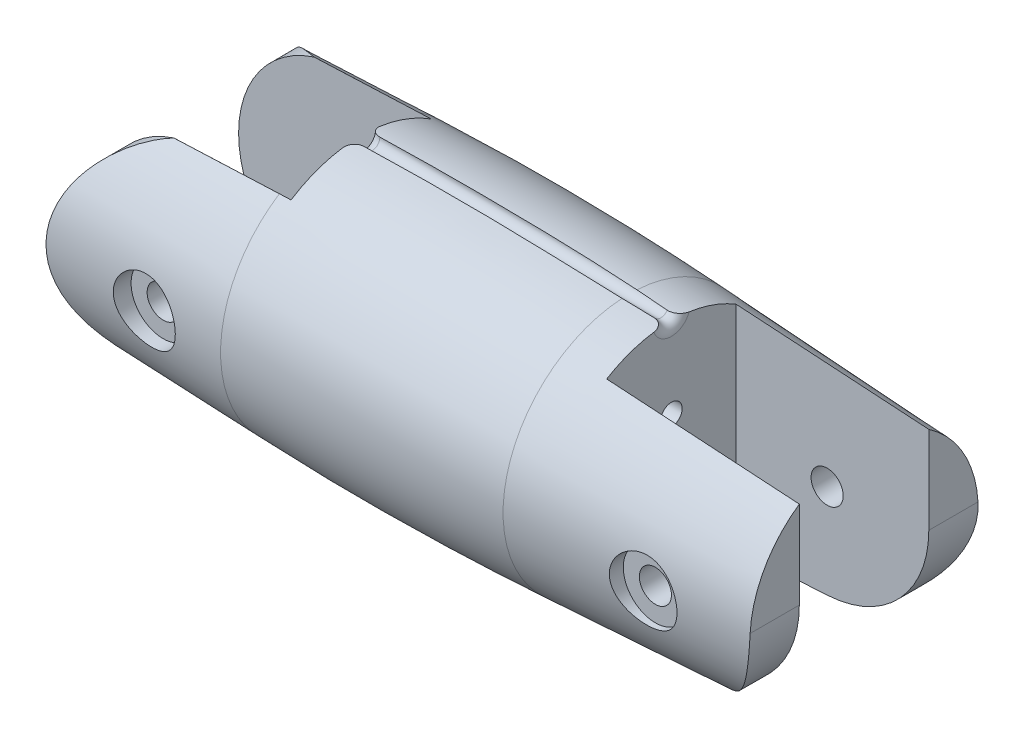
ISO-10303-21;
HEADER;
FILE_DESCRIPTION(('STEP AP214'),'2;1');
FILE_NAME('part.step','',(''),(''),'','','');
FILE_SCHEMA(('AUTOMOTIVE_DESIGN { 1 0 10303 214 1 1 1 1 }'));
ENDSEC;
DATA;
#1=APPLICATION_CONTEXT('core data for automotive mechanical design processes');
#2=APPLICATION_PROTOCOL_DEFINITION('international standard','automotive_design',2000,#1);
#3=PRODUCT_CONTEXT('',#1,'mechanical');
#4=PRODUCT('Part','Part','',(#3));
#5=PRODUCT_RELATED_PRODUCT_CATEGORY('part','',(#4));
#6=PRODUCT_DEFINITION_FORMATION('','',#4);
#7=PRODUCT_DEFINITION_CONTEXT('part definition',#1,'design');
#8=PRODUCT_DEFINITION('design','',#6,#7);
#9=PRODUCT_DEFINITION_SHAPE('','',#8);
#10=(LENGTH_UNIT() NAMED_UNIT(*) SI_UNIT(.MILLI.,.METRE.));
#11=(NAMED_UNIT(*) PLANE_ANGLE_UNIT() SI_UNIT($,.RADIAN.));
#12=(NAMED_UNIT(*) SI_UNIT($,.STERADIAN.) SOLID_ANGLE_UNIT());
#13=UNCERTAINTY_MEASURE_WITH_UNIT(LENGTH_MEASURE(1.E-05),#10,'distance_accuracy_value','');
#14=(GEOMETRIC_REPRESENTATION_CONTEXT(3) GLOBAL_UNCERTAINTY_ASSIGNED_CONTEXT((#13)) GLOBAL_UNIT_ASSIGNED_CONTEXT((#10,
#11,#12)) REPRESENTATION_CONTEXT('',''));
#15=CARTESIAN_POINT('',(0.,0.,0.));
#16=DIRECTION('',(0.,0.,1.));
#17=DIRECTION('',(1.,0.,0.));
#18=AXIS2_PLACEMENT_3D('',#15,#16,#17);
#19=CARTESIAN_POINT('',(35.,4.,0.));
#20=DIRECTION('',(-1.,0.,0.));
#21=DIRECTION('',(0.,0.,1.));
#22=AXIS2_PLACEMENT_3D('',#19,#20,#21);
#23=CYLINDRICAL_SURFACE('',#22,1.);
#24=CARTESIAN_POINT('',(17.,4.,0.));
#25=DIRECTION('',(-1.,0.,0.));
#26=DIRECTION('',(0.,0.,1.));
#27=AXIS2_PLACEMENT_3D('',#24,#25,#26);
#28=CIRCLE('',#27,1.);
#29=CARTESIAN_POINT('',(17.,4.,0.999999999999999));
#30=VERTEX_POINT('',#29);
#31=EDGE_CURVE('E627',#30,#30,#28,.F.);
#32=ORIENTED_EDGE('',*,*,#31,.T.);
#33=EDGE_LOOP('',(#32));
#34=FACE_BOUND('',#33,.T.);
#35=CARTESIAN_POINT('',(8.,4.,0.));
#36=DIRECTION('',(-1.,0.,0.));
#37=DIRECTION('',(0.,0.,1.));
#38=AXIS2_PLACEMENT_3D('',#35,#36,#37);
#39=CIRCLE('',#38,1.);
#40=CARTESIAN_POINT('',(8.,4.,0.999999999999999));
#41=VERTEX_POINT('',#40);
#42=EDGE_CURVE('E350',#41,#41,#39,.T.);
#43=ORIENTED_EDGE('',*,*,#42,.T.);
#44=EDGE_LOOP('',(#43));
#45=FACE_BOUND('',#44,.T.);
#46=ADVANCED_FACE('F35',(#34,#45),#23,.F.);
#47=CARTESIAN_POINT('',(35.,-4.,0.));
#48=DIRECTION('',(-1.,0.,0.));
#49=DIRECTION('',(0.,0.,1.));
#50=AXIS2_PLACEMENT_3D('',#47,#48,#49);
#51=CYLINDRICAL_SURFACE('',#50,1.);
#52=CARTESIAN_POINT('',(17.,-4.,0.));
#53=DIRECTION('',(-1.,0.,0.));
#54=DIRECTION('',(0.,0.,1.));
#55=AXIS2_PLACEMENT_3D('',#52,#53,#54);
#56=CIRCLE('',#55,1.);
#57=CARTESIAN_POINT('',(17.,-4.,0.999999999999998));
#58=VERTEX_POINT('',#57);
#59=EDGE_CURVE('E722',#58,#58,#56,.F.);
#60=ORIENTED_EDGE('',*,*,#59,.T.);
#61=EDGE_LOOP('',(#60));
#62=FACE_BOUND('',#61,.T.);
#63=CARTESIAN_POINT('',(8.,-4.,0.));
#64=DIRECTION('',(-1.,0.,0.));
#65=DIRECTION('',(0.,0.,1.));
#66=AXIS2_PLACEMENT_3D('',#63,#64,#65);
#67=CIRCLE('',#66,1.);
#68=CARTESIAN_POINT('',(8.,-4.,0.999999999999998));
#69=VERTEX_POINT('',#68);
#70=EDGE_CURVE('E40',#69,#69,#67,.T.);
#71=ORIENTED_EDGE('',*,*,#70,.T.);
#72=EDGE_LOOP('',(#71));
#73=FACE_BOUND('',#72,.T.);
#74=ADVANCED_FACE('F729',(#62,#73),#51,.F.);
#75=CARTESIAN_POINT('',(0.,0.,0.));
#76=DIRECTION('',(-1.,0.,0.));
#77=DIRECTION('',(0.,0.,-1.));
#78=AXIS2_PLACEMENT_3D('',#75,#76,#77);
#79=CONICAL_SURFACE('',#78,12.5,0.05235987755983);
#80=CARTESIAN_POINT('',(23.3836229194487,-2.73186884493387,10.9385378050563));
#81=CARTESIAN_POINT('',(23.5032969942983,-2.85098334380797,10.9023250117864));
#82=CARTESIAN_POINT('',(23.633048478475,-2.95999410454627,10.865965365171));
#83=CARTESIAN_POINT('',(23.909566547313,-3.15496132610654,10.7958734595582));
#84=CARTESIAN_POINT('',(24.0563403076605,-3.24090801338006,10.7621423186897));
#85=CARTESIAN_POINT('',(24.3635651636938,-3.38725375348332,10.7000988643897));
#86=CARTESIAN_POINT('',(24.5240404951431,-3.44760636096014,10.6717964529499));
#87=CARTESIAN_POINT('',(24.8540342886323,-3.54024883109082,10.6231983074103));
#88=CARTESIAN_POINT('',(25.0235486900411,-3.57255118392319,10.6028990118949));
#89=CARTESIAN_POINT('',(25.3599404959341,-3.60692804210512,10.5726271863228));
#90=CARTESIAN_POINT('',(25.5266717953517,-3.61010870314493,10.5622902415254));
#91=CARTESIAN_POINT('',(25.8586581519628,-3.58873871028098,10.5511946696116));
#92=CARTESIAN_POINT('',(26.0239134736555,-3.56419312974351,10.5504342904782));
#93=CARTESIAN_POINT('',(26.3417064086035,-3.48956723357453,10.5578039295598));
#94=CARTESIAN_POINT('',(26.4944886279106,-3.44048721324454,10.5655989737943));
#95=CARTESIAN_POINT('',(26.7898494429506,-3.31888103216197,10.5882040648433));
#96=CARTESIAN_POINT('',(26.9324269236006,-3.24635231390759,10.6030148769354));
#97=CARTESIAN_POINT('',(27.2065981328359,-3.07824916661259,10.6380872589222));
#98=CARTESIAN_POINT('',(27.3379072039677,-2.98223329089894,10.6584542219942));
#99=CARTESIAN_POINT('',(27.5830673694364,-2.77058121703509,10.7021483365));
#100=CARTESIAN_POINT('',(27.6969143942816,-2.65494045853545,10.7254761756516));
#101=CARTESIAN_POINT('',(27.9088705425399,-2.40165269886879,10.7736988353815));
#102=CARTESIAN_POINT('',(28.0061108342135,-2.26328203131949,10.7986182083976));
#103=CARTESIAN_POINT('',(28.1761230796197,-1.9719308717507,10.8465446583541));
#104=CARTESIAN_POINT('',(28.2488937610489,-1.81894962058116,10.8695516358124));
#105=CARTESIAN_POINT('',(28.368267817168,-1.50119288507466,10.9116747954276));
#106=CARTESIAN_POINT('',(28.4146651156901,-1.33633556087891,10.9307596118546));
#107=CARTESIAN_POINT('',(28.478789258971,-1.00059570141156,10.9632136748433));
#108=CARTESIAN_POINT('',(28.4965212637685,-0.829714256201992,10.9765839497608));
#109=CARTESIAN_POINT('',(28.5024745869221,-0.491370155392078,10.9965478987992));
#110=CARTESIAN_POINT('',(28.4914278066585,-0.323929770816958,11.0033037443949));
#111=CARTESIAN_POINT('',(28.4415655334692,0.0068942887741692,11.0106817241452));
#112=CARTESIAN_POINT('',(28.4027519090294,0.170278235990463,11.01130427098));
#113=CARTESIAN_POINT('',(28.2991817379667,0.486095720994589,11.0072923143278));
#114=CARTESIAN_POINT('',(28.2347784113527,0.63864631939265,11.0027278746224));
#115=CARTESIAN_POINT('',(28.0818755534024,0.930981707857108,10.9898998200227));
#116=CARTESIAN_POINT('',(27.9933738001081,1.07076531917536,10.9816358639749));
#117=CARTESIAN_POINT('',(27.793341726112,1.33564680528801,10.963160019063));
#118=CARTESIAN_POINT('',(27.6815121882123,1.46051694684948,10.9529229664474));
#119=CARTESIAN_POINT('',(27.4386301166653,1.68994964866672,10.932759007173));
#120=CARTESIAN_POINT('',(27.3075761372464,1.79451068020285,10.9228321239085));
#121=CARTESIAN_POINT('',(27.0282167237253,1.98148849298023,10.9053572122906));
#122=CARTESIAN_POINT('',(26.8797346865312,2.06364443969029,10.8978370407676));
#123=CARTESIAN_POINT('',(26.5709264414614,2.20182366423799,10.8872760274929));
#124=CARTESIAN_POINT('',(26.4106016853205,2.25785013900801,10.8842346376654));
#125=CARTESIAN_POINT('',(26.0849333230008,2.34154286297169,10.8839950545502));
#126=CARTESIAN_POINT('',(25.9196823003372,2.36956903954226,10.8867212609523));
#127=CARTESIAN_POINT('',(25.5870483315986,2.39776121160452,10.8983975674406));
#128=CARTESIAN_POINT('',(25.4196655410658,2.39792922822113,10.9073472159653));
#129=CARTESIAN_POINT('',(25.0895570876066,2.37073205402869,10.9309922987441));
#130=CARTESIAN_POINT('',(24.9267999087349,2.34368680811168,10.9456197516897));
#131=CARTESIAN_POINT('',(24.6083495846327,2.26351706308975,10.9795181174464));
#132=CARTESIAN_POINT('',(24.4526572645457,2.21038952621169,10.9987895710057));
#133=CARTESIAN_POINT('',(24.1497620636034,2.07852382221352,11.0406279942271));
#134=CARTESIAN_POINT('',(24.0027514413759,1.99936055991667,11.0632459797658));
#135=CARTESIAN_POINT('',(23.7239316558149,1.81786463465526,11.1093174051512));
#136=CARTESIAN_POINT('',(23.5921250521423,1.71552807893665,11.1327709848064));
#137=CARTESIAN_POINT('',(23.3443919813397,1.48777348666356,11.1786103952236));
#138=CARTESIAN_POINT('',(23.2288824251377,1.36189397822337,11.2009610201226));
#139=CARTESIAN_POINT('',(23.0206102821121,1.09193469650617,11.2414548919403));
#140=CARTESIAN_POINT('',(22.9278458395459,0.947856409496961,11.2595984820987));
#141=CARTESIAN_POINT('',(22.7690036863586,0.647438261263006,11.2891691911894));
#142=CARTESIAN_POINT('',(22.7025938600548,0.491282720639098,11.3006807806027));
#143=CARTESIAN_POINT('',(22.5969761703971,0.169674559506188,11.31561323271));
#144=CARTESIAN_POINT('',(22.5577602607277,0.00422470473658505,11.3190364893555));
#145=CARTESIAN_POINT('',(22.5087392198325,-0.324609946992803,11.3168619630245));
#146=CARTESIAN_POINT('',(22.4978946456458,-0.487842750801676,11.3115949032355));
#147=CARTESIAN_POINT('',(22.5027806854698,-0.813410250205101,11.2925960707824));
#148=CARTESIAN_POINT('',(22.518511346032,-0.975744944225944,11.2788642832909));
#149=CARTESIAN_POINT('',(22.575479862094,-1.29334595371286,11.2438465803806));
#150=CARTESIAN_POINT('',(22.6164688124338,-1.44866555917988,11.2226352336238));
#151=CARTESIAN_POINT('',(22.7222171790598,-1.74990876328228,11.1740158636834));
#152=CARTESIAN_POINT('',(22.786973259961,-1.89583367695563,11.1466087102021));
#153=CARTESIAN_POINT('',(22.9321823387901,-2.16370487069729,11.0898322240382));
#154=CARTESIAN_POINT('',(23.0109615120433,-2.2866356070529,11.0607961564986));
#155=CARTESIAN_POINT('',(23.1852144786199,-2.51949352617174,11.0007224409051));
#156=CARTESIAN_POINT('',(23.2806912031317,-2.62941842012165,10.969684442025));
#157=CARTESIAN_POINT('',(23.3836229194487,-2.73186884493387,10.9385378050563));
#158=B_SPLINE_CURVE_WITH_KNOTS('',3,(#80,#81,#82,#83,#84,#85,#86,#87,#88,#89,#90,#91,#92,#93,
#94,#95,#96,#97,#98,#99,#100,#101,#102,#103,#104,#105,#106,#107,#108,#109,#110,#111,#112,#113,
#114,#115,#116,#117,#118,#119,#120,#121,#122,#123,#124,#125,#126,#127,#128,#129,#130,#131,#132,
#133,#134,#135,#136,#137,#138,#139,#140,#141,#142,#143,#144,#145,#146,#147,#148,#149,#150,#151,
#152,#153,#154,#155,#156,#157),.UNSPECIFIED.,.T.,.F.,(4,2,2,2,2,2,2,2,2,2,2,2,2,2,2,2,2,2,2,2,2,
2,2,2,2,2,2,2,2,2,2,2,2,2,2,2,2,2,4),(0.,0.517556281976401,1.03533153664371,1.55404241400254,
2.07252220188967,2.57122241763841,3.06983139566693,3.54959276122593,4.02940647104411,
4.51904416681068,5.00879579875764,5.5192525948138,6.02973592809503,6.54415509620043,
7.05848165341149,7.55985630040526,8.06119721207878,8.55584588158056,9.05054017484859,
9.55201986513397,10.0535372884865,10.560665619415,11.0677318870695,11.5681928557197,
12.068617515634,12.563226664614,13.0578934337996,13.5610749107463,14.0643409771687,
14.5787659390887,15.0931489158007,15.6008265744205,16.1083539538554,16.5970083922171,
17.0856636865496,17.5695789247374,18.0534262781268,18.4984984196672,18.943648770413),.UNSPECIFIED.);
#159=CARTESIAN_POINT('',(23.3836229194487,-2.73186884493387,10.9385378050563));
#160=VERTEX_POINT('',#159);
#161=EDGE_CURVE('E707',#160,#160,#158,.T.);
#162=ORIENTED_EDGE('',*,*,#161,.F.);
#163=EDGE_LOOP('',(#162));
#164=FACE_BOUND('',#163,.T.);
#165=CARTESIAN_POINT('',(13.0801321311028,-11.7941102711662,0.69379906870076));
#166=CARTESIAN_POINT('',(13.3298579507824,-11.7813092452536,0.688541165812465));
#167=CARTESIAN_POINT('',(13.579576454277,-11.7685298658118,0.682882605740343));
#168=CARTESIAN_POINT('',(14.0787808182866,-11.743025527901,0.67070410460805));
#169=CARTESIAN_POINT('',(14.3282666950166,-11.73030053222,0.664184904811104));
#170=CARTESIAN_POINT('',(15.0764204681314,-11.6922047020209,0.643239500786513));
#171=CARTESIAN_POINT('',(15.5750535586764,-11.6668992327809,0.627419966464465));
#172=CARTESIAN_POINT('',(16.5722556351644,-11.616461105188,0.591236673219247));
#173=CARTESIAN_POINT('',(17.0708245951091,-11.5913284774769,0.570872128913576));
#174=CARTESIAN_POINT('',(17.8191464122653,-11.5537331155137,0.535651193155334));
#175=CARTESIAN_POINT('',(18.069004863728,-11.5412016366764,0.523111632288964));
#176=CARTESIAN_POINT('',(18.5686285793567,-11.5161859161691,0.496104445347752));
#177=CARTESIAN_POINT('',(18.8183938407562,-11.5037016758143,0.481636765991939));
#178=CARTESIAN_POINT('',(19.3176410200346,-11.4787898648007,0.450210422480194));
#179=CARTESIAN_POINT('',(19.5671230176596,-11.4663622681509,0.433253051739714));
#180=CARTESIAN_POINT('',(20.0658265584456,-11.4415624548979,0.395891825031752));
#181=CARTESIAN_POINT('',(20.3150481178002,-11.4291902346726,0.375488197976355));
#182=CARTESIAN_POINT('',(20.6887894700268,-11.410668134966,0.340656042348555));
#183=CARTESIAN_POINT('',(20.8135025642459,-11.4044928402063,0.328323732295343));
#184=CARTESIAN_POINT('',(21.0628385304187,-11.3921573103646,0.301685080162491));
#185=CARTESIAN_POINT('',(21.1874612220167,-11.3859970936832,0.287376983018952));
#186=CARTESIAN_POINT('',(21.3738068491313,-11.3767937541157,0.263673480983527));
#187=CARTESIAN_POINT('',(21.4356744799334,-11.3737395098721,0.255421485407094));
#188=CARTESIAN_POINT('',(21.5592888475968,-11.3676395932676,0.237911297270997));
#189=CARTESIAN_POINT('',(21.6210355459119,-11.364593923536,0.228652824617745));
#190=CARTESIAN_POINT('',(21.744207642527,-11.3585210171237,0.208724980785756));
#191=CARTESIAN_POINT('',(21.8056333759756,-11.35549376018,0.198057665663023));
#192=CARTESIAN_POINT('',(21.9280702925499,-11.3494622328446,0.174581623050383));
#193=CARTESIAN_POINT('',(21.9890817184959,-11.3464579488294,0.161774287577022));
#194=CARTESIAN_POINT('',(22.07987782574,-11.3419888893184,0.1393528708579));
#195=CARTESIAN_POINT('',(22.1100580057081,-11.3405037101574,0.131332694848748));
#196=CARTESIAN_POINT('',(22.1700645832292,-11.3375513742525,0.113542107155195));
#197=CARTESIAN_POINT('',(22.1998895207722,-11.3360842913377,0.103766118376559));
#198=CARTESIAN_POINT('',(22.2436444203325,-11.3339324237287,0.0863538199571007));
#199=CARTESIAN_POINT('',(22.2581144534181,-11.3332208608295,0.0800648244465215));
#200=CARTESIAN_POINT('',(22.2862883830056,-11.3318355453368,0.0659547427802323));
#201=CARTESIAN_POINT('',(22.2999968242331,-11.3311615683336,0.058144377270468));
#202=CARTESIAN_POINT('',(22.3160231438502,-11.330373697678,0.0459990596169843));
#203=CARTESIAN_POINT('',(22.3194601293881,-11.3302047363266,0.0431879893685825));
#204=CARTESIAN_POINT('',(22.3260046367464,-11.3298830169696,0.0371980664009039));
#205=CARTESIAN_POINT('',(22.329112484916,-11.3297302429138,0.0340195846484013));
#206=CARTESIAN_POINT('',(22.3338343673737,-11.3294981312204,0.0283349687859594));
#207=CARTESIAN_POINT('',(22.3356011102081,-11.3294112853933,0.0259576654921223));
#208=CARTESIAN_POINT('',(22.3387756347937,-11.3292552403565,0.0209714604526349));
#209=CARTESIAN_POINT('',(22.3401840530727,-11.3291860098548,0.0183629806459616));
#210=CARTESIAN_POINT('',(22.3422099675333,-11.3290864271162,0.0135892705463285));
#211=CARTESIAN_POINT('',(22.34293659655,-11.3290507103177,0.0114711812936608));
#212=CARTESIAN_POINT('',(22.3440286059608,-11.3289970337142,0.00714396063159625));
#213=CARTESIAN_POINT('',(22.3443945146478,-11.3289790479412,0.00493496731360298));
#214=CARTESIAN_POINT('',(22.344722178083,-11.3289629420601,0.00047563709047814));
#215=CARTESIAN_POINT('',(22.3446820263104,-11.3289649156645,-0.00177484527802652));
#216=CARTESIAN_POINT('',(22.344198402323,-11.3289886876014,-0.00623228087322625));
#217=CARTESIAN_POINT('',(22.3437545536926,-11.3290105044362,-0.00843919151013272));
#218=CARTESIAN_POINT('',(22.342382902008,-11.3290779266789,-0.01321238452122));
#219=CARTESIAN_POINT('',(22.341371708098,-11.329127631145,-0.0157542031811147));
#220=CARTESIAN_POINT('',(22.3389584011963,-11.329246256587,-0.0206432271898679));
#221=CARTESIAN_POINT('',(22.3375554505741,-11.3293152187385,-0.0229900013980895));
#222=CARTESIAN_POINT('',(22.3333546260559,-11.3295217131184,-0.0291257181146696));
#223=CARTESIAN_POINT('',(22.3302836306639,-11.329672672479,-0.0327243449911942));
#224=CARTESIAN_POINT('',(22.3236768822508,-11.3299974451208,-0.0394603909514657));
#225=CARTESIAN_POINT('',(22.3201396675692,-11.330171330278,-0.0425962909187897));
#226=CARTESIAN_POINT('',(22.3048491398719,-11.3309230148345,-0.0549814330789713));
#227=CARTESIAN_POINT('',(22.2919225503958,-11.3315585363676,-0.0627307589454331));
#228=CARTESIAN_POINT('',(22.2652791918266,-11.332868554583,-0.0767050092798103));
#229=CARTESIAN_POINT('',(22.2515573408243,-11.3335433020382,-0.0829183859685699));
#230=CARTESIAN_POINT('',(22.2055810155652,-11.3358043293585,-0.10196314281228));
#231=CARTESIAN_POINT('',(22.1725178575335,-11.3374306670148,-0.112845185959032));
#232=CARTESIAN_POINT('',(22.105780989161,-11.3407141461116,-0.132571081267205));
#233=CARTESIAN_POINT('',(22.0721058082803,-11.342371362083,-0.141409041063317));
#234=CARTESIAN_POINT('',(22.0044433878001,-11.3457019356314,-0.157781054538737));
#235=CARTESIAN_POINT('',(21.9704562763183,-11.3473752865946,-0.165315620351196));
#236=CARTESIAN_POINT('',(21.9023571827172,-11.3507289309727,-0.179506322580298));
#237=CARTESIAN_POINT('',(21.8682454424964,-11.3524092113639,-0.186163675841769));
#238=CARTESIAN_POINT('',(21.7662910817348,-11.3574324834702,-0.205087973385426));
#239=CARTESIAN_POINT('',(21.6982771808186,-11.3607850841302,-0.216430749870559));
#240=CARTESIAN_POINT('',(21.5620092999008,-11.3675052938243,-0.237578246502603));
#241=CARTESIAN_POINT('',(21.4937552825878,-11.3708729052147,-0.247382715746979));
#242=CARTESIAN_POINT('',(21.2886496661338,-11.3809974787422,-0.275201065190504));
#243=CARTESIAN_POINT('',(21.1515805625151,-11.3877699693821,-0.291598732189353));
#244=CARTESIAN_POINT('',(20.8773434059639,-11.4013326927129,-0.32183881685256));
#245=CARTESIAN_POINT('',(20.7401756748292,-11.4081228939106,-0.335684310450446));
#246=CARTESIAN_POINT('',(20.4657367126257,-11.4217212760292,-0.36158328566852));
#247=CARTESIAN_POINT('',(20.328465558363,-11.4285294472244,-0.373637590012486));
#248=CARTESIAN_POINT('',(19.9003855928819,-11.4497807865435,-0.409175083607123));
#249=CARTESIAN_POINT('',(19.609391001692,-11.4642555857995,-0.430379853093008));
#250=CARTESIAN_POINT('',(19.0271548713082,-11.4932753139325,-0.46908478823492));
#251=CARTESIAN_POINT('',(18.7359133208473,-11.5078202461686,-0.486584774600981));
#252=CARTESIAN_POINT('',(18.1531930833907,-11.5369798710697,-0.518868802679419));
#253=CARTESIAN_POINT('',(17.8617143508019,-11.5515945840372,-0.533651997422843));
#254=CARTESIAN_POINT('',(17.2786673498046,-11.58088648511,-0.56108537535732));
#255=CARTESIAN_POINT('',(16.9870990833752,-11.5955636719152,-0.573735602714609));
#256=CARTESIAN_POINT('',(16.1122035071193,-11.6396918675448,-0.609071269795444));
#257=CARTESIAN_POINT('',(15.5287749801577,-11.6692350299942,-0.629137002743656));
#258=CARTESIAN_POINT('',(14.3618389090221,-11.7285576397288,-0.663994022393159));
#259=CARTESIAN_POINT('',(13.7783313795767,-11.7583370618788,-0.678785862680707));
#260=CARTESIAN_POINT('',(13.1565671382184,-11.7901926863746,-0.69218085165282));
#261=CARTESIAN_POINT('',(13.1183497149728,-11.7921512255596,-0.692994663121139));
#262=CARTESIAN_POINT('',(13.0801321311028,-11.7941102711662,-0.693799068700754));
#263=B_SPLINE_CURVE_WITH_KNOTS('',3,(#165,#166,#167,#168,#169,#170,#171,#172,#173,#174,#175,
#176,#177,#178,#179,#180,#181,#182,#183,#184,#185,#186,#187,#188,#189,#190,#191,#192,#193,#194,
#195,#196,#197,#198,#199,#200,#201,#202,#203,#204,#205,#206,#207,#208,#209,#210,#211,#212,#213,
#214,#215,#216,#217,#218,#219,#220,#221,#222,#223,#224,#225,#226,#227,#228,#229,#230,#231,#232,
#233,#234,#235,#236,#237,#238,#239,#240,#241,#242,#243,#244,#245,#246,#247,#248,#249,#250,#251,
#252,#253,#254,#255,#256,#257,#258,#259,#260,#261,#262),.UNSPECIFIED.,.F.,.F.,(4,2,2,2,2,2,2,2,
2,2,2,2,2,2,2,2,2,2,2,2,2,2,2,2,2,2,2,2,2,2,2,2,2,2,2,2,2,2,2,2,2,2,2,2,2,2,2,2,4),(0.,
0.750326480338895,1.50001087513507,2.99857130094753,4.49739088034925,5.24884534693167,
6.000320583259,6.7514067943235,7.5024431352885,7.87885493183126,8.25560326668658,
8.44306926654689,8.63058757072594,8.81783517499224,9.00496145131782,9.09874490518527,
9.19283169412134,9.2402073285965,9.28726046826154,9.30057327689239,9.31387275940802,
9.32274108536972,9.33159354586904,9.33828605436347,9.34496874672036,9.35168282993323,
9.35840317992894,9.36656514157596,9.37474469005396,9.38886426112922,9.4030292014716,
9.44793060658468,9.49315997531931,9.59743390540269,9.70200477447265,9.80653446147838,
9.91091758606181,10.1179855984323,10.3250873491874,10.7396745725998,11.1537588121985,
11.5676522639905,12.4439837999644,13.320357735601,14.1970044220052,15.0736329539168,
16.8271593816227,18.5805016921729,18.6953303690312),.UNSPECIFIED.);
#264=CARTESIAN_POINT('',(13.0803321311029,-11.7941000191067,0.693794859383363));
#265=VERTEX_POINT('',#264);
#266=CARTESIAN_POINT('',(16.,-11.6454062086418,0.611985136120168));
#267=VERTEX_POINT('',#266);
#268=EDGE_CURVE('E361',#265,#267,#263,.T.);
#269=ORIENTED_EDGE('',*,*,#268,.T.);
#270=CARTESIAN_POINT('',(16.,-11.6454062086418,0.611985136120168));
#271=CARTESIAN_POINT('',(16.0244082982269,-11.6441710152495,0.611105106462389));
#272=CARTESIAN_POINT('',(16.0488415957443,-11.6428797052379,0.611285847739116));
#273=CARTESIAN_POINT('',(16.0975845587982,-11.6401914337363,0.613764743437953));
#274=CARTESIAN_POINT('',(16.1218942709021,-11.6387945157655,0.616062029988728));
#275=CARTESIAN_POINT('',(16.1940912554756,-11.634472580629,0.6260788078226));
#276=CARTESIAN_POINT('',(16.2415702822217,-11.6314000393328,0.636911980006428));
#277=CARTESIAN_POINT('',(16.3339711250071,-11.6249097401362,0.666176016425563));
#278=CARTESIAN_POINT('',(16.3788962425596,-11.6214924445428,0.684596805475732));
#279=CARTESIAN_POINT('',(16.4654584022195,-11.6143062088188,0.728042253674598));
#280=CARTESIAN_POINT('',(16.5070901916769,-11.6105367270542,0.753077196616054));
#281=CARTESIAN_POINT('',(16.5902966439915,-11.6022318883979,0.811548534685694));
#282=CARTESIAN_POINT('',(16.6314531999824,-11.59765764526,0.845573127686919));
#283=CARTESIAN_POINT('',(16.7082179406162,-11.5880093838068,0.919320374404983));
#284=CARTESIAN_POINT('',(16.7438246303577,-11.5829352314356,0.959044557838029));
#285=CARTESIAN_POINT('',(16.8128280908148,-11.5715772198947,1.04841020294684));
#286=CARTESIAN_POINT('',(16.8454155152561,-11.5652213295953,1.09867048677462));
#287=CARTESIAN_POINT('',(16.9018470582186,-11.5517802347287,1.20378423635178));
#288=CARTESIAN_POINT('',(16.9256923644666,-11.5446951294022,1.2586370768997));
#289=CARTESIAN_POINT('',(16.962899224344,-11.5301867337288,1.36868361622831));
#290=CARTESIAN_POINT('',(16.9767214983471,-11.5227975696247,1.42372589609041));
#291=CARTESIAN_POINT('',(16.995297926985,-11.5074867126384,1.53531426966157));
#292=CARTESIAN_POINT('',(17.0000406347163,-11.4995643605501,1.59186217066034));
#293=CARTESIAN_POINT('',(17.,-11.4914378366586,1.64842668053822));
#294=B_SPLINE_CURVE_WITH_KNOTS('',3,(#270,#271,#272,#273,#274,#275,#276,#277,#278,#279,#280,
#281,#282,#283,#284,#285,#286,#287,#288,#289,#290,#291,#292,#293),.UNSPECIFIED.,.F.,.F.,(4,2,2,
2,2,2,2,2,2,2,2,4),(0.,0.0733223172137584,0.146614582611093,0.29223889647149,0.437670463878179,
0.583329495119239,0.743486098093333,0.903685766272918,1.08357293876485,1.26343566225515,
1.43439071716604,1.60556115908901),.UNSPECIFIED.);
#295=CARTESIAN_POINT('',(17.,-11.4914378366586,1.64842668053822));
#296=VERTEX_POINT('',#295);
#297=EDGE_CURVE('E528',#267,#296,#294,.T.);
#298=ORIENTED_EDGE('',*,*,#297,.T.);
#299=CARTESIAN_POINT('',(17.,0.,0.));
#300=DIRECTION('',(-1.,0.,0.));
#301=DIRECTION('',(0.,0.,1.));
#302=AXIS2_PLACEMENT_3D('',#299,#300,#301);
#303=CIRCLE('',#302,11.6090677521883);
#304=CARTESIAN_POINT('',(17.,-9.90797426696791,6.05));
#305=VERTEX_POINT('',#304);
#306=EDGE_CURVE('E595',#296,#305,#303,.T.);
#307=ORIENTED_EDGE('',*,*,#306,.T.);
#308=CARTESIAN_POINT('',(26.0000000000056,-9.3458901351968,0.));
#309=DIRECTION('',(-0.0623323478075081,0.998055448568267,0.));
#310=DIRECTION('',(-0.998055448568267,-0.0623323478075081,0.));
#311=AXIS2_PLACEMENT_3D('',#308,#309,#310);
#312=ELLIPSE('',#311,178.677655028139,6.057719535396);
#313=CARTESIAN_POINT('',(25.6233234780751,-9.36941501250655,6.05770602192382));
#314=VERTEX_POINT('',#313);
#315=EDGE_CURVE('E776',#305,#314,#312,.T.);
#316=ORIENTED_EDGE('',*,*,#315,.T.);
#317=CARTESIAN_POINT('',(25.6231234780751,-9.36942750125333,6.05770601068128));
#318=CARTESIAN_POINT('',(25.8031203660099,-9.35823356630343,6.05757431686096));
#319=CARTESIAN_POINT('',(25.9827020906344,-9.34209174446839,6.0652692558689));
#320=CARTESIAN_POINT('',(26.3391777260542,-9.30039397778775,6.09503567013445));
#321=CARTESIAN_POINT('',(26.5160767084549,-9.27485896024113,6.11707526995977));
#322=CARTESIAN_POINT('',(26.863555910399,-9.21524621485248,6.17384268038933));
#323=CARTESIAN_POINT('',(27.0341908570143,-9.18130014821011,6.20837840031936));
#324=CARTESIAN_POINT('',(27.3710804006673,-9.105228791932,6.28840388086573));
#325=CARTESIAN_POINT('',(27.5373321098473,-9.06309825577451,6.33390067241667));
#326=CARTESIAN_POINT('',(27.9358016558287,-8.95131261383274,6.4556494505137));
#327=CARTESIAN_POINT('',(28.1654288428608,-8.87763650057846,6.53669010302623));
#328=CARTESIAN_POINT('',(28.6141797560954,-8.71595305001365,6.7122984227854));
#329=CARTESIAN_POINT('',(28.8332990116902,-8.62793968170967,6.80687178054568));
#330=CARTESIAN_POINT('',(29.2630512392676,-8.43773140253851,7.00609455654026));
#331=CARTESIAN_POINT('',(29.4735981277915,-8.3354242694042,7.11082147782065));
#332=CARTESIAN_POINT('',(29.8846318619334,-8.11780332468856,7.32617727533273));
#333=CARTESIAN_POINT('',(30.085119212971,-8.00249016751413,7.43680585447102));
#334=CARTESIAN_POINT('',(30.5439984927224,-7.71713777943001,7.69992967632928));
#335=CARTESIAN_POINT('',(30.7984795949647,-7.5419508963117,7.85369067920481));
#336=CARTESIAN_POINT('',(31.290212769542,-7.16886517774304,8.16140937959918));
#337=CARTESIAN_POINT('',(31.5274589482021,-6.97095863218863,8.31536712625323));
#338=CARTESIAN_POINT('',(31.9834086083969,-6.55316737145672,8.61843071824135));
#339=CARTESIAN_POINT('',(32.2021692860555,-6.33335540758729,8.76755057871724));
#340=CARTESIAN_POINT('',(32.620700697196,-5.87129848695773,9.05733124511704));
#341=CARTESIAN_POINT('',(32.8204792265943,-5.62906282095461,9.19799551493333));
#342=CARTESIAN_POINT('',(33.1516329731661,-5.18601401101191,9.43317859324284));
#343=CARTESIAN_POINT('',(33.2875935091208,-4.99005903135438,9.53041971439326));
#344=CARTESIAN_POINT('',(33.5467595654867,-4.58602099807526,9.71627291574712));
#345=CARTESIAN_POINT('',(33.6699681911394,-4.37794091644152,9.80488709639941));
#346=CARTESIAN_POINT('',(33.9025114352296,-3.95006598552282,9.97184402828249));
#347=CARTESIAN_POINT('',(34.0118402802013,-3.73026631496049,10.0501825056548));
#348=CARTESIAN_POINT('',(34.2152550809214,-3.27989026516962,10.1948492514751));
#349=CARTESIAN_POINT('',(34.3093415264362,-3.04931423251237,10.2611779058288));
#350=CARTESIAN_POINT('',(34.4818452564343,-2.57612951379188,10.3808215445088));
#351=CARTESIAN_POINT('',(34.5600858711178,-2.33341918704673,10.4339911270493));
#352=CARTESIAN_POINT('',(34.6983416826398,-1.83994530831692,10.5248635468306));
#353=CARTESIAN_POINT('',(34.7583532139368,-1.5891801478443,10.5625632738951));
#354=CARTESIAN_POINT('',(34.8588895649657,-1.08261155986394,10.6211266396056));
#355=CARTESIAN_POINT('',(34.8994710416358,-0.826825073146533,10.6420393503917));
#356=CARTESIAN_POINT('',(34.9606458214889,-0.312200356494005,10.6663258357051));
#357=CARTESIAN_POINT('',(34.9812578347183,-0.0533652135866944,10.6697160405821));
#358=CARTESIAN_POINT('',(34.9945193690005,0.27322133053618,10.6627307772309));
#359=CARTESIAN_POINT('',(34.9965774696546,0.340901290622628,10.6606733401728));
#360=CARTESIAN_POINT('',(34.9993173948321,0.476175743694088,10.6553430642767));
#361=CARTESIAN_POINT('',(35.0000005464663,0.543770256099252,10.6520714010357));
#362=CARTESIAN_POINT('',(34.999999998,0.611339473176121,10.6481928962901));
#363=B_SPLINE_CURVE_WITH_KNOTS('',3,(#317,#318,#319,#320,#321,#322,#323,#324,#325,#326,#327,
#328,#329,#330,#331,#332,#333,#334,#335,#336,#337,#338,#339,#340,#341,#342,#343,#344,#345,#346,
#347,#348,#349,#350,#351,#352,#353,#354,#355,#356,#357,#358,#359,#360,#361,#362),.UNSPECIFIED.,
.F.,.F.,(4,2,2,2,2,2,2,2,2,2,2,2,2,2,2,2,2,2,2,2,2,2,4),(0.,0.540636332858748,1.08007539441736,
1.61155188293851,2.14337019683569,2.90535409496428,3.66765935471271,4.43632643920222,
5.20495486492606,6.23899785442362,7.27339279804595,8.30446012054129,9.33510213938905,
10.1071285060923,10.8789664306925,11.6511243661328,12.423257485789,13.2035754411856,
13.9840502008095,14.7622350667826,15.5396901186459,15.7429023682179,15.9459183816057),.UNSPECIFIED.);
#364=CARTESIAN_POINT('',(35.,0.611139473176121,10.6482043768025));
#365=VERTEX_POINT('',#364);
#366=EDGE_CURVE('E761',#314,#365,#363,.T.);
#367=ORIENTED_EDGE('',*,*,#366,.T.);
#368=CARTESIAN_POINT('',(35.,0.,0.));
#369=DIRECTION('',(1.,0.,0.));
#370=DIRECTION('',(0.,0.,-1.));
#371=AXIS2_PLACEMENT_3D('',#368,#369,#370);
#372=CIRCLE('',#371,10.6657277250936);
#373=CARTESIAN_POINT('',(35.,8.78380600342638,6.05));
#374=VERTEX_POINT('',#373);
#375=EDGE_CURVE('E858',#374,#365,#372,.T.);
#376=ORIENTED_EDGE('',*,*,#375,.F.);
#377=CARTESIAN_POINT('',(-0.0578929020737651,10.9418170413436,6.05));
#378=CARTESIAN_POINT('',(3.53792488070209,10.7264454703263,6.05));
#379=CARTESIAN_POINT('',(7.13365867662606,10.5096553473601,6.05));
#380=CARTESIAN_POINT('',(14.3249325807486,10.0724937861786,6.05));
#381=CARTESIAN_POINT('',(17.9204726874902,9.85212232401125,6.05));
#382=CARTESIAN_POINT('',(23.3135826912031,9.51832310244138,6.05));
#383=CARTESIAN_POINT('',(25.1112529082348,9.40651634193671,6.05));
#384=CARTESIAN_POINT('',(28.7065163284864,9.1816939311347,6.05));
#385=CARTESIAN_POINT('',(30.5041095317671,9.0686782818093,6.05));
#386=CARTESIAN_POINT('',(34.0991996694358,8.8412986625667,6.05));
#387=CARTESIAN_POINT('',(35.8966966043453,8.72693470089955,6.05));
#388=CARTESIAN_POINT('',(39.4915983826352,8.49668908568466,6.05));
#389=CARTESIAN_POINT('',(41.2890032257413,8.38080742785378,6.05));
#390=CARTESIAN_POINT('',(45.5354204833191,8.1050008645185,6.05));
#391=CARTESIAN_POINT('',(47.9843852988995,7.94434185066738,6.05));
#392=CARTESIAN_POINT('',(52.8820614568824,7.61921955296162,6.05));
#393=CARTESIAN_POINT('',(55.3307727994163,7.45475627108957,6.05));
#394=CARTESIAN_POINT('',(60.2278527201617,7.12120542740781,6.05));
#395=CARTESIAN_POINT('',(62.6762213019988,6.9521179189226,6.05));
#396=CARTESIAN_POINT('',(67.5725633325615,6.60820931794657,6.05));
#397=CARTESIAN_POINT('',(70.0205367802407,6.43338821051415,6.05));
#398=CARTESIAN_POINT('',(74.9161051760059,6.07644452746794,6.05));
#399=CARTESIAN_POINT('',(77.3637000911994,5.89432149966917,6.04999999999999));
#400=CARTESIAN_POINT('',(82.2581494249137,5.52053856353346,6.04999999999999));
#401=CARTESIAN_POINT('',(84.7050038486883,5.32887872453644,6.04999999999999));
#402=CARTESIAN_POINT('',(88.3745461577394,5.0315242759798,6.04999999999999));
#403=CARTESIAN_POINT('',(89.597633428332,4.93075944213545,6.04999999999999));
#404=CARTESIAN_POINT('',(92.0434723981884,4.72526252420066,6.04999999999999));
#405=CARTESIAN_POINT('',(93.2662240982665,4.62053044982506,6.04999999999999));
#406=CARTESIAN_POINT('',(95.711335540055,4.40623027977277,6.04999999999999));
#407=CARTESIAN_POINT('',(96.933695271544,4.29666206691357,6.04999999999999));
#408=CARTESIAN_POINT('',(98.7668208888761,4.12776224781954,6.04999999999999));
#409=CARTESIAN_POINT('',(99.3777963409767,4.07070414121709,6.04999999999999));
#410=CARTESIAN_POINT('',(100.599584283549,3.9548577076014,6.04999999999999));
#411=CARTESIAN_POINT('',(101.210396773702,3.89606937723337,6.04999999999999));
#412=CARTESIAN_POINT('',(101.821114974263,3.83630878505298,6.04999999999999));
#413=B_SPLINE_CURVE_WITH_KNOTS('',3,(#377,#378,#379,#380,#381,#382,#383,#384,#385,#386,#387,
#388,#389,#390,#391,#392,#393,#394,#395,#396,#397,#398,#399,#400,#401,#402,#403,#404,#405,#406,
#407,#408,#409,#410,#411,#412),.UNSPECIFIED.,.F.,.F.,(4,2,2,2,2,2,2,2,2,2,2,2,2,2,2,2,2,4),(0.,
10.8067868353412,21.6136459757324,27.0170769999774,32.4205036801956,37.8238973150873,
43.2273062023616,50.5899906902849,57.952671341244,65.3152671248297,72.6778820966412,
80.0409537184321,87.4039718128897,91.0856598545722,94.7673388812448,98.4491071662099,
100.290006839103,102.130910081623),.UNSPECIFIED.);
#414=CARTESIAN_POINT('',(17.,9.90797426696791,6.05));
#415=VERTEX_POINT('',#414);
#416=EDGE_CURVE('E594',#374,#415,#413,.F.);
#417=ORIENTED_EDGE('',*,*,#416,.T.);
#418=CARTESIAN_POINT('',(17.,11.4914378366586,1.64842668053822));
#419=VERTEX_POINT('',#418);
#420=EDGE_CURVE('E585',#415,#419,#303,.T.);
#421=ORIENTED_EDGE('',*,*,#420,.T.);
#422=CARTESIAN_POINT('',(17.,11.4914378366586,1.64842668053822));
#423=CARTESIAN_POINT('',(17.0000001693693,11.495692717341,1.61877001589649));
#424=CARTESIAN_POINT('',(16.9987059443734,11.4998961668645,1.58912218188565));
#425=CARTESIAN_POINT('',(16.9935662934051,11.5081777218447,1.53003777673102));
#426=CARTESIAN_POINT('',(16.9897214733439,11.51225585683,1.50060115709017));
#427=CARTESIAN_POINT('',(16.9744486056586,11.5242464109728,1.41306099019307));
#428=CARTESIAN_POINT('',(16.9592816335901,11.5319419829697,1.35553844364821));
#429=CARTESIAN_POINT('',(16.91958184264,11.5466222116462,1.24379450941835));
#430=CARTESIAN_POINT('',(16.8950524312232,11.5536071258,1.18957192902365));
#431=CARTESIAN_POINT('',(16.8373998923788,11.5668595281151,1.08576200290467));
#432=CARTESIAN_POINT('',(16.8042712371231,11.5731265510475,1.03617766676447));
#433=CARTESIAN_POINT('',(16.7293067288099,11.5851397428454,0.941753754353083));
#434=CARTESIAN_POINT('',(16.6872581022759,11.5908670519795,0.897080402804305));
#435=CARTESIAN_POINT('',(16.5960194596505,11.6016818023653,0.815559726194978));
#436=CARTESIAN_POINT('',(16.5468268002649,11.6067690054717,0.778715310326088));
#437=CARTESIAN_POINT('',(16.4437273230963,11.6162534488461,0.715424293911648));
#438=CARTESIAN_POINT('',(16.3899663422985,11.6206645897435,0.688744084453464));
#439=CARTESIAN_POINT('',(16.2782593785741,11.6289535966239,0.64653744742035));
#440=CARTESIAN_POINT('',(16.2203273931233,11.6328331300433,0.630975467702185));
#441=CARTESIAN_POINT('',(16.1347962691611,11.6380418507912,0.617491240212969));
#442=CARTESIAN_POINT('',(16.1079321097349,11.6396056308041,0.614576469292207));
#443=CARTESIAN_POINT('',(16.0540362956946,11.6426044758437,0.611336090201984));
#444=CARTESIAN_POINT('',(16.0270046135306,11.6440395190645,0.611010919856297));
#445=CARTESIAN_POINT('',(16.,11.6454062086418,0.611985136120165));
#446=B_SPLINE_CURVE_WITH_KNOTS('',3,(#422,#423,#424,#425,#426,#427,#428,#429,#430,#431,#432,
#433,#434,#435,#436,#437,#438,#439,#440,#441,#442,#443,#444,#445),.UNSPECIFIED.,.F.,.F.,(4,2,2,
2,2,2,2,2,2,2,2,4),(0.,0.0898222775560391,0.17962322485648,0.358660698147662,0.537633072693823,
0.716720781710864,0.900691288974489,1.08473003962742,1.2642388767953,1.44317110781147,
1.52426383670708,1.60537027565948),.UNSPECIFIED.);
#447=CARTESIAN_POINT('',(16.,11.6454062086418,0.61198513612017));
#448=VERTEX_POINT('',#447);
#449=EDGE_CURVE('E523',#419,#448,#446,.T.);
#450=ORIENTED_EDGE('',*,*,#449,.T.);
#451=CARTESIAN_POINT('',(13.0801321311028,11.7941102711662,-0.693799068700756));
#452=CARTESIAN_POINT('',(13.3298579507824,11.7813092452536,-0.688541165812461));
#453=CARTESIAN_POINT('',(13.579576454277,11.7685298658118,-0.682882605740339));
#454=CARTESIAN_POINT('',(14.0787808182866,11.743025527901,-0.670704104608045));
#455=CARTESIAN_POINT('',(14.3282666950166,11.73030053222,-0.6641849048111));
#456=CARTESIAN_POINT('',(15.0764204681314,11.6922047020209,-0.643239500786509));
#457=CARTESIAN_POINT('',(15.5750535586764,11.6668992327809,-0.627419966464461));
#458=CARTESIAN_POINT('',(16.5722556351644,11.616461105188,-0.591236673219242));
#459=CARTESIAN_POINT('',(17.0708245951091,11.5913284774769,-0.57087212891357));
#460=CARTESIAN_POINT('',(17.8191464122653,11.5537331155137,-0.53565119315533));
#461=CARTESIAN_POINT('',(18.069004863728,11.5412016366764,-0.523111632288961));
#462=CARTESIAN_POINT('',(18.5686285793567,11.5161859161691,-0.49610444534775));
#463=CARTESIAN_POINT('',(18.8183938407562,11.5037016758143,-0.481636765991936));
#464=CARTESIAN_POINT('',(19.3176410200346,11.4787898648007,-0.450210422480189));
#465=CARTESIAN_POINT('',(19.5671230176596,11.4663622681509,-0.43325305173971));
#466=CARTESIAN_POINT('',(20.0658265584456,11.4415624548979,-0.395891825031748));
#467=CARTESIAN_POINT('',(20.3150481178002,11.4291902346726,-0.375488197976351));
#468=CARTESIAN_POINT('',(20.6887894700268,11.410668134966,-0.340656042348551));
#469=CARTESIAN_POINT('',(20.8135025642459,11.4044928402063,-0.328323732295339));
#470=CARTESIAN_POINT('',(21.0628385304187,11.3921573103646,-0.301685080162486));
#471=CARTESIAN_POINT('',(21.1874612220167,11.3859970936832,-0.287376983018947));
#472=CARTESIAN_POINT('',(21.3738068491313,11.3767937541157,-0.263673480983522));
#473=CARTESIAN_POINT('',(21.4356744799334,11.3737395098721,-0.25542148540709));
#474=CARTESIAN_POINT('',(21.5592888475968,11.3676395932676,-0.237911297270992));
#475=CARTESIAN_POINT('',(21.6210355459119,11.364593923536,-0.228652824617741));
#476=CARTESIAN_POINT('',(21.744207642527,11.3585210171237,-0.20872498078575));
#477=CARTESIAN_POINT('',(21.8056333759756,11.35549376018,-0.198057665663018));
#478=CARTESIAN_POINT('',(21.9280702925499,11.3494622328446,-0.174581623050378));
#479=CARTESIAN_POINT('',(21.9890817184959,11.3464579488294,-0.161774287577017));
#480=CARTESIAN_POINT('',(22.07987782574,11.3419888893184,-0.139352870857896));
#481=CARTESIAN_POINT('',(22.1100580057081,11.3405037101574,-0.131332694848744));
#482=CARTESIAN_POINT('',(22.1700645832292,11.3375513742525,-0.113542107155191));
#483=CARTESIAN_POINT('',(22.1998895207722,11.3360842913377,-0.103766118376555));
#484=CARTESIAN_POINT('',(22.2436444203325,11.3339324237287,-0.0863538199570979));
#485=CARTESIAN_POINT('',(22.2581144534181,11.3332208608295,-0.0800648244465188));
#486=CARTESIAN_POINT('',(22.2862883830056,11.3318355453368,-0.065954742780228));
#487=CARTESIAN_POINT('',(22.2999968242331,11.3311615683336,-0.0581443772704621));
#488=CARTESIAN_POINT('',(22.3160231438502,11.330373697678,-0.0459990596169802));
#489=CARTESIAN_POINT('',(22.3194601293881,11.3302047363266,-0.0431879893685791));
#490=CARTESIAN_POINT('',(22.3260046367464,11.3298830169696,-0.0371980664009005));
#491=CARTESIAN_POINT('',(22.329112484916,11.3297302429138,-0.034019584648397));
#492=CARTESIAN_POINT('',(22.3338343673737,11.3294981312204,-0.0283349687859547));
#493=CARTESIAN_POINT('',(22.3356011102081,11.3294112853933,-0.0259576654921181));
#494=CARTESIAN_POINT('',(22.3387756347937,11.3292552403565,-0.0209714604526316));
#495=CARTESIAN_POINT('',(22.3401840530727,11.3291860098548,-0.0183629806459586));
#496=CARTESIAN_POINT('',(22.3422099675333,11.3290864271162,-0.0135892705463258));
#497=CARTESIAN_POINT('',(22.34293659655,11.3290507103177,-0.0114711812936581));
#498=CARTESIAN_POINT('',(22.3440286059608,11.3289970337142,-0.00714396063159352));
#499=CARTESIAN_POINT('',(22.3443945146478,11.3289790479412,-0.00493496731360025));
#500=CARTESIAN_POINT('',(22.344722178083,11.3289629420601,-0.000475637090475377));
#501=CARTESIAN_POINT('',(22.3446820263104,11.3289649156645,0.00177484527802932));
#502=CARTESIAN_POINT('',(22.344198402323,11.3289886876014,0.00623228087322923));
#503=CARTESIAN_POINT('',(22.3437545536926,11.3290105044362,0.00843919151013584));
#504=CARTESIAN_POINT('',(22.342382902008,11.3290779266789,0.0132123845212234));
#505=CARTESIAN_POINT('',(22.341371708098,11.329127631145,0.0157542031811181));
#506=CARTESIAN_POINT('',(22.3389584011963,11.329246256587,0.0206432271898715));
#507=CARTESIAN_POINT('',(22.3375554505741,11.3293152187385,0.0229900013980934));
#508=CARTESIAN_POINT('',(22.3333546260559,11.3295217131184,0.0291257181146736));
#509=CARTESIAN_POINT('',(22.3302836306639,11.329672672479,0.0327243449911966));
#510=CARTESIAN_POINT('',(22.3236768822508,11.3299974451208,0.039460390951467));
#511=CARTESIAN_POINT('',(22.3201396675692,11.330171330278,0.0425962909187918));
#512=CARTESIAN_POINT('',(22.3048491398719,11.3309230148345,0.0549814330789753));
#513=CARTESIAN_POINT('',(22.2919225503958,11.3315585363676,0.0627307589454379));
#514=CARTESIAN_POINT('',(22.2652791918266,11.332868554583,0.0767050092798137));
#515=CARTESIAN_POINT('',(22.2515573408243,11.3335433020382,0.0829183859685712));
#516=CARTESIAN_POINT('',(22.2055810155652,11.3358043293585,0.101963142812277));
#517=CARTESIAN_POINT('',(22.1725178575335,11.3374306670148,0.11284518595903));
#518=CARTESIAN_POINT('',(22.105780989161,11.3407141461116,0.132571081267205));
#519=CARTESIAN_POINT('',(22.0721058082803,11.342371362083,0.141409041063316));
#520=CARTESIAN_POINT('',(22.0044433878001,11.3457019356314,0.157781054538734));
#521=CARTESIAN_POINT('',(21.9704562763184,11.3473752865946,0.165315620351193));
#522=CARTESIAN_POINT('',(21.9023571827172,11.3507289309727,0.179506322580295));
#523=CARTESIAN_POINT('',(21.8682454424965,11.3524092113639,0.186163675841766));
#524=CARTESIAN_POINT('',(21.7662910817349,11.3574324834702,0.205087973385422));
#525=CARTESIAN_POINT('',(21.6982771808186,11.3607850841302,0.216430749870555));
#526=CARTESIAN_POINT('',(21.5620092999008,11.3675052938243,0.237578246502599));
#527=CARTESIAN_POINT('',(21.4937552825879,11.3708729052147,0.247382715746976));
#528=CARTESIAN_POINT('',(21.2886496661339,11.3809974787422,0.275201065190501));
#529=CARTESIAN_POINT('',(21.1515805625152,11.3877699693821,0.291598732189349));
#530=CARTESIAN_POINT('',(20.877343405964,11.4013326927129,0.321838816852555));
#531=CARTESIAN_POINT('',(20.7401756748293,11.4081228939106,0.33568431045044));
#532=CARTESIAN_POINT('',(20.4657367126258,11.4217212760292,0.361583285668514));
#533=CARTESIAN_POINT('',(20.3284655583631,11.4285294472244,0.373637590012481));
#534=CARTESIAN_POINT('',(19.900385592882,11.4497807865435,0.409175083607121));
#535=CARTESIAN_POINT('',(19.6093910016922,11.4642555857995,0.430379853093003));
#536=CARTESIAN_POINT('',(19.0271548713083,11.4932753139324,0.469084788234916));
#537=CARTESIAN_POINT('',(18.7359133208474,11.5078202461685,0.48658477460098));
#538=CARTESIAN_POINT('',(18.1531930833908,11.5369798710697,0.518868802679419));
#539=CARTESIAN_POINT('',(17.861714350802,11.5515945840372,0.533651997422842));
#540=CARTESIAN_POINT('',(17.2786673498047,11.58088648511,0.56108537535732));
#541=CARTESIAN_POINT('',(16.9870990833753,11.5955636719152,0.573735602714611));
#542=CARTESIAN_POINT('',(16.1122035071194,11.6396918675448,0.609071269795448));
#543=CARTESIAN_POINT('',(15.5287749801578,11.6692350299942,0.629137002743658));
#544=CARTESIAN_POINT('',(14.3618389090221,11.7285576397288,0.663994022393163));
#545=CARTESIAN_POINT('',(13.7783313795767,11.7583370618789,0.678785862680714));
#546=CARTESIAN_POINT('',(13.1565671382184,11.7901926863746,0.692180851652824));
#547=CARTESIAN_POINT('',(13.1183497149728,11.7921512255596,0.692994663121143));
#548=CARTESIAN_POINT('',(13.0801321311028,11.7941102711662,0.693799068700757));
#549=B_SPLINE_CURVE_WITH_KNOTS('',3,(#451,#452,#453,#454,#455,#456,#457,#458,#459,#460,#461,
#462,#463,#464,#465,#466,#467,#468,#469,#470,#471,#472,#473,#474,#475,#476,#477,#478,#479,#480,
#481,#482,#483,#484,#485,#486,#487,#488,#489,#490,#491,#492,#493,#494,#495,#496,#497,#498,#499,
#500,#501,#502,#503,#504,#505,#506,#507,#508,#509,#510,#511,#512,#513,#514,#515,#516,#517,#518,
#519,#520,#521,#522,#523,#524,#525,#526,#527,#528,#529,#530,#531,#532,#533,#534,#535,#536,#537,
#538,#539,#540,#541,#542,#543,#544,#545,#546,#547,#548),.UNSPECIFIED.,.F.,.F.,(4,2,2,2,2,2,2,2,
2,2,2,2,2,2,2,2,2,2,2,2,2,2,2,2,2,2,2,2,2,2,2,2,2,2,2,2,2,2,2,2,2,2,2,2,2,2,2,2,4),(0.,
0.750326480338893,1.50001087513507,2.99857130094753,4.49739088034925,5.24884534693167,
6.000320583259,6.7514067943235,7.5024431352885,7.87885493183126,8.25560326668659,
8.44306926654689,8.63058757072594,8.81783517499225,9.00496145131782,9.09874490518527,
9.19283169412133,9.24020732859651,9.28726046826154,9.30057327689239,9.31387275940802,
9.32274108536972,9.33159354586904,9.33828605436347,9.34496874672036,9.35168282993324,
9.35840317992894,9.36656514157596,9.37474469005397,9.38886426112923,9.40302920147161,
9.44793060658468,9.49315997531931,9.59743390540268,9.70200477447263,9.80653446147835,
9.91091758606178,10.1179855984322,10.3250873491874,10.7396745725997,11.1537588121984,
11.5676522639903,12.4439837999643,13.3203577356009,14.1970044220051,15.0736329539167,
16.8271593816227,18.5805016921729,18.6953303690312),.UNSPECIFIED.);
#550=CARTESIAN_POINT('',(13.0803321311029,11.7941000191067,0.693794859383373));
#551=VERTEX_POINT('',#550);
#552=EDGE_CURVE('E362',#448,#551,#549,.T.);
#553=ORIENTED_EDGE('',*,*,#552,.T.);
#554=CARTESIAN_POINT('',(13.0803321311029,0.,0.));
#555=DIRECTION('',(-1.,0.,0.));
#556=DIRECTION('',(0.,0.,1.));
#557=AXIS2_PLACEMENT_3D('',#554,#555,#556);
#558=CIRCLE('',#557,11.8144888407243);
#559=EDGE_CURVE('E628',#551,#265,#558,.F.);
#560=ORIENTED_EDGE('',*,*,#559,.T.);
#561=EDGE_LOOP('',(#269,#298,#307,#316,#367,#376,#417,#421,#450,#553,#560));
#562=FACE_BOUND('',#561,.T.);
#563=ADVANCED_FACE('F590',(#164,#562),#79,.T.);
#564=CARTESIAN_POINT('',(-2.62045474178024,0.,0.));
#565=DIRECTION('',(-1.,0.,0.));
#566=DIRECTION('',(0.,0.,1.));
#567=AXIS2_PLACEMENT_3D('',#564,#565,#566);
#568=DEGENERATE_TOROIDAL_SURFACE('',#567,287.774371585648,300.,.F.);
#569=CARTESIAN_POINT('',(-12.,0.,0.));
#570=DIRECTION('',(-1.,0.,0.));
#571=DIRECTION('',(0.,0.,1.));
#572=AXIS2_PLACEMENT_3D('',#569,#570,#571);
#573=CIRCLE('',#572,12.0789661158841);
#574=CARTESIAN_POINT('',(-12.,-11.9521961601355,1.74540235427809));
#575=VERTEX_POINT('',#574);
#576=CARTESIAN_POINT('',(-12.,-10.1488384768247,6.55));
#577=VERTEX_POINT('',#576);
#578=EDGE_CURVE('E552',#575,#577,#573,.T.);
#579=ORIENTED_EDGE('',*,*,#578,.F.);
#580=CARTESIAN_POINT('',(-12.,-11.9521961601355,1.74540235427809));
#581=CARTESIAN_POINT('',(-11.9999997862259,-11.9562767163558,1.71746316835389));
#582=CARTESIAN_POINT('',(-11.9988096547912,-11.9602930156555,1.68952823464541));
#583=CARTESIAN_POINT('',(-11.9940611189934,-11.9681770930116,1.63384063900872));
#584=CARTESIAN_POINT('',(-11.9905028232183,-11.9720448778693,1.60608796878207));
#585=CARTESIAN_POINT('',(-11.9763085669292,-11.98338346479,1.52345152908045));
#586=CARTESIAN_POINT('',(-11.9621531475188,-11.9906031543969,1.46909558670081));
#587=CARTESIAN_POINT('',(-11.9248437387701,-12.0042422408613,1.36345944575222));
#588=CARTESIAN_POINT('',(-11.901685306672,-12.0106612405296,1.31218078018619));
#589=CARTESIAN_POINT('',(-11.8470262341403,-12.0226594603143,1.21417694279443));
#590=CARTESIAN_POINT('',(-11.8155271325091,-12.0282388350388,1.1674509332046));
#591=CARTESIAN_POINT('',(-11.7450805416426,-12.0385758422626,1.07990145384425));
#592=CARTESIAN_POINT('',(-11.7061333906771,-12.0433335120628,1.03907771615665));
#593=CARTESIAN_POINT('',(-11.6218844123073,-12.0520848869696,0.96449793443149));
#594=CARTESIAN_POINT('',(-11.5765811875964,-12.0560784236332,0.930743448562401));
#595=CARTESIAN_POINT('',(-11.4808869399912,-12.0633728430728,0.87127064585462));
#596=CARTESIAN_POINT('',(-11.4304923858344,-12.0666732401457,0.845557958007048));
#597=CARTESIAN_POINT('',(-11.326081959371,-12.0726389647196,0.802960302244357));
#598=CARTESIAN_POINT('',(-11.2720684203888,-12.0753046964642,0.786069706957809));
#599=CARTESIAN_POINT('',(-11.1814237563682,-12.0791996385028,0.765918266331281));
#600=CARTESIAN_POINT('',(-11.1453788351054,-12.0806039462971,0.759951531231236));
#601=CARTESIAN_POINT('',(-11.0728959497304,-12.0831573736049,0.751983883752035));
#602=CARTESIAN_POINT('',(-11.0364586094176,-12.0843068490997,0.749977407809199));
#603=CARTESIAN_POINT('',(-11.,-12.0853296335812,0.749973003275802));
#604=B_SPLINE_CURVE_WITH_KNOTS('',3,(#580,#581,#582,#583,#584,#585,#586,#587,#588,#589,#590,
#591,#592,#593,#594,#595,#596,#597,#598,#599,#600,#601,#602,#603),.UNSPECIFIED.,.F.,.F.,(4,2,2,
2,2,2,2,2,2,2,2,4),(0.,0.0846548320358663,0.169305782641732,0.338327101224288,0.507431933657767,
0.676505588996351,0.845571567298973,1.01467477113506,1.18389607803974,1.35300931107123,
1.46249391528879,1.57182460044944),.UNSPECIFIED.);
#605=CARTESIAN_POINT('',(-11.,-12.0853296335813,0.749973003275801));
#606=VERTEX_POINT('',#605);
#607=EDGE_CURVE('E500',#575,#606,#604,.T.);
#608=ORIENTED_EDGE('',*,*,#607,.T.);
#609=CARTESIAN_POINT('',(13.0805321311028,-11.7940897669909,0.693790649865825));
#610=CARTESIAN_POINT('',(12.830909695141,-11.8068856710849,0.699041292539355));
#611=CARTESIAN_POINT('',(12.5812624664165,-11.8193980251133,0.703769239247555));
#612=CARTESIAN_POINT('',(12.0819274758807,-11.8438493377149,0.712312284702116));
#613=CARTESIAN_POINT('',(11.8322397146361,-11.8557883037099,0.716127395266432));
#614=CARTESIAN_POINT('',(11.083081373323,-11.8907379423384,0.726402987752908));
#615=CARTESIAN_POINT('',(10.5835538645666,-11.9128793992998,0.731692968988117));
#616=CARTESIAN_POINT('',(9.58438012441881,-11.9548012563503,0.739957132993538));
#617=CARTESIAN_POINT('',(9.0847338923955,-11.9745816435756,0.742931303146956));
#618=CARTESIAN_POINT('',(7.58561586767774,-12.0303237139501,0.749364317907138));
#619=CARTESIAN_POINT('',(6.5859973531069,-12.0626847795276,0.750333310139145));
#620=CARTESIAN_POINT('',(4.77317724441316,-12.1124362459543,0.749578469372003));
#621=CARTESIAN_POINT('',(3.96001967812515,-12.1314937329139,0.748323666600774));
#622=CARTESIAN_POINT('',(2.33357283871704,-12.1630026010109,0.745446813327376));
#623=CARTESIAN_POINT('',(1.5202835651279,-12.1754539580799,0.743824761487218));
#624=CARTESIAN_POINT('',(-0.10636365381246,-12.1936883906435,0.741230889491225));
#625=CARTESIAN_POINT('',(-0.919721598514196,-12.1994715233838,0.740259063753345));
#626=CARTESIAN_POINT('',(-2.54645668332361,-12.2043410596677,0.739451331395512));
#627=CARTESIAN_POINT('',(-3.35983382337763,-12.2034274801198,0.739615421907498));
#628=CARTESIAN_POINT('',(-4.8255625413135,-12.1957516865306,0.740858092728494));
#629=CARTESIAN_POINT('',(-5.47792084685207,-12.1901828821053,0.741749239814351));
#630=CARTESIAN_POINT('',(-6.78258587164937,-12.1747587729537,0.743897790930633));
#631=CARTESIAN_POINT('',(-7.43489259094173,-12.164903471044,0.745155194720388));
#632=CARTESIAN_POINT('',(-8.73942860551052,-12.1409368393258,0.747534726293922));
#633=CARTESIAN_POINT('',(-9.39165790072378,-12.1268255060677,0.748656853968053));
#634=CARTESIAN_POINT('',(-10.6960130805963,-12.0943946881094,0.750007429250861));
#635=CARTESIAN_POINT('',(-11.3481389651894,-12.0760752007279,0.750235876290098));
#636=CARTESIAN_POINT('',(-12.0002,-12.0556755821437,0.749638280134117));
#637=B_SPLINE_CURVE_WITH_KNOTS('',3,(#609,#610,#611,#612,#613,#614,#615,#616,#617,#618,#619,
#620,#621,#622,#623,#624,#625,#626,#627,#628,#629,#630,#631,#632,#633,#634,#635,#636),
.UNSPECIFIED.,.F.,.F.,(4,2,2,2,2,2,2,2,2,2,2,2,2,4),(0.,0.750014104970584,1.50001849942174,
3.00014184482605,4.50027336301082,7.50063432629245,9.94075605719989,12.3808866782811,
14.8209963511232,17.2610998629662,19.2182341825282,21.1753672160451,23.1325018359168,
25.0896377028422),.UNSPECIFIED.);
#638=EDGE_CURVE('E391',#265,#606,#637,.T.);
#639=ORIENTED_EDGE('',*,*,#638,.F.);
#640=ORIENTED_EDGE('',*,*,#559,.F.);
#641=CARTESIAN_POINT('',(-12.0002,12.055675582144,0.749638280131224));
#642=CARTESIAN_POINT('',(-11.7503213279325,12.0634920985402,0.749880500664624));
#643=CARTESIAN_POINT('',(-11.5004331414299,12.0710037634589,0.749992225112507));
#644=CARTESIAN_POINT('',(-11.0006386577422,12.0854140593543,0.75000701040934));
#645=CARTESIAN_POINT('',(-10.750732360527,12.0923126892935,0.749910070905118));
#646=CARTESIAN_POINT('',(-10.0009631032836,12.1120846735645,0.749384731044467));
#647=CARTESIAN_POINT('',(-9.50107561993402,12.1240333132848,0.748721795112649));
#648=CARTESIAN_POINT('',(-8.50124745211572,12.1454422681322,0.747125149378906));
#649=CARTESIAN_POINT('',(-8.00130676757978,12.1549025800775,0.746191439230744));
#650=CARTESIAN_POINT('',(-7.00137681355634,12.1713172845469,0.744338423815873));
#651=CARTESIAN_POINT('',(-6.50138754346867,12.178271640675,0.743419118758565));
#652=CARTESIAN_POINT('',(-5.50137870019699,12.189661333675,0.741808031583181));
#653=CARTESIAN_POINT('',(-5.00135912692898,12.1940966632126,0.741116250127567));
#654=CARTESIAN_POINT('',(-3.76853352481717,12.2019160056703,0.739870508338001));
#655=CARTESIAN_POINT('',(-3.03571754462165,12.2038494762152,0.739530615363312));
#656=CARTESIAN_POINT('',(-1.57008978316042,12.2022793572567,0.739793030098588));
#657=CARTESIAN_POINT('',(-0.837278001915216,12.1987757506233,0.740395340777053));
#658=CARTESIAN_POINT('',(0.628311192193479,12.1863455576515,0.742299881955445));
#659=CARTESIAN_POINT('',(1.36108860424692,12.1774188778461,0.743602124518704));
#660=CARTESIAN_POINT('',(2.82655796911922,12.1541782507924,0.746310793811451));
#661=CARTESIAN_POINT('',(3.55924992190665,12.1398643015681,0.747717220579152));
#662=CARTESIAN_POINT('',(5.02463324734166,12.1059039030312,0.749708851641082));
#663=CARTESIAN_POINT('',(5.75732459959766,12.086256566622,0.750293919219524));
#664=CARTESIAN_POINT('',(7.22254320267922,12.0417096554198,0.749406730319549));
#665=CARTESIAN_POINT('',(7.95507045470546,12.0168101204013,0.747934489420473));
#666=CARTESIAN_POINT('',(9.05370483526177,11.9755981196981,0.74297020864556));
#667=CARTESIAN_POINT('',(9.41989140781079,11.9612169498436,0.740856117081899));
#668=CARTESIAN_POINT('',(10.1522031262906,11.9311822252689,0.735454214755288));
#669=CARTESIAN_POINT('',(10.5183282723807,11.9155286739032,0.732166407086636));
#670=CARTESIAN_POINT('',(11.2505176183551,11.8829648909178,0.724131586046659));
#671=CARTESIAN_POINT('',(11.6165818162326,11.8660546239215,0.719384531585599));
#672=CARTESIAN_POINT('',(12.3486254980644,11.8309960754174,0.708056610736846));
#673=CARTESIAN_POINT('',(12.714604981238,11.8128477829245,0.701475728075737));
#674=CARTESIAN_POINT('',(13.0805321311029,11.7940897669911,0.693790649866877));
#675=B_SPLINE_CURVE_WITH_KNOTS('',3,(#641,#642,#643,#644,#645,#646,#647,#648,#649,#650,#651,
#652,#653,#654,#655,#656,#657,#658,#659,#660,#661,#662,#663,#664,#665,#666,#667,#668,#669,#670,
#671,#672,#673,#674),.UNSPECIFIED.,.F.,.F.,(4,2,2,2,2,2,2,2,2,2,2,2,2,2,2,2,4),(0.,
0.750002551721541,1.50000637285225,3.0000915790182,4.50017870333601,6.00028761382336,
7.50040089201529,9.69883480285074,11.8972756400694,14.0957543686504,16.2942339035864,
18.4930793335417,20.6919081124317,21.791329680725,22.8907483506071,23.9901979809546,
25.089657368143),.UNSPECIFIED.);
#676=CARTESIAN_POINT('',(-11.,12.0853296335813,0.749973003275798));
#677=VERTEX_POINT('',#676);
#678=EDGE_CURVE('E470',#677,#551,#675,.T.);
#679=ORIENTED_EDGE('',*,*,#678,.F.);
#680=CARTESIAN_POINT('',(-11.,12.0853296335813,0.749973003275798));
#681=CARTESIAN_POINT('',(-11.0320699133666,12.0844303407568,0.749981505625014));
#682=CARTESIAN_POINT('',(-11.0641150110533,12.0834328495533,0.751531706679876));
#683=CARTESIAN_POINT('',(-11.127903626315,12.0812420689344,0.757692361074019));
#684=CARTESIAN_POINT('',(-11.1596471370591,12.0800487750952,0.762302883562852));
#685=CARTESIAN_POINT('',(-11.2538267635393,12.0761851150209,0.78064756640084));
#686=CARTESIAN_POINT('',(-11.3154380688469,12.0732247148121,0.798895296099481));
#687=CARTESIAN_POINT('',(-11.4268717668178,12.0668986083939,0.843851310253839));
#688=CARTESIAN_POINT('',(-11.4772230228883,12.063623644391,0.869287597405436));
#689=CARTESIAN_POINT('',(-11.5729199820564,12.056383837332,0.928196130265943));
#690=CARTESIAN_POINT('',(-11.618267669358,12.0524192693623,0.961665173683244));
#691=CARTESIAN_POINT('',(-11.7027830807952,12.0437195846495,1.03577177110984));
#692=CARTESIAN_POINT('',(-11.7419348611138,12.0389825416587,1.07642726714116));
#693=CARTESIAN_POINT('',(-11.8128252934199,12.0286857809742,1.16369256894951));
#694=CARTESIAN_POINT('',(-11.8445613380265,12.0231257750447,1.21030446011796));
#695=CARTESIAN_POINT('',(-11.8997049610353,12.01116492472,1.30812508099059));
#696=CARTESIAN_POINT('',(-11.9231108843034,12.0047639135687,1.35933472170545));
#697=CARTESIAN_POINT('',(-11.9609085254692,11.9911611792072,1.46485111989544));
#698=CARTESIAN_POINT('',(-11.9753089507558,11.9839602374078,1.51915483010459));
#699=CARTESIAN_POINT('',(-11.9900043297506,11.972544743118,1.60248779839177));
#700=CARTESIAN_POINT('',(-11.9937531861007,11.9685784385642,1.63098235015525));
#701=CARTESIAN_POINT('',(-11.9987488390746,11.9604958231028,1.68811760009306));
#702=CARTESIAN_POINT('',(-12.0000000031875,11.9563797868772,1.71675795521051));
#703=CARTESIAN_POINT('',(-12.0000000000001,11.9521961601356,1.74540235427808));
#704=B_SPLINE_CURVE_WITH_KNOTS('',3,(#680,#681,#682,#683,#684,#685,#686,#687,#688,#689,#690,
#691,#692,#693,#694,#695,#696,#697,#698,#699,#700,#701,#702,#703),.UNSPECIFIED.,.F.,.F.,(4,2,2,
2,2,2,2,2,2,2,2,4),(0.,0.0961675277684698,0.192337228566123,0.384009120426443,0.552770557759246,
0.721464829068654,0.890586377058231,1.05976729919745,1.22898181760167,1.39803246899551,
1.48497510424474,1.57176557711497),.UNSPECIFIED.);
#705=CARTESIAN_POINT('',(-12.,11.9521961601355,1.74540235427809));
#706=VERTEX_POINT('',#705);
#707=EDGE_CURVE('E60',#677,#706,#704,.T.);
#708=ORIENTED_EDGE('',*,*,#707,.T.);
#709=CARTESIAN_POINT('',(-12.,0.,0.));
#710=DIRECTION('',(-1.,0.,0.));
#711=DIRECTION('',(0.,0.,1.));
#712=AXIS2_PLACEMENT_3D('',#709,#710,#711);
#713=CIRCLE('',#712,12.0789661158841);
#714=CARTESIAN_POINT('',(-12.,10.1488384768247,6.55));
#715=VERTEX_POINT('',#714);
#716=EDGE_CURVE('E561',#715,#706,#713,.T.);
#717=ORIENTED_EDGE('',*,*,#716,.F.);
#718=CARTESIAN_POINT('',(-12.6876363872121,10.1222885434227,6.55));
#719=CARTESIAN_POINT('',(-12.5730364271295,10.1268716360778,6.55));
#720=CARTESIAN_POINT('',(-12.4584334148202,10.1313756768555,6.55));
#721=CARTESIAN_POINT('',(-12.2292212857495,10.1402256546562,6.55));
#722=CARTESIAN_POINT('',(-12.1146121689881,10.1445715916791,6.55));
#723=CARTESIAN_POINT('',(-12.,10.1488384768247,6.55));
#724=B_SPLINE_CURVE_WITH_KNOTS('',3,(#718,#719,#720,#721,#722,#723),.UNSPECIFIED.,.F.,.F.,(4,2,
4),(0.,0.344074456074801,0.688148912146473),.UNSPECIFIED.);
#725=CARTESIAN_POINT('',(-12.6876363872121,10.1222885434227,6.55));
#726=VERTEX_POINT('',#725);
#727=EDGE_CURVE('E436',#726,#715,#724,.T.);
#728=ORIENTED_EDGE('',*,*,#727,.F.);
#729=CARTESIAN_POINT('',(-13.0903037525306,10.1053582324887,6.55077170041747));
#730=CARTESIAN_POINT('',(-13.023192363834,10.1081799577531,6.55072731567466));
#731=CARTESIAN_POINT('',(-12.956081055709,10.1110016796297,6.55064081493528));
#732=CARTESIAN_POINT('',(-12.8218586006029,10.1166451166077,6.55038358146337));
#733=CARTESIAN_POINT('',(-12.7547474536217,10.1194668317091,6.55021284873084));
#734=CARTESIAN_POINT('',(-12.6876363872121,10.1222885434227,6.55000000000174));
#735=B_SPLINE_CURVE_WITH_KNOTS('',3,(#729,#730,#731,#732,#733,#734),.UNSPECIFIED.,.F.,.F.,(4,2,
4),(0.,0.201511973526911,0.403023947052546),.UNSPECIFIED.);
#736=CARTESIAN_POINT('',(-13.0903037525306,10.1053582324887,6.5507717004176));
#737=VERTEX_POINT('',#736);
#738=EDGE_CURVE('E456',#737,#726,#735,.T.);
#739=ORIENTED_EDGE('',*,*,#738,.F.);
#740=CARTESIAN_POINT('',(-13.0903037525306,0.,0.));
#741=DIRECTION('',(1.,0.,0.));
#742=DIRECTION('',(0.,0.,-1.));
#743=AXIS2_PLACEMENT_3D('',#740,#741,#742);
#744=CIRCLE('',#743,12.0428765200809);
#745=CARTESIAN_POINT('',(-13.0903037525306,-10.1053582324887,6.55077170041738));
#746=VERTEX_POINT('',#745);
#747=EDGE_CURVE('E631',#746,#737,#744,.F.);
#748=ORIENTED_EDGE('',*,*,#747,.F.);
#749=CARTESIAN_POINT('',(-12.6876363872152,-10.1222885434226,6.55));
#750=CARTESIAN_POINT('',(-12.7547474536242,-10.119466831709,6.55021284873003));
#751=CARTESIAN_POINT('',(-12.8218586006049,-10.1166451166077,6.55038358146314));
#752=CARTESIAN_POINT('',(-12.95608105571,-10.1110016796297,6.55064081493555));
#753=CARTESIAN_POINT('',(-13.0231923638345,-10.1081799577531,6.55072731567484));
#754=CARTESIAN_POINT('',(-13.0903037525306,-10.1053582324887,6.55077170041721));
#755=B_SPLINE_CURVE_WITH_KNOTS('',3,(#749,#750,#751,#752,#753,#754),.UNSPECIFIED.,.F.,.F.,(4,2,
4),(0.,0.201511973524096,0.403023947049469),.UNSPECIFIED.);
#756=CARTESIAN_POINT('',(-12.6876363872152,-10.1222885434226,6.55));
#757=VERTEX_POINT('',#756);
#758=EDGE_CURVE('E450',#757,#746,#755,.T.);
#759=ORIENTED_EDGE('',*,*,#758,.F.);
#760=CARTESIAN_POINT('',(-12.,-10.1488384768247,6.55));
#761=CARTESIAN_POINT('',(-12.1146121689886,-10.1445715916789,6.55));
#762=CARTESIAN_POINT('',(-12.2292212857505,-10.140225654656,6.55));
#763=CARTESIAN_POINT('',(-12.4584334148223,-10.1313756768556,6.55));
#764=CARTESIAN_POINT('',(-12.5730364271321,-10.1268716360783,6.55));
#765=CARTESIAN_POINT('',(-12.6876363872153,-10.1222885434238,6.55));
#766=B_SPLINE_CURVE_WITH_KNOTS('',3,(#760,#761,#762,#763,#764,#765),.UNSPECIFIED.,.F.,.F.,(4,2,
4),(0.,0.344074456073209,0.688148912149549),.UNSPECIFIED.);
#767=EDGE_CURVE('E444',#577,#757,#766,.T.);
#768=ORIENTED_EDGE('',*,*,#767,.F.);
#769=EDGE_LOOP('',(#579,#608,#639,#640,#679,#708,#717,#728,#739,#748,#759,#768));
#770=FACE_BOUND('',#769,.T.);
#771=ADVANCED_FACE('F406',(#770),#568,.F.);
#772=CARTESIAN_POINT('',(31.9092800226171,2.39438326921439,-10.5596465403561));
#773=CARTESIAN_POINT('',(29.3329511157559,2.39438326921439,-10.6980843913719));
#774=CARTESIAN_POINT('',(26.756615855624,2.39438326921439,-10.8364038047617));
#775=CARTESIAN_POINT('',(21.6039326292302,2.39438326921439,-11.1128057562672));
#776=CARTESIAN_POINT('',(19.0275846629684,2.39438326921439,-11.2508882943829));
#777=CARTESIAN_POINT('',(16.451230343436,2.39438326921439,-11.3888523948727));
#778=B_SPLINE_CURVE_WITH_KNOTS('',3,(#772,#773,#774,#775,#776,#777),.UNSPECIFIED.,.F.,.F.,(4,2,
4),(0.,7.74013699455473,15.4802739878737),.UNSPECIFIED.);
#779=CARTESIAN_POINT('',(27.2320508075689,2.39438326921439,-10.8108493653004));
#780=VERTEX_POINT('',#779);
#781=CARTESIAN_POINT('',(23.7679491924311,2.39438326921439,-10.9967211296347));
#782=VERTEX_POINT('',#781);
#783=EDGE_CURVE('E963',#780,#782,#778,.T.);
#784=ORIENTED_EDGE('',*,*,#783,.T.);
#785=CARTESIAN_POINT('',(22.1874988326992,-0.343037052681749,0.));
#786=DIRECTION('',(-0.866025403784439,0.499999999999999,0.));
#787=DIRECTION('',(-0.499999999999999,-0.866025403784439,0.));
#788=AXIS2_PLACEMENT_3D('',#785,#786,#787);
#789=ELLIPSE('',#788,13.0910737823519,11.3320115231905);
#790=CARTESIAN_POINT('',(22.0358983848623,-0.605616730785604,-11.328971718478));
#791=VERTEX_POINT('',#790);
#792=EDGE_CURVE('E960',#782,#791,#789,.T.);
#793=ORIENTED_EDGE('',*,*,#792,.T.);
#794=CARTESIAN_POINT('',(21.4875520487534,0.344146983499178,0.));
#795=DIRECTION('',(-0.866025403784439,-0.5,0.));
#796=DIRECTION('',(-0.5,0.866025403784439,0.));
#797=AXIS2_PLACEMENT_3D('',#794,#795,#796);
#798=ELLIPSE('',#797,13.1334312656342,11.3686773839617);
#799=CARTESIAN_POINT('',(23.7679491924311,-3.6056167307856,-10.6611666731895));
#800=VERTEX_POINT('',#799);
#801=EDGE_CURVE('E1004',#791,#800,#798,.T.);
#802=ORIENTED_EDGE('',*,*,#801,.T.);
#803=CARTESIAN_POINT('',(16.4827479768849,-3.6056167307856,-11.0634585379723));
#804=CARTESIAN_POINT('',(19.0588843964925,-3.6056167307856,-10.9214828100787));
#805=CARTESIAN_POINT('',(21.6350044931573,-3.6056167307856,-10.7792121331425));
#806=CARTESIAN_POINT('',(26.7872120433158,-3.6056167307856,-10.4940808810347));
#807=CARTESIAN_POINT('',(29.3632994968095,-3.6056167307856,-10.3512203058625));
#808=CARTESIAN_POINT('',(31.9393706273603,-3.6056167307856,-10.2080647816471));
#809=B_SPLINE_CURVE_WITH_KNOTS('',3,(#803,#804,#805,#806,#807,#808),.UNSPECIFIED.,.F.,.F.,(4,2,
4),(0.,7.74013703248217,15.4802740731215),.UNSPECIFIED.);
#810=CARTESIAN_POINT('',(27.2320508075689,-3.6056167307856,-10.4693391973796));
#811=VERTEX_POINT('',#810);
#812=EDGE_CURVE('E997',#800,#811,#809,.T.);
#813=ORIENTED_EDGE('',*,*,#812,.T.);
#814=CARTESIAN_POINT('',(29.1220508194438,-0.332040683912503,0.));
#815=DIRECTION('',(0.866025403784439,-0.5,0.));
#816=DIRECTION('',(-0.5,-0.866025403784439,0.));
#817=AXIS2_PLACEMENT_3D('',#814,#815,#816);
#818=ELLIPSE('',#817,12.6714273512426,10.9687534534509);
#819=CARTESIAN_POINT('',(28.9641016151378,-0.605616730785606,-10.9653443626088));
#820=VERTEX_POINT('',#819);
#821=EDGE_CURVE('E1003',#811,#820,#818,.T.);
#822=ORIENTED_EDGE('',*,*,#821,.T.);
#823=CARTESIAN_POINT('',(28.4221040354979,0.333150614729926,0.));
#824=DIRECTION('',(0.866025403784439,0.5,0.));
#825=DIRECTION('',(-0.5,0.866025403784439,0.));
#826=AXIS2_PLACEMENT_3D('',#823,#824,#825);
#827=ELLIPSE('',#826,12.713784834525,11.0054193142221);
#828=EDGE_CURVE('E967',#820,#780,#827,.T.);
#829=ORIENTED_EDGE('',*,*,#828,.T.);
#830=EDGE_LOOP('',(#784,#793,#802,#813,#822,#829));
#831=FACE_BOUND('',#830,.T.);
#832=CARTESIAN_POINT('',(17.,-9.90797426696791,-6.05));
#833=VERTEX_POINT('',#832);
#834=CARTESIAN_POINT('',(17.,-11.4914378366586,-1.64842668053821));
#835=VERTEX_POINT('',#834);
#836=EDGE_CURVE('E597',#833,#835,#303,.T.);
#837=ORIENTED_EDGE('',*,*,#836,.T.);
#838=CARTESIAN_POINT('',(17.,-11.4914378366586,-1.64842668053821));
#839=CARTESIAN_POINT('',(17.0000001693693,-11.495692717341,-1.61877001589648));
#840=CARTESIAN_POINT('',(16.9987059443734,-11.4998961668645,-1.58912218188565));
#841=CARTESIAN_POINT('',(16.9935662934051,-11.5081777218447,-1.53003777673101));
#842=CARTESIAN_POINT('',(16.9897214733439,-11.51225585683,-1.50060115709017));
#843=CARTESIAN_POINT('',(16.9744486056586,-11.5242464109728,-1.41306099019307));
#844=CARTESIAN_POINT('',(16.9592816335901,-11.5319419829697,-1.35553844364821));
#845=CARTESIAN_POINT('',(16.91958184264,-11.5466222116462,-1.24379450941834));
#846=CARTESIAN_POINT('',(16.8950524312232,-11.5536071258,-1.18957192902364));
#847=CARTESIAN_POINT('',(16.8373998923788,-11.5668595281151,-1.08576200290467));
#848=CARTESIAN_POINT('',(16.8042712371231,-11.5731265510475,-1.03617766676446));
#849=CARTESIAN_POINT('',(16.7293067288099,-11.5851397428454,-0.941753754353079));
#850=CARTESIAN_POINT('',(16.6872581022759,-11.5908670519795,-0.897080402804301));
#851=CARTESIAN_POINT('',(16.5960194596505,-11.6016818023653,-0.815559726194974));
#852=CARTESIAN_POINT('',(16.5468268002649,-11.6067690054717,-0.778715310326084));
#853=CARTESIAN_POINT('',(16.4437273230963,-11.6162534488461,-0.715424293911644));
#854=CARTESIAN_POINT('',(16.3899663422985,-11.6206645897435,-0.688744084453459));
#855=CARTESIAN_POINT('',(16.2782593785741,-11.6289535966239,-0.646537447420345));
#856=CARTESIAN_POINT('',(16.2203273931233,-11.6328331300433,-0.630975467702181));
#857=CARTESIAN_POINT('',(16.1347962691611,-11.6380418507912,-0.617491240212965));
#858=CARTESIAN_POINT('',(16.1079321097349,-11.6396056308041,-0.614576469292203));
#859=CARTESIAN_POINT('',(16.0540362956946,-11.6426044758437,-0.61133609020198));
#860=CARTESIAN_POINT('',(16.0270046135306,-11.6440395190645,-0.611010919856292));
#861=CARTESIAN_POINT('',(16.,-11.6454062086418,-0.611985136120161));
#862=B_SPLINE_CURVE_WITH_KNOTS('',3,(#838,#839,#840,#841,#842,#843,#844,#845,#846,#847,#848,
#849,#850,#851,#852,#853,#854,#855,#856,#857,#858,#859,#860,#861),.UNSPECIFIED.,.F.,.F.,(4,2,2,
2,2,2,2,2,2,2,2,4),(0.,0.0898222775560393,0.17962322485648,0.358660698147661,0.537633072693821,
0.716720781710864,0.900691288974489,1.08473003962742,1.2642388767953,1.44317110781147,
1.52426383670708,1.60537027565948),.UNSPECIFIED.);
#863=CARTESIAN_POINT('',(16.,-11.6454062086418,-0.611985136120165));
#864=VERTEX_POINT('',#863);
#865=EDGE_CURVE('E565',#835,#864,#862,.T.);
#866=ORIENTED_EDGE('',*,*,#865,.T.);
#867=CARTESIAN_POINT('',(13.0803321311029,-11.7941000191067,-0.693794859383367));
#868=VERTEX_POINT('',#867);
#869=EDGE_CURVE('E353',#864,#868,#263,.T.);
#870=ORIENTED_EDGE('',*,*,#869,.T.);
#871=CARTESIAN_POINT('',(13.0803321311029,11.7941000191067,-0.693794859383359));
#872=VERTEX_POINT('',#871);
#873=EDGE_CURVE('E618',#868,#872,#558,.F.);
#874=ORIENTED_EDGE('',*,*,#873,.T.);
#875=CARTESIAN_POINT('',(16.,11.6454062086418,-0.611985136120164));
#876=VERTEX_POINT('',#875);
#877=EDGE_CURVE('E950',#872,#876,#549,.T.);
#878=ORIENTED_EDGE('',*,*,#877,.T.);
#879=CARTESIAN_POINT('',(16.,11.6454062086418,-0.611985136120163));
#880=CARTESIAN_POINT('',(16.0244082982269,11.6441710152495,-0.611105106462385));
#881=CARTESIAN_POINT('',(16.0488415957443,11.6428797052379,-0.611285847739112));
#882=CARTESIAN_POINT('',(16.0975845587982,11.6401914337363,-0.613764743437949));
#883=CARTESIAN_POINT('',(16.1218942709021,11.6387945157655,-0.616062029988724));
#884=CARTESIAN_POINT('',(16.1940912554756,11.634472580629,-0.626078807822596));
#885=CARTESIAN_POINT('',(16.2415702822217,11.6314000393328,-0.636911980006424));
#886=CARTESIAN_POINT('',(16.3339711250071,11.6249097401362,-0.666176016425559));
#887=CARTESIAN_POINT('',(16.3788962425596,11.6214924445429,-0.684596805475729));
#888=CARTESIAN_POINT('',(16.4654584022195,11.6143062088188,-0.728042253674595));
#889=CARTESIAN_POINT('',(16.5070901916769,11.6105367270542,-0.75307719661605));
#890=CARTESIAN_POINT('',(16.5902966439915,11.6022318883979,-0.81154853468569));
#891=CARTESIAN_POINT('',(16.6314531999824,11.59765764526,-0.845573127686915));
#892=CARTESIAN_POINT('',(16.7082179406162,11.5880093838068,-0.919320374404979));
#893=CARTESIAN_POINT('',(16.7438246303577,11.5829352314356,-0.959044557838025));
#894=CARTESIAN_POINT('',(16.8128280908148,11.5715772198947,-1.04841020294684));
#895=CARTESIAN_POINT('',(16.8454155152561,11.5652213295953,-1.09867048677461));
#896=CARTESIAN_POINT('',(16.9018470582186,11.5517802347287,-1.20378423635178));
#897=CARTESIAN_POINT('',(16.9256923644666,11.5446951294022,-1.25863707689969));
#898=CARTESIAN_POINT('',(16.962899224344,11.5301867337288,-1.3686836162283));
#899=CARTESIAN_POINT('',(16.9767214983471,11.5227975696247,-1.42372589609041));
#900=CARTESIAN_POINT('',(16.995297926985,11.5074867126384,-1.53531426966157));
#901=CARTESIAN_POINT('',(17.0000406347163,11.4995643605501,-1.59186217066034));
#902=CARTESIAN_POINT('',(17.,11.4914378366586,-1.64842668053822));
#903=B_SPLINE_CURVE_WITH_KNOTS('',3,(#879,#880,#881,#882,#883,#884,#885,#886,#887,#888,#889,
#890,#891,#892,#893,#894,#895,#896,#897,#898,#899,#900,#901,#902),.UNSPECIFIED.,.F.,.F.,(4,2,2,
2,2,2,2,2,2,2,2,4),(0.,0.0733223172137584,0.146614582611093,0.29223889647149,0.437670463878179,
0.583329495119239,0.743486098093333,0.903685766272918,1.08357293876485,1.26343566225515,
1.43439071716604,1.60556115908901),.UNSPECIFIED.);
#904=CARTESIAN_POINT('',(17.,11.4914378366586,-1.64842668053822));
#905=VERTEX_POINT('',#904);
#906=EDGE_CURVE('E517',#876,#905,#903,.T.);
#907=ORIENTED_EDGE('',*,*,#906,.T.);
#908=CARTESIAN_POINT('',(17.,9.90797426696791,-6.05));
#909=VERTEX_POINT('',#908);
#910=EDGE_CURVE('E588',#905,#909,#303,.T.);
#911=ORIENTED_EDGE('',*,*,#910,.T.);
#912=CARTESIAN_POINT('',(-0.057892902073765,10.9418170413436,-6.05));
#913=CARTESIAN_POINT('',(3.5379248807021,10.7264454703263,-6.05));
#914=CARTESIAN_POINT('',(7.13365867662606,10.5096553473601,-6.05));
#915=CARTESIAN_POINT('',(14.3249325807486,10.0724937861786,-6.05));
#916=CARTESIAN_POINT('',(17.9204726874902,9.85212232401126,-6.05));
#917=CARTESIAN_POINT('',(23.3135826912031,9.51832310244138,-6.05));
#918=CARTESIAN_POINT('',(25.1112529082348,9.40651634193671,-6.05));
#919=CARTESIAN_POINT('',(28.7065163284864,9.1816939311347,-6.05));
#920=CARTESIAN_POINT('',(30.5041095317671,9.0686782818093,-6.05));
#921=CARTESIAN_POINT('',(34.0991996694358,8.8412986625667,-6.05));
#922=CARTESIAN_POINT('',(35.8966966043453,8.72693470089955,-6.05));
#923=CARTESIAN_POINT('',(39.4915983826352,8.49668908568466,-6.05));
#924=CARTESIAN_POINT('',(41.2890032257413,8.38080742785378,-6.05));
#925=CARTESIAN_POINT('',(45.5354204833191,8.1050008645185,-6.05));
#926=CARTESIAN_POINT('',(47.9843852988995,7.94434185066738,-6.05));
#927=CARTESIAN_POINT('',(52.8820614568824,7.61921955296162,-6.05));
#928=CARTESIAN_POINT('',(55.3307727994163,7.45475627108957,-6.05));
#929=CARTESIAN_POINT('',(60.2278527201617,7.1212054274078,-6.05));
#930=CARTESIAN_POINT('',(62.6762213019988,6.9521179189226,-6.05));
#931=CARTESIAN_POINT('',(67.5725633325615,6.60820931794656,-6.05));
#932=CARTESIAN_POINT('',(70.0205367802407,6.43338821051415,-6.05));
#933=CARTESIAN_POINT('',(74.9161051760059,6.07644452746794,-6.05));
#934=CARTESIAN_POINT('',(77.3637000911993,5.89432149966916,-6.05));
#935=CARTESIAN_POINT('',(82.2581494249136,5.52053856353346,-6.05));
#936=CARTESIAN_POINT('',(84.7050038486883,5.32887872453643,-6.05000000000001));
#937=CARTESIAN_POINT('',(88.3745461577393,5.03152427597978,-6.05000000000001));
#938=CARTESIAN_POINT('',(89.5976334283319,4.93075944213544,-6.05000000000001));
#939=CARTESIAN_POINT('',(92.0434723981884,4.72526252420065,-6.05000000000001));
#940=CARTESIAN_POINT('',(93.2662240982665,4.62053044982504,-6.05000000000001));
#941=CARTESIAN_POINT('',(95.711335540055,4.40623027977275,-6.05000000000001));
#942=CARTESIAN_POINT('',(96.933695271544,4.29666206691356,-6.05000000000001));
#943=CARTESIAN_POINT('',(98.7668208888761,4.12776224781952,-6.05000000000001));
#944=CARTESIAN_POINT('',(99.3777963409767,4.07070414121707,-6.05000000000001));
#945=CARTESIAN_POINT('',(100.599584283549,3.95485770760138,-6.05000000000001));
#946=CARTESIAN_POINT('',(101.210396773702,3.89606937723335,-6.05000000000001));
#947=CARTESIAN_POINT('',(101.821114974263,3.83630878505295,-6.05000000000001));
#948=B_SPLINE_CURVE_WITH_KNOTS('',3,(#912,#913,#914,#915,#916,#917,#918,#919,#920,#921,#922,
#923,#924,#925,#926,#927,#928,#929,#930,#931,#932,#933,#934,#935,#936,#937,#938,#939,#940,#941,
#942,#943,#944,#945,#946,#947),.UNSPECIFIED.,.F.,.F.,(4,2,2,2,2,2,2,2,2,2,2,2,2,2,2,2,2,4),(0.,
10.8067868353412,21.6136459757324,27.0170769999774,32.4205036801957,37.8238973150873,
43.2273062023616,50.5899906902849,57.952671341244,65.3152671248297,72.6778820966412,
80.0409537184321,87.4039718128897,91.0856598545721,94.7673388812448,98.4491071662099,
100.290006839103,102.130910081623),.UNSPECIFIED.);
#949=CARTESIAN_POINT('',(35.,8.78380600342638,-6.05));
#950=VERTEX_POINT('',#949);
#951=EDGE_CURVE('E811',#909,#950,#948,.T.);
#952=ORIENTED_EDGE('',*,*,#951,.T.);
#953=CARTESIAN_POINT('',(35.,0.611139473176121,-10.6482043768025));
#954=VERTEX_POINT('',#953);
#955=EDGE_CURVE('E855',#954,#950,#372,.T.);
#956=ORIENTED_EDGE('',*,*,#955,.F.);
#957=CARTESIAN_POINT('',(34.999999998,0.611339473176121,-10.6481928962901));
#958=CARTESIAN_POINT('',(35.000003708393,0.496093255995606,-10.6548109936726));
#959=CARTESIAN_POINT('',(34.9980117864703,0.380761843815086,-10.65965758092));
#960=CARTESIAN_POINT('',(34.9900348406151,0.150147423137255,-10.6658167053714));
#961=CARTESIAN_POINT('',(34.9840499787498,0.0348644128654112,-10.6671293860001));
#962=CARTESIAN_POINT('',(34.9601165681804,-0.310401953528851,-10.6657813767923));
#963=CARTESIAN_POINT('',(34.9361892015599,-0.539999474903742,-10.6578458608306));
#964=CARTESIAN_POINT('',(34.8729231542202,-0.994362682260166,-10.6283850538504));
#965=CARTESIAN_POINT('',(34.833701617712,-1.21915171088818,-10.6069623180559));
#966=CARTESIAN_POINT('',(34.740395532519,-1.66401947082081,-10.5512766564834));
#967=CARTESIAN_POINT('',(34.6863095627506,-1.88409774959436,-10.517012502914));
#968=CARTESIAN_POINT('',(34.564179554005,-2.317521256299,-10.4366206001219));
#969=CARTESIAN_POINT('',(34.4961689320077,-2.53088121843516,-10.3905211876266));
#970=CARTESIAN_POINT('',(34.3469569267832,-2.95031713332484,-10.2874320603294));
#971=CARTESIAN_POINT('',(34.2657496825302,-3.15638979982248,-10.230437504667));
#972=CARTESIAN_POINT('',(34.0909823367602,-3.56049932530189,-10.1066207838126));
#973=CARTESIAN_POINT('',(33.9974061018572,-3.75852523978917,-10.0397857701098));
#974=CARTESIAN_POINT('',(33.798900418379,-4.14561210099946,-9.89751874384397));
#975=CARTESIAN_POINT('',(33.6939685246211,-4.33467110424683,-9.82208487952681));
#976=CARTESIAN_POINT('',(33.4348225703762,-4.76827283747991,-9.63593817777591));
#977=CARTESIAN_POINT('',(33.27626452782,-5.00891480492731,-9.52215504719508));
#978=CARTESIAN_POINT('',(32.9418815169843,-5.4722988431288,-9.28396530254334));
#979=CARTESIAN_POINT('',(32.7660507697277,-5.69503487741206,-9.15955513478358));
#980=CARTESIAN_POINT('',(32.3982337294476,-6.12279645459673,-8.90272889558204));
#981=CARTESIAN_POINT('',(32.2062110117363,-6.32777984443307,-8.77029497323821));
#982=CARTESIAN_POINT('',(31.8074657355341,-6.71937932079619,-8.50065424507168));
#983=CARTESIAN_POINT('',(31.6007449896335,-6.90599766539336,-8.36344802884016));
#984=CARTESIAN_POINT('',(31.1689705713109,-7.26439679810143,-8.08466670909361));
#985=CARTESIAN_POINT('',(30.9436365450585,-7.4358141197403,-7.94305872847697));
#986=CARTESIAN_POINT('',(30.4783128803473,-7.75955205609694,-7.66185498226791));
#987=CARTESIAN_POINT('',(30.2383183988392,-7.91186630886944,-7.52225990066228));
#988=CARTESIAN_POINT('',(29.7437671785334,-8.19669338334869,-7.25000050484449));
#989=CARTESIAN_POINT('',(29.489238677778,-8.3292429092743,-7.11732364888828));
#990=CARTESIAN_POINT('',(28.9647665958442,-8.57386902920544,-6.86471015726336));
#991=CARTESIAN_POINT('',(28.6948362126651,-8.68596281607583,-6.74476285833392));
#992=CARTESIAN_POINT('',(28.0943088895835,-8.90424389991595,-6.5079066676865));
#993=CARTESIAN_POINT('',(27.76086860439,-9.00669391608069,-6.39447790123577));
#994=CARTESIAN_POINT('',(27.246495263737,-9.13485304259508,-6.25692471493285));
#995=CARTESIAN_POINT('',(27.0729943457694,-9.17327364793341,-6.21654895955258));
#996=CARTESIAN_POINT('',(26.721828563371,-9.24113040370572,-6.14850788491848));
#997=CARTESIAN_POINT('',(26.5441666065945,-9.27057263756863,-6.12083395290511));
#998=CARTESIAN_POINT('',(26.2425522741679,-9.31213414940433,-6.08631641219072));
#999=CARTESIAN_POINT('',(26.1193736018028,-9.32678738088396,-6.07565352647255));
#1000=CARTESIAN_POINT('',(25.8718990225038,-9.35155762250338,-6.06132788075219));
#1001=CARTESIAN_POINT('',(25.7476013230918,-9.36166512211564,-6.05767974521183));
#1002=CARTESIAN_POINT('',(25.6231234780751,-9.36942750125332,-6.05770601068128));
#1003=B_SPLINE_CURVE_WITH_KNOTS('',3,(#957,#958,#959,#960,#961,#962,#963,#964,#965,#966,#967,
#968,#969,#970,#971,#972,#973,#974,#975,#976,#977,#978,#979,#980,#981,#982,#983,#984,#985,#986,
#987,#988,#989,#990,#991,#992,#993,#994,#995,#996,#997,#998,#999,#1000,#1001,#1002),
.UNSPECIFIED.,.F.,.F.,(4,2,2,2,2,2,2,2,2,2,2,2,2,2,2,2,2,2,2,2,2,2,4),(0.,0.346244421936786,
0.692474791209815,1.38434636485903,2.07101953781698,2.75775838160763,3.44286808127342,
4.12828289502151,4.81460071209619,5.5010666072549,6.42922038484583,7.35768576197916,
8.28829853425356,9.21879673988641,10.1675729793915,11.1166643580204,12.0639706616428,
13.0104770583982,14.1066630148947,14.6527893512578,15.1985448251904,15.5717920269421,
15.9458165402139),.UNSPECIFIED.);
#1004=CARTESIAN_POINT('',(25.6233234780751,-9.36941501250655,-6.05770602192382));
#1005=VERTEX_POINT('',#1004);
#1006=EDGE_CURVE('E767',#954,#1005,#1003,.T.);
#1007=ORIENTED_EDGE('',*,*,#1006,.T.);
#1008=EDGE_CURVE('E773',#1005,#833,#312,.T.);
#1009=ORIENTED_EDGE('',*,*,#1008,.T.);
#1010=EDGE_LOOP('',(#837,#866,#870,#874,#878,#907,#911,#952,#956,#1007,#1009));
#1011=FACE_BOUND('',#1010,.T.);
#1012=ADVANCED_FACE('F368',(#831,#1011),#79,.T.);
#1013=CARTESIAN_POINT('',(25.5,-0.605616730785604,-12.5));
#1014=DIRECTION('',(0.,0.,1.));
#1015=DIRECTION('',(1.,0.,0.));
#1016=AXIS2_PLACEMENT_3D('',#1013,#1014,#1015);
#1017=CYLINDRICAL_SURFACE('',#1016,1.5);
#1018=CARTESIAN_POINT('',(25.5,-0.605616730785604,6.05));
#1019=DIRECTION('',(0.,0.,1.));
#1020=DIRECTION('',(1.,0.,0.));
#1021=AXIS2_PLACEMENT_3D('',#1018,#1019,#1020);
#1022=CIRCLE('',#1021,1.5);
#1023=CARTESIAN_POINT('',(27.,-0.605616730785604,6.05));
#1024=VERTEX_POINT('',#1023);
#1025=EDGE_CURVE('E623',#1024,#1024,#1022,.T.);
#1026=ORIENTED_EDGE('',*,*,#1025,.F.);
#1027=EDGE_LOOP('',(#1026));
#1028=FACE_BOUND('',#1027,.T.);
#1029=CARTESIAN_POINT('',(25.5,-0.605616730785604,10.));
#1030=DIRECTION('',(0.,0.,1.));
#1031=DIRECTION('',(1.,0.,0.));
#1032=AXIS2_PLACEMENT_3D('',#1029,#1030,#1031);
#1033=CIRCLE('',#1032,1.5);
#1034=CARTESIAN_POINT('',(27.,-0.605616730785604,10.));
#1035=VERTEX_POINT('',#1034);
#1036=EDGE_CURVE('E713',#1035,#1035,#1033,.F.);
#1037=ORIENTED_EDGE('',*,*,#1036,.F.);
#1038=EDGE_LOOP('',(#1037));
#1039=FACE_BOUND('',#1038,.T.);
#1040=ADVANCED_FACE('F740',(#1028,#1039),#1017,.F.);
#1041=CARTESIAN_POINT('',(0.,0.,0.));
#1042=DIRECTION('',(1.,0.,0.));
#1043=DIRECTION('',(0.,0.,-1.));
#1044=AXIS2_PLACEMENT_3D('',#1041,#1042,#1043);
#1045=CONICAL_SURFACE('',#1044,12.5,0.0349065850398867);
#1046=CARTESIAN_POINT('',(-20.9999999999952,-9.77279188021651,0.));
#1047=DIRECTION('',(0.0420082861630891,0.999117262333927,0.));
#1048=DIRECTION('',(0.999117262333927,-0.0420082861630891,0.));
#1049=AXIS2_PLACEMENT_3D('',#1046,#1047,#1048);
#1050=ELLIPSE('',#1049,280.103401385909,6.55338971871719);
#1051=CARTESIAN_POINT('',(-22.9498771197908,-9.69080851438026,6.55323064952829));
#1052=VERTEX_POINT('',#1051);
#1053=EDGE_CURVE('E787',#746,#1052,#1050,.F.);
#1054=ORIENTED_EDGE('',*,*,#1053,.F.);
#1055=ORIENTED_EDGE('',*,*,#747,.T.);
#1056=CARTESIAN_POINT('',(-21.0000000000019,9.77279188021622,0.));
#1057=DIRECTION('',(0.0420082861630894,-0.999117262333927,0.));
#1058=DIRECTION('',(0.999117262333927,0.0420082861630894,0.));
#1059=AXIS2_PLACEMENT_3D('',#1056,#1057,#1058);
#1060=ELLIPSE('',#1059,280.103401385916,6.55338971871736);
#1061=CARTESIAN_POINT('',(-22.9498771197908,9.69080851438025,6.55323064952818));
#1062=VERTEX_POINT('',#1061);
#1063=EDGE_CURVE('E800',#1062,#737,#1060,.F.);
#1064=ORIENTED_EDGE('',*,*,#1063,.F.);
#1065=CARTESIAN_POINT('',(-22.9496771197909,-9.69087321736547,6.55314743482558));
#1066=CARTESIAN_POINT('',(-23.0999575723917,-9.64224563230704,6.61570730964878));
#1067=CARTESIAN_POINT('',(-23.2478404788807,-9.59055452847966,6.68148349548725));
#1068=CARTESIAN_POINT('',(-23.5388927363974,-9.48133076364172,6.81818877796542));
#1069=CARTESIAN_POINT('',(-23.6820646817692,-9.42380139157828,6.88911496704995));
#1070=CARTESIAN_POINT('',(-23.9637096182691,-9.30323209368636,7.03479189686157));
#1071=CARTESIAN_POINT('',(-24.1021900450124,-9.24020151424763,7.10953606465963));
#1072=CARTESIAN_POINT('',(-24.3748915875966,-9.10870549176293,7.26198183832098));
#1073=CARTESIAN_POINT('',(-24.5091120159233,-9.04023917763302,7.33968391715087));
#1074=CARTESIAN_POINT('',(-24.9067360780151,-8.82626761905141,7.576586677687));
#1075=CARTESIAN_POINT('',(-25.1639513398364,-8.67268558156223,7.73897252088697));
#1076=CARTESIAN_POINT('',(-25.6627140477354,-8.34449966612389,8.06673484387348));
#1077=CARTESIAN_POINT('',(-25.9042534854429,-8.16988517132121,8.23211279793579));
#1078=CARTESIAN_POINT('',(-26.3703049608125,-7.80080677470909,8.56062203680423));
#1079=CARTESIAN_POINT('',(-26.5949089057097,-7.60646583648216,8.72376081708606));
#1080=CARTESIAN_POINT('',(-27.0280580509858,-7.19700739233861,9.04519751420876));
#1081=CARTESIAN_POINT('',(-27.2366050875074,-6.98189226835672,9.2034959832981));
#1082=CARTESIAN_POINT('',(-27.6360975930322,-6.53121939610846,9.51167898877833));
#1083=CARTESIAN_POINT('',(-27.8270761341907,-6.29570174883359,9.66157911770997));
#1084=CARTESIAN_POINT('',(-28.1900952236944,-5.80401574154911,9.95003154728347));
#1085=CARTESIAN_POINT('',(-28.3621410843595,-5.54785320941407,10.0885870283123));
#1086=CARTESIAN_POINT('',(-28.6444267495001,-5.08239404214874,10.3180459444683));
#1087=CARTESIAN_POINT('',(-28.7593317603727,-4.87750264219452,10.4121728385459));
#1088=CARTESIAN_POINT('',(-28.9761412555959,-4.45694744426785,10.5907939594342));
#1089=CARTESIAN_POINT('',(-29.0780488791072,-4.2412862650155,10.675290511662));
#1090=CARTESIAN_POINT('',(-29.2676474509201,-3.79997961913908,10.8332083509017));
#1091=CARTESIAN_POINT('',(-29.3553442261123,-3.57433829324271,10.906634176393));
#1092=CARTESIAN_POINT('',(-29.5153456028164,-3.11403643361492,11.0410652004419));
#1093=CARTESIAN_POINT('',(-29.5876498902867,-2.87937571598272,11.1020701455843));
#1094=CARTESIAN_POINT('',(-29.7162027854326,-2.40053071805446,11.2108086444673));
#1095=CARTESIAN_POINT('',(-29.772316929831,-2.15628480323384,11.258430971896));
#1096=CARTESIAN_POINT('',(-29.8666511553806,-1.66190955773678,11.3386228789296));
#1097=CARTESIAN_POINT('',(-29.9048712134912,-1.41178021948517,11.3711924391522));
#1098=CARTESIAN_POINT('',(-29.9626180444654,-0.90794314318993,11.4204426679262));
#1099=CARTESIAN_POINT('',(-29.9821543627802,-0.654237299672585,11.4371314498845));
#1100=CARTESIAN_POINT('',(-30.0021394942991,-0.145540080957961,11.4542038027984));
#1101=CARTESIAN_POINT('',(-30.0025904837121,0.109451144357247,11.4545892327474));
#1102=CARTESIAN_POINT('',(-29.9855286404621,0.586879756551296,11.4400138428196));
#1103=CARTESIAN_POINT('',(-29.9702211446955,0.809459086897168,11.4269370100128));
#1104=CARTESIAN_POINT('',(-29.9251968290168,1.25206526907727,11.3885221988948));
#1105=CARTESIAN_POINT('',(-29.8954814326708,1.47209237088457,11.3631854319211));
#1106=CARTESIAN_POINT('',(-29.8221169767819,1.90809854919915,11.3007487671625));
#1107=CARTESIAN_POINT('',(-29.7784680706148,2.12407767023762,11.2636489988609));
#1108=CARTESIAN_POINT('',(-29.6778851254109,2.55068328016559,11.1783739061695));
#1109=CARTESIAN_POINT('',(-29.620950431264,2.76130950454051,11.1301980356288));
#1110=CARTESIAN_POINT('',(-29.4939570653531,3.17809615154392,11.0230873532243));
#1111=CARTESIAN_POINT('',(-29.4237771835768,3.38419396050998,10.9640533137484));
#1112=CARTESIAN_POINT('',(-29.2714899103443,3.78897416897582,10.8364665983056));
#1113=CARTESIAN_POINT('',(-29.1893779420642,3.98765368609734,10.7679102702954));
#1114=CARTESIAN_POINT('',(-29.0141072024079,4.37686048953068,10.6222855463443));
#1115=CARTESIAN_POINT('',(-28.9209473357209,4.56738696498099,10.5452163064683));
#1116=CARTESIAN_POINT('',(-28.7244178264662,4.93981332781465,10.3835765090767));
#1117=CARTESIAN_POINT('',(-28.6210460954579,5.1217114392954,10.2990044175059));
#1118=CARTESIAN_POINT('',(-28.3547774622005,5.5587779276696,10.0826594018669));
#1119=CARTESIAN_POINT('',(-28.1864907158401,5.80884921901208,9.94717125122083));
#1120=CARTESIAN_POINT('',(-27.8318385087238,6.28929989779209,9.66535945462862));
#1121=CARTESIAN_POINT('',(-27.6454670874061,6.51967274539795,9.51903224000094));
#1122=CARTESIAN_POINT('',(-27.255849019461,6.96109265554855,9.2182246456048));
#1123=CARTESIAN_POINT('',(-27.0525632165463,7.17209235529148,9.0637256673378));
#1124=CARTESIAN_POINT('',(-26.6306079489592,7.57423731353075,8.74995503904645));
#1125=CARTESIAN_POINT('',(-26.4119366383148,7.76538018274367,8.59068281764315));
#1126=CARTESIAN_POINT('',(-25.9492205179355,8.13636680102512,8.26319972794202));
#1127=CARTESIAN_POINT('',(-25.7044674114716,8.31526452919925,8.09491908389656));
#1128=CARTESIAN_POINT('',(-25.1987488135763,8.65130250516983,7.76119702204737));
#1129=CARTESIAN_POINT('',(-24.9377909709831,8.80845290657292,7.59575431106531));
#1130=CARTESIAN_POINT('',(-24.5341882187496,9.02721478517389,7.35434233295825));
#1131=CARTESIAN_POINT('',(-24.3979325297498,9.09717565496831,7.27516023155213));
#1132=CARTESIAN_POINT('',(-24.1210230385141,9.23148090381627,7.11980775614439));
#1133=CARTESIAN_POINT('',(-23.9803699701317,9.29582621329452,7.04363688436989));
#1134=CARTESIAN_POINT('',(-23.6942321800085,9.41884065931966,6.89520186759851));
#1135=CARTESIAN_POINT('',(-23.5487398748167,9.47750026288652,6.82294437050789));
#1136=CARTESIAN_POINT('',(-23.2528861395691,9.58878931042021,6.68373021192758));
#1137=CARTESIAN_POINT('',(-23.1025219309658,9.64141523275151,6.61677665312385));
#1138=CARTESIAN_POINT('',(-22.9496771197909,9.69087321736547,6.55314743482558));
#1139=B_SPLINE_CURVE_WITH_KNOTS('',3,(#1065,#1066,#1067,#1068,#1069,#1070,#1071,#1072,#1073,
#1074,#1075,#1076,#1077,#1078,#1079,#1080,#1081,#1082,#1083,#1084,#1085,#1086,#1087,#1088,#1089,
#1090,#1091,#1092,#1093,#1094,#1095,#1096,#1097,#1098,#1099,#1100,#1101,#1102,#1103,#1104,#1105,
#1106,#1107,#1108,#1109,#1110,#1111,#1112,#1113,#1114,#1115,#1116,#1117,#1118,#1119,#1120,#1121,
#1122,#1123,#1124,#1125,#1126,#1127,#1128,#1129,#1130,#1131,#1132,#1133,#1134,#1135,#1136,#1137,
#1138),.UNSPECIFIED.,.F.,.F.,(4,2,2,2,2,2,2,2,2,2,2,2,2,2,2,2,2,2,2,2,2,2,2,2,2,2,2,2,2,2,2,2,2,
2,2,2,4),(0.,0.509508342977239,1.01873123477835,1.52710521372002,2.03556082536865,
3.0566421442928,4.07824106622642,5.0938231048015,6.1092888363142,7.12280209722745,
8.13603024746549,8.89456564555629,9.65291749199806,10.4109575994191,11.1690131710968,
11.9331943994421,12.6973766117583,13.4611681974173,14.2248726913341,14.8945298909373,
15.5641209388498,16.23370461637,16.9033213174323,17.5793923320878,18.2557233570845,
18.9321214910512,19.6086582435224,20.5986297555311,21.5889286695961,22.5815875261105,
23.5743656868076,24.6135573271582,25.6522621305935,26.169393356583,26.6864387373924,
27.204336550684,27.722535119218),.UNSPECIFIED.);
#1140=EDGE_CURVE('E795',#1052,#1062,#1139,.T.);
#1141=ORIENTED_EDGE('',*,*,#1140,.F.);
#1142=EDGE_LOOP('',(#1054,#1055,#1064,#1141));
#1143=FACE_BOUND('',#1142,.T.);
#1144=CARTESIAN_POINT('',(-22.5915563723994,-2.75628917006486,11.3821084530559));
#1145=CARTESIAN_POINT('',(-22.7130119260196,-2.63816633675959,11.4063472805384));
#1146=CARTESIAN_POINT('',(-22.8243953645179,-2.50978719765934,11.4315122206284));
#1147=CARTESIAN_POINT('',(-23.0240436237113,-2.23593907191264,11.4811119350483));
#1148=CARTESIAN_POINT('',(-23.112293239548,-2.09045893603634,11.5055462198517));
#1149=CARTESIAN_POINT('',(-23.2631622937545,-1.78619715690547,11.5513590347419));
#1150=CARTESIAN_POINT('',(-23.3257686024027,-1.62740874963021,11.572735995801));
#1151=CARTESIAN_POINT('',(-23.4232574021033,-1.30100263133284,11.6105317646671));
#1152=CARTESIAN_POINT('',(-23.458148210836,-1.13338758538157,11.6269520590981));
#1153=CARTESIAN_POINT('',(-23.4986045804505,-0.796945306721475,11.653390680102));
#1154=CARTESIAN_POINT('',(-23.5046393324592,-0.628182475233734,11.6635090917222));
#1155=CARTESIAN_POINT('',(-23.4882864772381,-0.291777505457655,11.6773390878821));
#1156=CARTESIAN_POINT('',(-23.4659012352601,-0.124135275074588,11.6810512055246));
#1157=CARTESIAN_POINT('',(-23.3940567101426,0.201662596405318,11.6824345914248));
#1158=CARTESIAN_POINT('',(-23.3451585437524,0.359941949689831,11.6802274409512));
#1159=CARTESIAN_POINT('',(-23.2220828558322,0.666194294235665,11.6710735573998));
#1160=CARTESIAN_POINT('',(-23.147904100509,0.81416678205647,11.6641265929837));
#1161=CARTESIAN_POINT('',(-22.9757273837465,1.09684285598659,11.6470011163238));
#1162=CARTESIAN_POINT('',(-22.8775555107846,1.23143898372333,11.6367988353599));
#1163=CARTESIAN_POINT('',(-22.6603833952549,1.48251678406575,11.6151311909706));
#1164=CARTESIAN_POINT('',(-22.5413808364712,1.59899643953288,11.603665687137));
#1165=CARTESIAN_POINT('',(-22.2835790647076,1.81250622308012,11.581367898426));
#1166=CARTESIAN_POINT('',(-22.1444825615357,1.90917924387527,11.5705493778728));
#1167=CARTESIAN_POINT('',(-21.8518703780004,2.07784364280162,11.5518381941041));
#1168=CARTESIAN_POINT('',(-21.6983553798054,2.14983618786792,11.5439453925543));
#1169=CARTESIAN_POINT('',(-21.3819097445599,2.26676275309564,11.5328191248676));
#1170=CARTESIAN_POINT('',(-21.219021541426,2.31180959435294,11.529566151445));
#1171=CARTESIAN_POINT('',(-20.8879922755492,2.37394943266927,11.5287360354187));
#1172=CARTESIAN_POINT('',(-20.7198518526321,2.3910458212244,11.5311582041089));
#1173=CARTESIAN_POINT('',(-20.3860167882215,2.39678723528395,11.5418723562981));
#1174=CARTESIAN_POINT('',(-20.220326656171,2.38588872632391,11.5500686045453));
#1175=CARTESIAN_POINT('',(-19.8933384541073,2.33705091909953,11.5716977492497));
#1176=CARTESIAN_POINT('',(-19.7320405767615,2.29911043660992,11.5851308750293));
#1177=CARTESIAN_POINT('',(-19.4174998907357,2.19717746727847,11.6160725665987));
#1178=CARTESIAN_POINT('',(-19.26429762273,2.13306574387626,11.6335996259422));
#1179=CARTESIAN_POINT('',(-18.9707393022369,1.98064015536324,11.6709134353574));
#1180=CARTESIAN_POINT('',(-18.8303851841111,1.89232265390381,11.6907005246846));
#1181=CARTESIAN_POINT('',(-18.5632213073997,1.69164344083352,11.7308635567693));
#1182=CARTESIAN_POINT('',(-18.4367751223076,1.57879789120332,11.7512429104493));
#1183=CARTESIAN_POINT('',(-18.2044875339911,1.33324510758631,11.7897888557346));
#1184=CARTESIAN_POINT('',(-18.0986467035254,1.20053732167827,11.8079553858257));
#1185=CARTESIAN_POINT('',(-17.9104756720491,0.918565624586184,11.8398206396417));
#1186=CARTESIAN_POINT('',(-17.8281831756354,0.769275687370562,11.8535122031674));
#1187=CARTESIAN_POINT('',(-17.6899360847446,0.458544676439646,11.8744217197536));
#1188=CARTESIAN_POINT('',(-17.633975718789,0.297106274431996,11.8816410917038));
#1189=CARTESIAN_POINT('',(-17.551398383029,-0.0284247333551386,11.8881405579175));
#1190=CARTESIAN_POINT('',(-17.524000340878,-0.192314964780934,11.8876382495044));
#1191=CARTESIAN_POINT('',(-17.4966006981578,-0.522140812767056,11.8786789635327));
#1192=CARTESIAN_POINT('',(-17.496595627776,-0.688076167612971,11.8702229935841));
#1193=CARTESIAN_POINT('',(-17.5235146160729,-1.01400120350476,11.8458482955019));
#1194=CARTESIAN_POINT('',(-17.549932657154,-1.17404401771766,11.8300727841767));
#1195=CARTESIAN_POINT('',(-17.6278837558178,-1.48707850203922,11.7920706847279));
#1196=CARTESIAN_POINT('',(-17.6794194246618,-1.64006943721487,11.7698434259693));
#1197=CARTESIAN_POINT('',(-17.8072610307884,-1.93829717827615,11.7199387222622));
#1198=CARTESIAN_POINT('',(-17.8840697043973,-2.08330035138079,11.6921555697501));
#1199=CARTESIAN_POINT('',(-18.0598851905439,-2.35847608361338,11.6335083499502));
#1200=CARTESIAN_POINT('',(-18.1588975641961,-2.4886449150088,11.602643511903));
#1201=CARTESIAN_POINT('',(-18.3810297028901,-2.7360402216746,11.538893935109));
#1202=CARTESIAN_POINT('',(-18.5049635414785,-2.85252883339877,11.5059780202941));
#1203=CARTESIAN_POINT('',(-18.7710336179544,-3.06314963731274,11.4420908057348));
#1204=CARTESIAN_POINT('',(-18.9131719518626,-3.15727925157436,11.4111197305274));
#1205=CARTESIAN_POINT('',(-19.2134135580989,-3.32116326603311,11.3535887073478));
#1206=CARTESIAN_POINT('',(-19.3716466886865,-3.39069515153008,11.3270701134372));
#1207=CARTESIAN_POINT('',(-19.6986368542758,-3.5017524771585,11.2812787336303));
#1208=CARTESIAN_POINT('',(-19.867390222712,-3.54328761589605,11.2620034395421));
#1209=CARTESIAN_POINT('',(-20.2034215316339,-3.59556403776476,11.2330997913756));
#1210=CARTESIAN_POINT('',(-20.3704868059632,-3.60747444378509,11.2231152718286));
#1211=CARTESIAN_POINT('',(-20.7045656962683,-3.60328959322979,11.212206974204));
#1212=CARTESIAN_POINT('',(-20.8715793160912,-3.58719783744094,11.2112820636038));
#1213=CARTESIAN_POINT('',(-21.1944934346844,-3.52856974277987,11.2180463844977));
#1214=CARTESIAN_POINT('',(-21.3505777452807,-3.48700030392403,11.2254285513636));
#1215=CARTESIAN_POINT('',(-21.6535829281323,-3.37961466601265,11.2471747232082));
#1216=CARTESIAN_POINT('',(-21.8005073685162,-3.31380797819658,11.261535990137));
#1217=CARTESIAN_POINT('',(-22.0598896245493,-3.17177133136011,11.2928736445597));
#1218=CARTESIAN_POINT('',(-22.1741779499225,-3.09868684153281,11.3091113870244));
#1219=CARTESIAN_POINT('',(-22.391628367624,-2.93800258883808,11.3440727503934));
#1220=CARTESIAN_POINT('',(-22.4947891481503,-2.85040111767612,11.3627966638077));
#1221=CARTESIAN_POINT('',(-22.5915563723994,-2.75628917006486,11.3821084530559));
#1222=B_SPLINE_CURVE_WITH_KNOTS('',3,(#1144,#1145,#1146,#1147,#1148,#1149,#1150,#1151,#1152,
#1153,#1154,#1155,#1156,#1157,#1158,#1159,#1160,#1161,#1162,#1163,#1164,#1165,#1166,#1167,#1168,
#1169,#1170,#1171,#1172,#1173,#1174,#1175,#1176,#1177,#1178,#1179,#1180,#1181,#1182,#1183,#1184,
#1185,#1186,#1187,#1188,#1189,#1190,#1191,#1192,#1193,#1194,#1195,#1196,#1197,#1198,#1199,#1200,
#1201,#1202,#1203,#1204,#1205,#1206,#1207,#1208,#1209,#1210,#1211,#1212,#1213,#1214,#1215,#1216,
#1217,#1218,#1219,#1220,#1221),.UNSPECIFIED.,.T.,.F.,(4,2,2,2,2,2,2,2,2,2,2,2,2,2,2,2,2,2,2,2,2,
2,2,2,2,2,2,2,2,2,2,2,2,2,2,2,2,2,4),(0.,0.512961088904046,1.02625848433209,1.53981836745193,
2.05322406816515,2.55825288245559,3.06323966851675,3.55793391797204,4.05265231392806,
4.5510688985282,5.04954093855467,5.55633351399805,6.06310212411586,6.56773377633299,
7.0723041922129,7.56869983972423,8.06511722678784,8.5638219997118,9.06260173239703,
9.57229553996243,10.0820035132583,10.5925231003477,11.1029307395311,11.5989820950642,
12.0949706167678,12.5816391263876,13.068358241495,13.5654123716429,14.0625911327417,
14.5799096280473,15.0972877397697,15.6192331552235,16.1409976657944,16.6418189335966,
17.1425775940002,17.6254170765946,18.1080672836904,18.5167104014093,18.925401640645),.UNSPECIFIED.);
#1223=CARTESIAN_POINT('',(-22.5915563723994,-2.75628917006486,11.3821084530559));
#1224=VERTEX_POINT('',#1223);
#1225=EDGE_CURVE('E717',#1224,#1224,#1222,.T.);
#1226=ORIENTED_EDGE('',*,*,#1225,.T.);
#1227=EDGE_LOOP('',(#1226));
#1228=FACE_BOUND('',#1227,.T.);
#1229=ADVANCED_FACE('F676',(#1143,#1228),#1045,.T.);
#1230=CARTESIAN_POINT('',(-20.5,-0.605616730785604,-12.5));
#1231=DIRECTION('',(0.,0.,1.));
#1232=DIRECTION('',(1.,0.,0.));
#1233=AXIS2_PLACEMENT_3D('',#1230,#1231,#1232);
#1234=CYLINDRICAL_SURFACE('',#1233,1.5);
#1235=CARTESIAN_POINT('',(-20.5,-0.605616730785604,6.55));
#1236=DIRECTION('',(0.,0.,1.));
#1237=DIRECTION('',(1.,0.,0.));
#1238=AXIS2_PLACEMENT_3D('',#1235,#1236,#1237);
#1239=CIRCLE('',#1238,1.5);
#1240=CARTESIAN_POINT('',(-19.,-0.605616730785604,6.55));
#1241=VERTEX_POINT('',#1240);
#1242=EDGE_CURVE('E619',#1241,#1241,#1239,.T.);
#1243=ORIENTED_EDGE('',*,*,#1242,.F.);
#1244=EDGE_LOOP('',(#1243));
#1245=FACE_BOUND('',#1244,.T.);
#1246=CARTESIAN_POINT('',(-20.5,-0.605616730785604,10.));
#1247=DIRECTION('',(0.,0.,1.));
#1248=DIRECTION('',(1.,0.,0.));
#1249=AXIS2_PLACEMENT_3D('',#1246,#1247,#1248);
#1250=CIRCLE('',#1249,1.5);
#1251=CARTESIAN_POINT('',(-19.,-0.605616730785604,10.));
#1252=VERTEX_POINT('',#1251);
#1253=EDGE_CURVE('E723',#1252,#1252,#1250,.F.);
#1254=ORIENTED_EDGE('',*,*,#1253,.F.);
#1255=EDGE_LOOP('',(#1254));
#1256=FACE_BOUND('',#1255,.T.);
#1257=ADVANCED_FACE('F745',(#1245,#1256),#1234,.F.);
#1258=CARTESIAN_POINT('',(-23.4784891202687,0.235488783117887,0.));
#1259=DIRECTION('',(-0.866025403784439,0.5,0.));
#1260=DIRECTION('',(0.5,0.866025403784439,0.));
#1261=AXIS2_PLACEMENT_3D('',#1258,#1259,#1260);
#1262=ELLIPSE('',#1261,13.4870328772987,11.6777389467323);
#1263=CARTESIAN_POINT('',(-23.9641016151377,-0.605616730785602,-11.6474210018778));
#1264=VERTEX_POINT('',#1263);
#1265=CARTESIAN_POINT('',(-22.2320508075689,2.3943832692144,-11.4765263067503));
#1266=VERTEX_POINT('',#1265);
#1267=EDGE_CURVE('E1038',#1264,#1266,#1262,.F.);
#1268=ORIENTED_EDGE('',*,*,#1267,.F.);
#1269=CARTESIAN_POINT('',(-24.1780794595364,-0.234996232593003,0.));
#1270=DIRECTION('',(-0.866025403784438,-0.5,0.));
#1271=DIRECTION('',(0.5,-0.866025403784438,0.));
#1272=AXIS2_PLACEMENT_3D('',#1269,#1270,#1271);
#1273=ELLIPSE('',#1272,13.4588232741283,11.6533136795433);
#1274=CARTESIAN_POINT('',(-22.2320508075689,-3.6056167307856,-11.1554137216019));
#1275=VERTEX_POINT('',#1274);
#1276=EDGE_CURVE('E655',#1275,#1264,#1273,.F.);
#1277=ORIENTED_EDGE('',*,*,#1276,.F.);
#1278=CARTESIAN_POINT('',(-13.7933177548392,-3.6056167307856,-11.4647156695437));
#1279=CARTESIAN_POINT('',(-16.4558054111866,-3.6056167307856,-11.3672560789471));
#1280=CARTESIAN_POINT('',(-19.1182886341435,-3.6056167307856,-11.269675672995));
#1281=CARTESIAN_POINT('',(-24.4432462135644,-3.6056167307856,-11.0742732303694));
#1282=CARTESIAN_POINT('',(-27.1057205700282,-3.6056167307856,-10.9764511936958));
#1283=CARTESIAN_POINT('',(-29.7681904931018,-3.6056167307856,-10.8785083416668));
#1284=B_SPLINE_CURVE_WITH_KNOTS('',3,(#1278,#1279,#1280,#1281,#1282,#1283),.UNSPECIFIED.,.F.,
.F.,(4,2,4),(0.,7.99281237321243,15.9856247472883),.UNSPECIFIED.);
#1285=CARTESIAN_POINT('',(-18.7679491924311,-3.6056167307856,-11.2824768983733));
#1286=VERTEX_POINT('',#1285);
#1287=EDGE_CURVE('E658',#1286,#1275,#1284,.T.);
#1288=ORIENTED_EDGE('',*,*,#1287,.F.);
#1289=CARTESIAN_POINT('',(-16.5474685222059,0.240368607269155,0.));
#1290=DIRECTION('',(0.866025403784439,-0.5,0.));
#1291=DIRECTION('',(0.5,0.866025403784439,0.));
#1292=AXIS2_PLACEMENT_3D('',#1289,#1290,#1291);
#1293=ELLIPSE('',#1292,13.7665126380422,11.9197263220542);
#1294=CARTESIAN_POINT('',(-17.0358983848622,-0.605616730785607,-11.8896793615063));
#1295=VERTEX_POINT('',#1294);
#1296=EDGE_CURVE('E664',#1295,#1286,#1293,.F.);
#1297=ORIENTED_EDGE('',*,*,#1296,.F.);
#1298=CARTESIAN_POINT('',(-17.2470588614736,-0.23987605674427,0.));
#1299=DIRECTION('',(0.866025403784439,0.5,0.));
#1300=DIRECTION('',(0.5,-0.866025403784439,0.));
#1301=AXIS2_PLACEMENT_3D('',#1298,#1299,#1300);
#1302=ELLIPSE('',#1301,13.7383030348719,11.8953010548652);
#1303=CARTESIAN_POINT('',(-18.7679491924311,2.3943832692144,-11.6000726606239));
#1304=VERTEX_POINT('',#1303);
#1305=EDGE_CURVE('E1039',#1304,#1295,#1302,.F.);
#1306=ORIENTED_EDGE('',*,*,#1305,.F.);
#1307=CARTESIAN_POINT('',(-29.7803596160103,2.3943832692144,-11.2071229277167));
#1308=CARTESIAN_POINT('',(-27.1177857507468,2.3943832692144,-11.3021979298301));
#1309=CARTESIAN_POINT('',(-24.4552101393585,2.3943832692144,-11.3972239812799));
#1310=CARTESIAN_POINT('',(-19.1300554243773,2.3943832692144,-11.5871781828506));
#1311=CARTESIAN_POINT('',(-16.4674763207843,2.3943832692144,-11.6821063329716));
#1312=CARTESIAN_POINT('',(-13.8048954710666,2.39438326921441,-11.776985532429));
#1313=B_SPLINE_CURVE_WITH_KNOTS('',3,(#1307,#1308,#1309,#1310,#1311,#1312),.UNSPECIFIED.,.F.,
.F.,(4,2,4),(0.,7.99281236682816,15.9856247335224),.UNSPECIFIED.);
#1314=EDGE_CURVE('E1033',#1266,#1304,#1313,.T.);
#1315=ORIENTED_EDGE('',*,*,#1314,.F.);
#1316=EDGE_LOOP('',(#1268,#1277,#1288,#1297,#1306,#1315));
#1317=FACE_BOUND('',#1316,.T.);
#1318=CARTESIAN_POINT('',(-13.0903037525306,10.1053582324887,-6.5507717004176));
#1319=VERTEX_POINT('',#1318);
#1320=CARTESIAN_POINT('',(-22.9498771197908,9.69080851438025,-6.55323064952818));
#1321=VERTEX_POINT('',#1320);
#1322=EDGE_CURVE('E807',#1319,#1321,#1060,.F.);
#1323=ORIENTED_EDGE('',*,*,#1322,.F.);
#1324=CARTESIAN_POINT('',(-13.0903037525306,0.,0.));
#1325=DIRECTION('',(1.,0.,0.));
#1326=DIRECTION('',(0.,0.,-1.));
#1327=AXIS2_PLACEMENT_3D('',#1324,#1325,#1326);
#1328=CIRCLE('',#1327,12.0428765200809);
#1329=CARTESIAN_POINT('',(-13.0903037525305,-10.1053582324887,-6.55077170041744));
#1330=VERTEX_POINT('',#1329);
#1331=EDGE_CURVE('E632',#1319,#1330,#1328,.F.);
#1332=ORIENTED_EDGE('',*,*,#1331,.T.);
#1333=CARTESIAN_POINT('',(-22.9498771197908,-9.69080851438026,-6.55323064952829));
#1334=VERTEX_POINT('',#1333);
#1335=EDGE_CURVE('E790',#1334,#1330,#1050,.F.);
#1336=ORIENTED_EDGE('',*,*,#1335,.F.);
#1337=CARTESIAN_POINT('',(-22.9496771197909,9.69087321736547,-6.55314743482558));
#1338=CARTESIAN_POINT('',(-23.0999575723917,9.64224563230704,-6.61570730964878));
#1339=CARTESIAN_POINT('',(-23.2478404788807,9.59055452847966,-6.68148349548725));
#1340=CARTESIAN_POINT('',(-23.5388927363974,9.48133076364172,-6.81818877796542));
#1341=CARTESIAN_POINT('',(-23.6820646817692,9.42380139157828,-6.88911496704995));
#1342=CARTESIAN_POINT('',(-23.9637096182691,9.30323209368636,-7.03479189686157));
#1343=CARTESIAN_POINT('',(-24.1021900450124,9.24020151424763,-7.10953606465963));
#1344=CARTESIAN_POINT('',(-24.3748915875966,9.10870549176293,-7.26198183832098));
#1345=CARTESIAN_POINT('',(-24.5091120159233,9.04023917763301,-7.33968391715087));
#1346=CARTESIAN_POINT('',(-24.9067360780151,8.82626761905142,-7.576586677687));
#1347=CARTESIAN_POINT('',(-25.1639513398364,8.67268558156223,-7.73897252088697));
#1348=CARTESIAN_POINT('',(-25.6627140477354,8.34449966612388,-8.06673484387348));
#1349=CARTESIAN_POINT('',(-25.9042534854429,8.16988517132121,-8.23211279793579));
#1350=CARTESIAN_POINT('',(-26.3703049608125,7.80080677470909,-8.56062203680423));
#1351=CARTESIAN_POINT('',(-26.5949089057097,7.60646583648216,-8.72376081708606));
#1352=CARTESIAN_POINT('',(-27.0280580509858,7.19700739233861,-9.04519751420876));
#1353=CARTESIAN_POINT('',(-27.2366050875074,6.98189226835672,-9.2034959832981));
#1354=CARTESIAN_POINT('',(-27.6360975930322,6.53121939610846,-9.51167898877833));
#1355=CARTESIAN_POINT('',(-27.8270761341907,6.29570174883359,-9.66157911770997));
#1356=CARTESIAN_POINT('',(-28.1900952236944,5.80401574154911,-9.95003154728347));
#1357=CARTESIAN_POINT('',(-28.3621410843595,5.54785320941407,-10.0885870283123));
#1358=CARTESIAN_POINT('',(-28.6444267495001,5.08239404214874,-10.3180459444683));
#1359=CARTESIAN_POINT('',(-28.7593317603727,4.87750264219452,-10.4121728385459));
#1360=CARTESIAN_POINT('',(-28.9761412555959,4.45694744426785,-10.5907939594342));
#1361=CARTESIAN_POINT('',(-29.0780488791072,4.2412862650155,-10.675290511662));
#1362=CARTESIAN_POINT('',(-29.2676474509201,3.79997961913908,-10.8332083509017));
#1363=CARTESIAN_POINT('',(-29.3553442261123,3.57433829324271,-10.906634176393));
#1364=CARTESIAN_POINT('',(-29.5153456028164,3.11403643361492,-11.0410652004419));
#1365=CARTESIAN_POINT('',(-29.5876498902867,2.87937571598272,-11.1020701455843));
#1366=CARTESIAN_POINT('',(-29.7162027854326,2.40053071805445,-11.2108086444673));
#1367=CARTESIAN_POINT('',(-29.772316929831,2.15628480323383,-11.258430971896));
#1368=CARTESIAN_POINT('',(-29.8666511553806,1.66190955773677,-11.3386228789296));
#1369=CARTESIAN_POINT('',(-29.9048712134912,1.41178021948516,-11.3711924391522));
#1370=CARTESIAN_POINT('',(-29.9626180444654,0.907943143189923,-11.4204426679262));
#1371=CARTESIAN_POINT('',(-29.9821543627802,0.654237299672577,-11.4371314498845));
#1372=CARTESIAN_POINT('',(-30.0021394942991,0.145540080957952,-11.4542038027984));
#1373=CARTESIAN_POINT('',(-30.0025904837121,-0.109451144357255,-11.4545892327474));
#1374=CARTESIAN_POINT('',(-29.9855286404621,-0.586879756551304,-11.4400138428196));
#1375=CARTESIAN_POINT('',(-29.9702211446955,-0.809459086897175,-11.4269370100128));
#1376=CARTESIAN_POINT('',(-29.9251968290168,-1.25206526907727,-11.3885221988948));
#1377=CARTESIAN_POINT('',(-29.8954814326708,-1.47209237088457,-11.3631854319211));
#1378=CARTESIAN_POINT('',(-29.8221169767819,-1.90809854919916,-11.3007487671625));
#1379=CARTESIAN_POINT('',(-29.7784680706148,-2.12407767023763,-11.2636489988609));
#1380=CARTESIAN_POINT('',(-29.6778851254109,-2.55068328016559,-11.1783739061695));
#1381=CARTESIAN_POINT('',(-29.620950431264,-2.76130950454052,-11.1301980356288));
#1382=CARTESIAN_POINT('',(-29.4939570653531,-3.17809615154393,-11.0230873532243));
#1383=CARTESIAN_POINT('',(-29.4237771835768,-3.38419396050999,-10.9640533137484));
#1384=CARTESIAN_POINT('',(-29.2714899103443,-3.78897416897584,-10.8364665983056));
#1385=CARTESIAN_POINT('',(-29.1893779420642,-3.98765368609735,-10.7679102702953));
#1386=CARTESIAN_POINT('',(-29.0141072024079,-4.37686048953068,-10.6222855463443));
#1387=CARTESIAN_POINT('',(-28.9209473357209,-4.567386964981,-10.5452163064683));
#1388=CARTESIAN_POINT('',(-28.7244178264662,-4.93981332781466,-10.3835765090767));
#1389=CARTESIAN_POINT('',(-28.6210460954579,-5.1217114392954,-10.2990044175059));
#1390=CARTESIAN_POINT('',(-28.3547774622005,-5.5587779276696,-10.0826594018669));
#1391=CARTESIAN_POINT('',(-28.1864907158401,-5.80884921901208,-9.94717125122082));
#1392=CARTESIAN_POINT('',(-27.8318385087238,-6.28929989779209,-9.66535945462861));
#1393=CARTESIAN_POINT('',(-27.6454670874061,-6.51967274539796,-9.51903224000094));
#1394=CARTESIAN_POINT('',(-27.255849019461,-6.96109265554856,-9.2182246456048));
#1395=CARTESIAN_POINT('',(-27.0525632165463,-7.17209235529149,-9.06372566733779));
#1396=CARTESIAN_POINT('',(-26.6306079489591,-7.57423731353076,-8.74995503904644));
#1397=CARTESIAN_POINT('',(-26.4119366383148,-7.76538018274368,-8.59068281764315));
#1398=CARTESIAN_POINT('',(-25.9492205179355,-8.13636680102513,-8.26319972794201));
#1399=CARTESIAN_POINT('',(-25.7044674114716,-8.31526452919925,-8.09491908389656));
#1400=CARTESIAN_POINT('',(-25.1987488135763,-8.65130250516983,-7.76119702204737));
#1401=CARTESIAN_POINT('',(-24.9377909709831,-8.80845290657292,-7.59575431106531));
#1402=CARTESIAN_POINT('',(-24.5341882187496,-9.02721478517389,-7.35434233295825));
#1403=CARTESIAN_POINT('',(-24.3979325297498,-9.09717565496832,-7.27516023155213));
#1404=CARTESIAN_POINT('',(-24.1210230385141,-9.23148090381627,-7.11980775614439));
#1405=CARTESIAN_POINT('',(-23.9803699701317,-9.29582621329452,-7.04363688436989));
#1406=CARTESIAN_POINT('',(-23.6942321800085,-9.41884065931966,-6.89520186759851));
#1407=CARTESIAN_POINT('',(-23.5487398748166,-9.47750026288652,-6.82294437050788));
#1408=CARTESIAN_POINT('',(-23.2528861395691,-9.58878931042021,-6.68373021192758));
#1409=CARTESIAN_POINT('',(-23.1025219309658,-9.64141523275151,-6.61677665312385));
#1410=CARTESIAN_POINT('',(-22.9496771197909,-9.69087321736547,-6.55314743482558));
#1411=B_SPLINE_CURVE_WITH_KNOTS('',3,(#1337,#1338,#1339,#1340,#1341,#1342,#1343,#1344,#1345,
#1346,#1347,#1348,#1349,#1350,#1351,#1352,#1353,#1354,#1355,#1356,#1357,#1358,#1359,#1360,#1361,
#1362,#1363,#1364,#1365,#1366,#1367,#1368,#1369,#1370,#1371,#1372,#1373,#1374,#1375,#1376,#1377,
#1378,#1379,#1380,#1381,#1382,#1383,#1384,#1385,#1386,#1387,#1388,#1389,#1390,#1391,#1392,#1393,
#1394,#1395,#1396,#1397,#1398,#1399,#1400,#1401,#1402,#1403,#1404,#1405,#1406,#1407,#1408,#1409,
#1410),.UNSPECIFIED.,.F.,.F.,(4,2,2,2,2,2,2,2,2,2,2,2,2,2,2,2,2,2,2,2,2,2,2,2,2,2,2,2,2,2,2,2,2,
2,2,2,4),(0.,0.509508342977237,1.01873123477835,1.52710521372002,2.03556082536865,
3.05664214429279,4.07824106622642,5.0938231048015,6.1092888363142,7.12280209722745,
8.13603024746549,8.89456564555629,9.65291749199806,10.4109575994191,11.1690131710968,
11.9331943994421,12.6973766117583,13.4611681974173,14.2248726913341,14.8945298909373,
15.5641209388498,16.2337046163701,16.9033213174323,17.5793923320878,18.2557233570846,
18.9321214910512,19.6086582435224,20.5986297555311,21.5889286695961,22.5815875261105,
23.5743656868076,24.6135573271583,25.6522621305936,26.169393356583,26.6864387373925,
27.2043365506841,27.722535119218),.UNSPECIFIED.);
#1412=EDGE_CURVE('E794',#1321,#1334,#1411,.T.);
#1413=ORIENTED_EDGE('',*,*,#1412,.F.);
#1414=EDGE_LOOP('',(#1323,#1332,#1336,#1413));
#1415=FACE_BOUND('',#1414,.T.);
#1416=ADVANCED_FACE('F1137',(#1317,#1415),#1045,.T.);
#1417=CARTESIAN_POINT('',(35.,0.,0.));
#1418=DIRECTION('',(1.,0.,0.));
#1419=DIRECTION('',(0.,0.,-1.));
#1420=AXIS2_PLACEMENT_3D('',#1417,#1418,#1419);
#1421=PLANE('',#1420);
#1422=ORIENTED_EDGE('',*,*,#375,.T.);
#1423=DIRECTION('',(0.,0.,1.));
#1424=VECTOR('',#1423,1.);
#1425=CARTESIAN_POINT('',(35.,0.611139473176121,-12.5));
#1426=LINE('',#1425,#1424);
#1427=CARTESIAN_POINT('',(35.,0.611139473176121,6.05));
#1428=VERTEX_POINT('',#1427);
#1429=EDGE_CURVE('E870',#1428,#365,#1426,.T.);
#1430=ORIENTED_EDGE('',*,*,#1429,.F.);
#1431=DIRECTION('',(0.,-1.,0.));
#1432=VECTOR('',#1431,1.);
#1433=CARTESIAN_POINT('',(35.,0.,6.05));
#1434=LINE('',#1433,#1432);
#1435=EDGE_CURVE('E598',#374,#1428,#1434,.T.);
#1436=ORIENTED_EDGE('',*,*,#1435,.F.);
#1437=EDGE_LOOP('',(#1422,#1430,#1436));
#1438=FACE_BOUND('',#1437,.T.);
#1439=ADVANCED_FACE('F869',(#1438),#1421,.T.);
#1440=DIRECTION('',(0.,1.,0.));
#1441=VECTOR('',#1440,1.);
#1442=CARTESIAN_POINT('',(35.,0.,-6.05));
#1443=LINE('',#1442,#1441);
#1444=CARTESIAN_POINT('',(35.,0.611139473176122,-6.05));
#1445=VERTEX_POINT('',#1444);
#1446=EDGE_CURVE('E859',#1445,#950,#1443,.T.);
#1447=ORIENTED_EDGE('',*,*,#1446,.F.);
#1448=EDGE_CURVE('E881',#954,#1445,#1426,.T.);
#1449=ORIENTED_EDGE('',*,*,#1448,.F.);
#1450=ORIENTED_EDGE('',*,*,#955,.T.);
#1451=EDGE_LOOP('',(#1447,#1449,#1450));
#1452=FACE_BOUND('',#1451,.T.);
#1453=ADVANCED_FACE('F836',(#1452),#1421,.T.);
#1454=CARTESIAN_POINT('',(-30.,-12.5,-6.55));
#1455=DIRECTION('',(0.,0.,-1.));
#1456=DIRECTION('',(-1.,0.,0.));
#1457=AXIS2_PLACEMENT_3D('',#1454,#1455,#1456);
#1458=PLANE('',#1457);
#1459=CARTESIAN_POINT('',(-20.5,-0.605616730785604,-6.55));
#1460=DIRECTION('',(0.,0.,-1.));
#1461=DIRECTION('',(-1.,0.,0.));
#1462=AXIS2_PLACEMENT_3D('',#1459,#1460,#1461);
#1463=CIRCLE('',#1462,1.5);
#1464=CARTESIAN_POINT('',(-22.,-0.605616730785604,-6.55));
#1465=VERTEX_POINT('',#1464);
#1466=EDGE_CURVE('E622',#1465,#1465,#1463,.T.);
#1467=ORIENTED_EDGE('',*,*,#1466,.T.);
#1468=EDGE_LOOP('',(#1467));
#1469=FACE_BOUND('',#1468,.T.);
#1470=DIRECTION('',(0.999117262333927,-0.0420082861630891,0.));
#1471=VECTOR('',#1470,1.);
#1472=CARTESIAN_POINT('',(-29.8696535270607,-9.39986373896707,-6.55));
#1473=LINE('',#1472,#1471);
#1474=CARTESIAN_POINT('',(-22.9498771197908,-9.69080851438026,-6.55));
#1475=VERTEX_POINT('',#1474);
#1476=CARTESIAN_POINT('',(-12.6876363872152,-10.1222885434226,-6.55));
#1477=VERTEX_POINT('',#1476);
#1478=EDGE_CURVE('E789',#1475,#1477,#1473,.T.);
#1479=ORIENTED_EDGE('',*,*,#1478,.T.);
#1480=CARTESIAN_POINT('',(-12.6876363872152,-10.1222885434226,-6.55));
#1481=CARTESIAN_POINT('',(-12.5730364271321,-10.1268716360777,-6.55));
#1482=CARTESIAN_POINT('',(-12.4584334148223,-10.1313756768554,-6.55));
#1483=CARTESIAN_POINT('',(-12.2292212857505,-10.1402256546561,-6.55));
#1484=CARTESIAN_POINT('',(-12.1146121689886,-10.1445715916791,-6.55));
#1485=CARTESIAN_POINT('',(-12.,-10.1488384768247,-6.55));
#1486=B_SPLINE_CURVE_WITH_KNOTS('',3,(#1480,#1481,#1482,#1483,#1484,#1485),.UNSPECIFIED.,.F.,
.F.,(4,2,4),(0.,0.344074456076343,0.688148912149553),.UNSPECIFIED.);
#1487=CARTESIAN_POINT('',(-12.,-10.1488384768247,-6.55));
#1488=VERTEX_POINT('',#1487);
#1489=EDGE_CURVE('E429',#1477,#1488,#1486,.T.);
#1490=ORIENTED_EDGE('',*,*,#1489,.T.);
#1491=DIRECTION('',(0.,1.,0.));
#1492=VECTOR('',#1491,1.);
#1493=CARTESIAN_POINT('',(-12.,-12.5,-6.55));
#1494=LINE('',#1493,#1492);
#1495=CARTESIAN_POINT('',(-12.,10.1488384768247,-6.55));
#1496=VERTEX_POINT('',#1495);
#1497=EDGE_CURVE('E853',#1488,#1496,#1494,.T.);
#1498=ORIENTED_EDGE('',*,*,#1497,.T.);
#1499=CARTESIAN_POINT('',(-12.,10.1488384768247,-6.55));
#1500=CARTESIAN_POINT('',(-12.114612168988,10.1445715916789,-6.55));
#1501=CARTESIAN_POINT('',(-12.2292212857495,10.140225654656,-6.55));
#1502=CARTESIAN_POINT('',(-12.4584334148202,10.1313756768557,-6.55));
#1503=CARTESIAN_POINT('',(-12.5730364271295,10.1268716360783,-6.55));
#1504=CARTESIAN_POINT('',(-12.6876363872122,10.1222885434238,-6.55));
#1505=B_SPLINE_CURVE_WITH_KNOTS('',3,(#1499,#1500,#1501,#1502,#1503,#1504),.UNSPECIFIED.,.F.,
.F.,(4,2,4),(0.,0.344074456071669,0.688148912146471),.UNSPECIFIED.);
#1506=CARTESIAN_POINT('',(-12.6876363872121,10.1222885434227,-6.55));
#1507=VERTEX_POINT('',#1506);
#1508=EDGE_CURVE('E422',#1496,#1507,#1505,.T.);
#1509=ORIENTED_EDGE('',*,*,#1508,.T.);
#1510=DIRECTION('',(-0.999117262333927,-0.0420082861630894,0.));
#1511=VECTOR('',#1510,1.);
#1512=CARTESIAN_POINT('',(-30.9189336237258,9.35574633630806,-6.55));
#1513=LINE('',#1512,#1511);
#1514=CARTESIAN_POINT('',(-22.9498771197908,9.69080851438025,-6.55));
#1515=VERTEX_POINT('',#1514);
#1516=EDGE_CURVE('E806',#1507,#1515,#1513,.T.);
#1517=ORIENTED_EDGE('',*,*,#1516,.T.);
#1518=CARTESIAN_POINT('',(-19.814645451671,0.,-6.55));
#1519=DIRECTION('',(0.,0.,-1.));
#1520=DIRECTION('',(-1.,0.,0.));
#1521=AXIS2_PLACEMENT_3D('',#1518,#1519,#1520);
#1522=CIRCLE('',#1521,10.185354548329);
#1523=EDGE_CURVE('E792',#1515,#1475,#1522,.F.);
#1524=ORIENTED_EDGE('',*,*,#1523,.T.);
#1525=EDGE_LOOP('',(#1479,#1490,#1498,#1509,#1517,#1524));
#1526=FACE_BOUND('',#1525,.T.);
#1527=ADVANCED_FACE('F832',(#1469,#1526),#1458,.F.);
#1528=CARTESIAN_POINT('',(-12.,-12.5,-6.55));
#1529=DIRECTION('',(1.,0.,0.));
#1530=DIRECTION('',(0.,0.,-1.));
#1531=AXIS2_PLACEMENT_3D('',#1528,#1529,#1530);
#1532=PLANE('',#1531);
#1533=DIRECTION('',(0.,-1.,0.));
#1534=VECTOR('',#1533,1.);
#1535=CARTESIAN_POINT('',(-12.,4.,-4.5));
#1536=LINE('',#1535,#1534);
#1537=CARTESIAN_POINT('',(-12.,4.,-4.5));
#1538=VERTEX_POINT('',#1537);
#1539=CARTESIAN_POINT('',(-12.,-4.,-4.5));
#1540=VERTEX_POINT('',#1539);
#1541=EDGE_CURVE('E341',#1538,#1540,#1536,.T.);
#1542=ORIENTED_EDGE('',*,*,#1541,.F.);
#1543=CARTESIAN_POINT('',(-12.,4.,0.));
#1544=DIRECTION('',(-1.,0.,0.));
#1545=DIRECTION('',(0.,0.,1.));
#1546=AXIS2_PLACEMENT_3D('',#1543,#1544,#1545);
#1547=CIRCLE('',#1546,4.5);
#1548=CARTESIAN_POINT('',(-12.,4.,4.5));
#1549=VERTEX_POINT('',#1548);
#1550=EDGE_CURVE('E52',#1549,#1538,#1547,.T.);
#1551=ORIENTED_EDGE('',*,*,#1550,.F.);
#1552=DIRECTION('',(0.,1.,0.));
#1553=VECTOR('',#1552,1.);
#1554=CARTESIAN_POINT('',(-12.,4.,4.5));
#1555=LINE('',#1554,#1553);
#1556=CARTESIAN_POINT('',(-12.,-4.,4.5));
#1557=VERTEX_POINT('',#1556);
#1558=EDGE_CURVE('E332',#1557,#1549,#1555,.T.);
#1559=ORIENTED_EDGE('',*,*,#1558,.F.);
#1560=CARTESIAN_POINT('',(-12.,-4.,0.));
#1561=DIRECTION('',(-1.,0.,0.));
#1562=DIRECTION('',(0.,0.,1.));
#1563=AXIS2_PLACEMENT_3D('',#1560,#1561,#1562);
#1564=CIRCLE('',#1563,4.5);
#1565=EDGE_CURVE('E335',#1540,#1557,#1564,.T.);
#1566=ORIENTED_EDGE('',*,*,#1565,.F.);
#1567=EDGE_LOOP('',(#1542,#1551,#1559,#1566));
#1568=FACE_BOUND('',#1567,.T.);
#1569=CARTESIAN_POINT('',(-12.,-11.9521961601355,-1.74540235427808));
#1570=VERTEX_POINT('',#1569);
#1571=EDGE_CURVE('E555',#1488,#1570,#573,.T.);
#1572=ORIENTED_EDGE('',*,*,#1571,.T.);
#1573=CARTESIAN_POINT('',(-12.,-12.0789661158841,0.));
#1574=DIRECTION('',(1.,0.,0.));
#1575=DIRECTION('',(0.,0.,-1.));
#1576=AXIS2_PLACEMENT_3D('',#1573,#1574,#1575);
#1577=CIRCLE('',#1576,1.75);
#1578=EDGE_CURVE('E501',#1570,#575,#1577,.T.);
#1579=ORIENTED_EDGE('',*,*,#1578,.T.);
#1580=ORIENTED_EDGE('',*,*,#578,.T.);
#1581=DIRECTION('',(0.,1.,0.));
#1582=VECTOR('',#1581,1.);
#1583=CARTESIAN_POINT('',(-12.,-12.5,6.55));
#1584=LINE('',#1583,#1582);
#1585=EDGE_CURVE('E851',#577,#715,#1584,.T.);
#1586=ORIENTED_EDGE('',*,*,#1585,.T.);
#1587=ORIENTED_EDGE('',*,*,#716,.T.);
#1588=CARTESIAN_POINT('',(-12.,12.0789661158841,0.));
#1589=DIRECTION('',(1.,0.,0.));
#1590=DIRECTION('',(0.,0.,-1.));
#1591=AXIS2_PLACEMENT_3D('',#1588,#1589,#1590);
#1592=CIRCLE('',#1591,1.75);
#1593=CARTESIAN_POINT('',(-12.,11.9521961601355,-1.74540235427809));
#1594=VERTEX_POINT('',#1593);
#1595=EDGE_CURVE('E542',#706,#1594,#1592,.T.);
#1596=ORIENTED_EDGE('',*,*,#1595,.T.);
#1597=EDGE_CURVE('E646',#1594,#1496,#713,.T.);
#1598=ORIENTED_EDGE('',*,*,#1597,.T.);
#1599=ORIENTED_EDGE('',*,*,#1497,.F.);
#1600=EDGE_LOOP('',(#1572,#1579,#1580,#1586,#1587,#1596,#1598,#1599));
#1601=FACE_BOUND('',#1600,.T.);
#1602=ADVANCED_FACE('F550',(#1568,#1601),#1532,.F.);
#1603=CARTESIAN_POINT('',(-30.,-12.5,6.55));
#1604=DIRECTION('',(0.,0.,1.));
#1605=DIRECTION('',(1.,0.,0.));
#1606=AXIS2_PLACEMENT_3D('',#1603,#1604,#1605);
#1607=PLANE('',#1606);
#1608=ORIENTED_EDGE('',*,*,#1242,.T.);
#1609=EDGE_LOOP('',(#1608));
#1610=FACE_BOUND('',#1609,.T.);
#1611=ORIENTED_EDGE('',*,*,#1585,.F.);
#1612=ORIENTED_EDGE('',*,*,#767,.T.);
#1613=DIRECTION('',(-0.999117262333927,0.0420082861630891,0.));
#1614=VECTOR('',#1613,1.);
#1615=CARTESIAN_POINT('',(-29.8696535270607,-9.39986373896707,6.55));
#1616=LINE('',#1615,#1614);
#1617=CARTESIAN_POINT('',(-22.9498771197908,-9.69080851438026,6.55));
#1618=VERTEX_POINT('',#1617);
#1619=EDGE_CURVE('E601',#757,#1618,#1616,.T.);
#1620=ORIENTED_EDGE('',*,*,#1619,.T.);
#1621=CARTESIAN_POINT('',(-19.814645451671,0.,6.55));
#1622=DIRECTION('',(0.,0.,1.));
#1623=DIRECTION('',(1.,0.,0.));
#1624=AXIS2_PLACEMENT_3D('',#1621,#1622,#1623);
#1625=CIRCLE('',#1624,10.185354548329);
#1626=CARTESIAN_POINT('',(-22.9498771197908,9.69080851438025,6.55));
#1627=VERTEX_POINT('',#1626);
#1628=EDGE_CURVE('E603',#1618,#1627,#1625,.F.);
#1629=ORIENTED_EDGE('',*,*,#1628,.T.);
#1630=DIRECTION('',(0.999117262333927,0.0420082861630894,0.));
#1631=VECTOR('',#1630,1.);
#1632=CARTESIAN_POINT('',(-30.9189336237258,9.35574633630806,6.55));
#1633=LINE('',#1632,#1631);
#1634=EDGE_CURVE('E607',#1627,#726,#1633,.T.);
#1635=ORIENTED_EDGE('',*,*,#1634,.T.);
#1636=ORIENTED_EDGE('',*,*,#727,.T.);
#1637=EDGE_LOOP('',(#1611,#1612,#1620,#1629,#1635,#1636));
#1638=FACE_BOUND('',#1637,.T.);
#1639=ADVANCED_FACE('F840',(#1610,#1638),#1607,.F.);
#1640=CARTESIAN_POINT('',(17.,-12.5,-6.05));
#1641=DIRECTION('',(-1.,0.,0.));
#1642=DIRECTION('',(0.,0.,1.));
#1643=AXIS2_PLACEMENT_3D('',#1640,#1641,#1642);
#1644=PLANE('',#1643);
#1645=ORIENTED_EDGE('',*,*,#59,.F.);
#1646=EDGE_LOOP('',(#1645));
#1647=FACE_BOUND('',#1646,.T.);
#1648=ORIENTED_EDGE('',*,*,#31,.F.);
#1649=EDGE_LOOP('',(#1648));
#1650=FACE_BOUND('',#1649,.T.);
#1651=ORIENTED_EDGE('',*,*,#306,.F.);
#1652=CARTESIAN_POINT('',(17.,-12.0789661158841,0.));
#1653=DIRECTION('',(-1.,0.,0.));
#1654=DIRECTION('',(0.,0.,1.));
#1655=AXIS2_PLACEMENT_3D('',#1652,#1653,#1654);
#1656=CIRCLE('',#1655,1.75);
#1657=EDGE_CURVE('E572',#296,#835,#1656,.T.);
#1658=ORIENTED_EDGE('',*,*,#1657,.T.);
#1659=ORIENTED_EDGE('',*,*,#836,.F.);
#1660=DIRECTION('',(0.,1.,0.));
#1661=VECTOR('',#1660,1.);
#1662=CARTESIAN_POINT('',(17.,-12.5,-6.05));
#1663=LINE('',#1662,#1661);
#1664=EDGE_CURVE('E812',#833,#909,#1663,.T.);
#1665=ORIENTED_EDGE('',*,*,#1664,.T.);
#1666=ORIENTED_EDGE('',*,*,#910,.F.);
#1667=CARTESIAN_POINT('',(17.,12.0789661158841,0.));
#1668=DIRECTION('',(-1.,0.,0.));
#1669=DIRECTION('',(0.,0.,1.));
#1670=AXIS2_PLACEMENT_3D('',#1667,#1668,#1669);
#1671=CIRCLE('',#1670,1.75);
#1672=EDGE_CURVE('E397',#905,#419,#1671,.T.);
#1673=ORIENTED_EDGE('',*,*,#1672,.T.);
#1674=ORIENTED_EDGE('',*,*,#420,.F.);
#1675=DIRECTION('',(0.,1.,0.));
#1676=VECTOR('',#1675,1.);
#1677=CARTESIAN_POINT('',(17.,-12.5,6.05));
#1678=LINE('',#1677,#1676);
#1679=EDGE_CURVE('E809',#305,#415,#1678,.T.);
#1680=ORIENTED_EDGE('',*,*,#1679,.F.);
#1681=EDGE_LOOP('',(#1651,#1658,#1659,#1665,#1666,#1673,#1674,#1680));
#1682=FACE_BOUND('',#1681,.T.);
#1683=ADVANCED_FACE('F583',(#1647,#1650,#1682),#1644,.F.);
#1684=CARTESIAN_POINT('',(35.,-12.5,6.05));
#1685=DIRECTION('',(0.,0.,1.));
#1686=DIRECTION('',(1.,0.,0.));
#1687=AXIS2_PLACEMENT_3D('',#1684,#1685,#1686);
#1688=PLANE('',#1687);
#1689=ORIENTED_EDGE('',*,*,#1025,.T.);
#1690=EDGE_LOOP('',(#1689));
#1691=FACE_BOUND('',#1690,.T.);
#1692=CARTESIAN_POINT('',(25.,0.61113947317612,6.05));
#1693=DIRECTION('',(0.,0.,1.));
#1694=DIRECTION('',(1.,0.,0.));
#1695=AXIS2_PLACEMENT_3D('',#1692,#1693,#1694);
#1696=CIRCLE('',#1695,10.);
#1697=CARTESIAN_POINT('',(25.6233234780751,-9.36941501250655,6.05));
#1698=VERTEX_POINT('',#1697);
#1699=EDGE_CURVE('E865',#1428,#1698,#1696,.F.);
#1700=ORIENTED_EDGE('',*,*,#1699,.T.);
#1701=DIRECTION('',(-0.998055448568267,-0.0623323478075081,0.));
#1702=VECTOR('',#1701,1.);
#1703=CARTESIAN_POINT('',(34.7688113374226,-8.79824461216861,6.05));
#1704=LINE('',#1703,#1702);
#1705=EDGE_CURVE('E775',#1698,#305,#1704,.T.);
#1706=ORIENTED_EDGE('',*,*,#1705,.T.);
#1707=ORIENTED_EDGE('',*,*,#1679,.T.);
#1708=ORIENTED_EDGE('',*,*,#416,.F.);
#1709=ORIENTED_EDGE('',*,*,#1435,.T.);
#1710=EDGE_LOOP('',(#1700,#1706,#1707,#1708,#1709));
#1711=FACE_BOUND('',#1710,.T.);
#1712=ADVANCED_FACE('F830',(#1691,#1711),#1688,.F.);
#1713=CARTESIAN_POINT('',(35.,-12.5,-6.05));
#1714=DIRECTION('',(0.,0.,-1.));
#1715=DIRECTION('',(-1.,0.,0.));
#1716=AXIS2_PLACEMENT_3D('',#1713,#1714,#1715);
#1717=PLANE('',#1716);
#1718=CARTESIAN_POINT('',(25.5,-0.605616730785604,-6.05));
#1719=DIRECTION('',(0.,0.,-1.));
#1720=DIRECTION('',(-1.,0.,0.));
#1721=AXIS2_PLACEMENT_3D('',#1718,#1719,#1720);
#1722=CIRCLE('',#1721,1.5);
#1723=CARTESIAN_POINT('',(24.,-0.605616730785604,-6.05));
#1724=VERTEX_POINT('',#1723);
#1725=EDGE_CURVE('E624',#1724,#1724,#1722,.T.);
#1726=ORIENTED_EDGE('',*,*,#1725,.T.);
#1727=EDGE_LOOP('',(#1726));
#1728=FACE_BOUND('',#1727,.T.);
#1729=ORIENTED_EDGE('',*,*,#1664,.F.);
#1730=DIRECTION('',(0.998055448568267,0.0623323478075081,0.));
#1731=VECTOR('',#1730,1.);
#1732=CARTESIAN_POINT('',(34.7688113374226,-8.79824461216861,-6.05));
#1733=LINE('',#1732,#1731);
#1734=CARTESIAN_POINT('',(25.6233234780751,-9.36941501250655,-6.05));
#1735=VERTEX_POINT('',#1734);
#1736=EDGE_CURVE('E615',#833,#1735,#1733,.T.);
#1737=ORIENTED_EDGE('',*,*,#1736,.T.);
#1738=CARTESIAN_POINT('',(25.,0.61113947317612,-6.05));
#1739=DIRECTION('',(0.,0.,-1.));
#1740=DIRECTION('',(-1.,0.,0.));
#1741=AXIS2_PLACEMENT_3D('',#1738,#1739,#1740);
#1742=CIRCLE('',#1741,10.);
#1743=EDGE_CURVE('E612',#1735,#1445,#1742,.F.);
#1744=ORIENTED_EDGE('',*,*,#1743,.T.);
#1745=ORIENTED_EDGE('',*,*,#1446,.T.);
#1746=ORIENTED_EDGE('',*,*,#951,.F.);
#1747=EDGE_LOOP('',(#1729,#1737,#1744,#1745,#1746));
#1748=FACE_BOUND('',#1747,.T.);
#1749=ADVANCED_FACE('F825',(#1728,#1748),#1717,.F.);
#1750=CARTESIAN_POINT('',(-22.9498771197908,-9.69080851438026,-12.5));
#1751=DIRECTION('',(0.0420082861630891,0.999117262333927,0.));
#1752=DIRECTION('',(-0.999117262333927,0.0420082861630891,0.));
#1753=AXIS2_PLACEMENT_3D('',#1750,#1751,#1752);
#1754=PLANE('',#1753);
#1755=ORIENTED_EDGE('',*,*,#1619,.F.);
#1756=ORIENTED_EDGE('',*,*,#758,.T.);
#1757=ORIENTED_EDGE('',*,*,#1053,.T.);
#1758=DIRECTION('',(0.,0.,1.));
#1759=VECTOR('',#1758,1.);
#1760=CARTESIAN_POINT('',(-22.9498771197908,-9.69080851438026,-12.5));
#1761=LINE('',#1760,#1759);
#1762=EDGE_CURVE('E784',#1618,#1052,#1761,.T.);
#1763=ORIENTED_EDGE('',*,*,#1762,.F.);
#1764=EDGE_LOOP('',(#1755,#1756,#1757,#1763));
#1765=FACE_BOUND('',#1764,.T.);
#1766=ADVANCED_FACE('F829',(#1765),#1754,.F.);
#1767=CARTESIAN_POINT('',(-19.814645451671,0.,-12.5));
#1768=DIRECTION('',(0.,0.,1.));
#1769=DIRECTION('',(1.,0.,0.));
#1770=AXIS2_PLACEMENT_3D('',#1767,#1768,#1769);
#1771=CYLINDRICAL_SURFACE('',#1770,10.185354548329);
#1772=ORIENTED_EDGE('',*,*,#1140,.T.);
#1773=DIRECTION('',(0.,0.,1.));
#1774=VECTOR('',#1773,1.);
#1775=CARTESIAN_POINT('',(-22.9498771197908,9.69080851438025,-12.5));
#1776=LINE('',#1775,#1774);
#1777=EDGE_CURVE('E779',#1627,#1062,#1776,.T.);
#1778=ORIENTED_EDGE('',*,*,#1777,.F.);
#1779=ORIENTED_EDGE('',*,*,#1628,.F.);
#1780=ORIENTED_EDGE('',*,*,#1762,.T.);
#1781=EDGE_LOOP('',(#1772,#1778,#1779,#1780));
#1782=FACE_BOUND('',#1781,.T.);
#1783=ADVANCED_FACE('F1222',(#1782),#1771,.T.);
#1784=CARTESIAN_POINT('',(-22.9498771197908,9.69080851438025,-12.5));
#1785=DIRECTION('',(0.0420082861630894,-0.999117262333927,0.));
#1786=DIRECTION('',(0.999117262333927,0.0420082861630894,0.));
#1787=AXIS2_PLACEMENT_3D('',#1784,#1785,#1786);
#1788=PLANE('',#1787);
#1789=ORIENTED_EDGE('',*,*,#1063,.T.);
#1790=ORIENTED_EDGE('',*,*,#738,.T.);
#1791=ORIENTED_EDGE('',*,*,#1634,.F.);
#1792=ORIENTED_EDGE('',*,*,#1777,.T.);
#1793=EDGE_LOOP('',(#1789,#1790,#1791,#1792));
#1794=FACE_BOUND('',#1793,.T.);
#1795=ADVANCED_FACE('F1214',(#1794),#1788,.F.);
#1796=ORIENTED_EDGE('',*,*,#1516,.F.);
#1797=CARTESIAN_POINT('',(-12.6876363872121,10.1222885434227,-6.55));
#1798=CARTESIAN_POINT('',(-12.7547474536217,10.1194668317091,-6.55021284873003));
#1799=CARTESIAN_POINT('',(-12.8218586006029,10.1166451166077,-6.55038358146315));
#1800=CARTESIAN_POINT('',(-12.956081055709,10.1110016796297,-6.55064081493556));
#1801=CARTESIAN_POINT('',(-13.023192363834,10.1081799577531,-6.55072731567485));
#1802=CARTESIAN_POINT('',(-13.0903037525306,10.1053582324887,-6.55077170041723));
#1803=B_SPLINE_CURVE_WITH_KNOTS('',3,(#1797,#1798,#1799,#1800,#1801,#1802),.UNSPECIFIED.,.F.,
.F.,(4,2,4),(0.,0.201511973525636,0.403023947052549),.UNSPECIFIED.);
#1804=EDGE_CURVE('E463',#1507,#1319,#1803,.T.);
#1805=ORIENTED_EDGE('',*,*,#1804,.T.);
#1806=ORIENTED_EDGE('',*,*,#1322,.T.);
#1807=EDGE_CURVE('E782',#1321,#1515,#1776,.T.);
#1808=ORIENTED_EDGE('',*,*,#1807,.T.);
#1809=EDGE_LOOP('',(#1796,#1805,#1806,#1808));
#1810=FACE_BOUND('',#1809,.T.);
#1811=ADVANCED_FACE('F1209',(#1810),#1788,.F.);
#1812=ORIENTED_EDGE('',*,*,#1523,.F.);
#1813=ORIENTED_EDGE('',*,*,#1807,.F.);
#1814=ORIENTED_EDGE('',*,*,#1412,.T.);
#1815=EDGE_CURVE('E783',#1334,#1475,#1761,.T.);
#1816=ORIENTED_EDGE('',*,*,#1815,.T.);
#1817=EDGE_LOOP('',(#1812,#1813,#1814,#1816));
#1818=FACE_BOUND('',#1817,.T.);
#1819=ADVANCED_FACE('F757',(#1818),#1771,.T.);
#1820=ORIENTED_EDGE('',*,*,#1335,.T.);
#1821=CARTESIAN_POINT('',(-13.0903037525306,-10.1053582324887,-6.55077170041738));
#1822=CARTESIAN_POINT('',(-13.0231923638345,-10.1081799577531,-6.55072731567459));
#1823=CARTESIAN_POINT('',(-12.95608105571,-10.1110016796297,-6.55064081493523));
#1824=CARTESIAN_POINT('',(-12.8218586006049,-10.1166451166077,-6.55038358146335));
#1825=CARTESIAN_POINT('',(-12.7547474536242,-10.119466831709,-6.55021284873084));
#1826=CARTESIAN_POINT('',(-12.6876363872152,-10.1222885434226,-6.55000000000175));
#1827=B_SPLINE_CURVE_WITH_KNOTS('',3,(#1821,#1822,#1823,#1824,#1825,#1826),.UNSPECIFIED.,.F.,
.F.,(4,2,4),(0.,0.201511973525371,0.403023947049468),.UNSPECIFIED.);
#1828=EDGE_CURVE('E412',#1330,#1477,#1827,.T.);
#1829=ORIENTED_EDGE('',*,*,#1828,.T.);
#1830=ORIENTED_EDGE('',*,*,#1478,.F.);
#1831=ORIENTED_EDGE('',*,*,#1815,.F.);
#1832=EDGE_LOOP('',(#1820,#1829,#1830,#1831));
#1833=FACE_BOUND('',#1832,.T.);
#1834=ADVANCED_FACE('F755',(#1833),#1754,.F.);
#1835=CARTESIAN_POINT('',(25.,0.61113947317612,-12.5));
#1836=DIRECTION('',(0.,0.,1.));
#1837=DIRECTION('',(1.,0.,0.));
#1838=AXIS2_PLACEMENT_3D('',#1835,#1836,#1837);
#1839=CYLINDRICAL_SURFACE('',#1838,10.);
#1840=ORIENTED_EDGE('',*,*,#1448,.T.);
#1841=ORIENTED_EDGE('',*,*,#1743,.F.);
#1842=DIRECTION('',(0.,0.,1.));
#1843=VECTOR('',#1842,1.);
#1844=CARTESIAN_POINT('',(25.6233234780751,-9.36941501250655,-12.5));
#1845=LINE('',#1844,#1843);
#1846=EDGE_CURVE('E876',#1005,#1735,#1845,.T.);
#1847=ORIENTED_EDGE('',*,*,#1846,.F.);
#1848=ORIENTED_EDGE('',*,*,#1006,.F.);
#1849=EDGE_LOOP('',(#1840,#1841,#1847,#1848));
#1850=FACE_BOUND('',#1849,.T.);
#1851=ADVANCED_FACE('F751',(#1850),#1839,.T.);
#1852=CARTESIAN_POINT('',(25.6233234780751,-9.36941501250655,-12.5));
#1853=DIRECTION('',(-0.0623323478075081,0.998055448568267,0.));
#1854=DIRECTION('',(-0.998055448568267,-0.0623323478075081,0.));
#1855=AXIS2_PLACEMENT_3D('',#1852,#1853,#1854);
#1856=PLANE('',#1855);
#1857=ORIENTED_EDGE('',*,*,#1846,.T.);
#1858=ORIENTED_EDGE('',*,*,#1736,.F.);
#1859=ORIENTED_EDGE('',*,*,#1008,.F.);
#1860=EDGE_LOOP('',(#1857,#1858,#1859));
#1861=FACE_BOUND('',#1860,.T.);
#1862=ADVANCED_FACE('F749',(#1861),#1856,.F.);
#1863=ORIENTED_EDGE('',*,*,#1705,.F.);
#1864=EDGE_CURVE('E878',#1698,#314,#1845,.T.);
#1865=ORIENTED_EDGE('',*,*,#1864,.T.);
#1866=ORIENTED_EDGE('',*,*,#315,.F.);
#1867=EDGE_LOOP('',(#1863,#1865,#1866));
#1868=FACE_BOUND('',#1867,.T.);
#1869=ADVANCED_FACE('F746',(#1868),#1856,.F.);
#1870=ORIENTED_EDGE('',*,*,#1864,.F.);
#1871=ORIENTED_EDGE('',*,*,#1699,.F.);
#1872=ORIENTED_EDGE('',*,*,#1429,.T.);
#1873=ORIENTED_EDGE('',*,*,#366,.F.);
#1874=EDGE_LOOP('',(#1870,#1871,#1872,#1873));
#1875=FACE_BOUND('',#1874,.T.);
#1876=ADVANCED_FACE('F743',(#1875),#1839,.T.);
#1877=CARTESIAN_POINT('',(-20.5,-0.605616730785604,-10.));
#1878=DIRECTION('',(0.,0.,1.));
#1879=DIRECTION('',(1.,0.,0.));
#1880=AXIS2_PLACEMENT_3D('',#1877,#1878,#1879);
#1881=CIRCLE('',#1880,1.5);
#1882=CARTESIAN_POINT('',(-19.,-0.605616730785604,-10.));
#1883=VERTEX_POINT('',#1882);
#1884=EDGE_CURVE('E667',#1883,#1883,#1881,.F.);
#1885=ORIENTED_EDGE('',*,*,#1884,.T.);
#1886=EDGE_LOOP('',(#1885));
#1887=FACE_BOUND('',#1886,.T.);
#1888=ORIENTED_EDGE('',*,*,#1466,.F.);
#1889=EDGE_LOOP('',(#1888));
#1890=FACE_BOUND('',#1889,.T.);
#1891=ADVANCED_FACE('F738',(#1887,#1890),#1234,.F.);
#1892=CARTESIAN_POINT('',(25.5,-0.605616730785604,-10.));
#1893=DIRECTION('',(0.,0.,1.));
#1894=DIRECTION('',(1.,0.,0.));
#1895=AXIS2_PLACEMENT_3D('',#1892,#1893,#1894);
#1896=CIRCLE('',#1895,1.5);
#1897=CARTESIAN_POINT('',(27.,-0.605616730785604,-10.));
#1898=VERTEX_POINT('',#1897);
#1899=EDGE_CURVE('E921',#1898,#1898,#1896,.F.);
#1900=ORIENTED_EDGE('',*,*,#1899,.T.);
#1901=EDGE_LOOP('',(#1900));
#1902=FACE_BOUND('',#1901,.T.);
#1903=ORIENTED_EDGE('',*,*,#1725,.F.);
#1904=EDGE_LOOP('',(#1903));
#1905=FACE_BOUND('',#1904,.T.);
#1906=ADVANCED_FACE('F404',(#1902,#1905),#1017,.F.);
#1907=CARTESIAN_POINT('',(-12.0002,-12.055675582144,-0.74963828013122));
#1908=CARTESIAN_POINT('',(-11.7503213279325,-12.0634920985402,-0.74988050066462));
#1909=CARTESIAN_POINT('',(-11.5004331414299,-12.0710037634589,-0.749992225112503));
#1910=CARTESIAN_POINT('',(-11.0006386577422,-12.0854140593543,-0.750007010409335));
#1911=CARTESIAN_POINT('',(-10.750732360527,-12.0923126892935,-0.749910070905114));
#1912=CARTESIAN_POINT('',(-10.0009631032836,-12.1120846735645,-0.749384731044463));
#1913=CARTESIAN_POINT('',(-9.50107561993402,-12.1240333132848,-0.748721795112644));
#1914=CARTESIAN_POINT('',(-8.50124745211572,-12.1454422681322,-0.747125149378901));
#1915=CARTESIAN_POINT('',(-8.00130676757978,-12.1549025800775,-0.74619143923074));
#1916=CARTESIAN_POINT('',(-7.00137681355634,-12.1713172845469,-0.744338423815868));
#1917=CARTESIAN_POINT('',(-6.50138754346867,-12.178271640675,-0.743419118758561));
#1918=CARTESIAN_POINT('',(-5.50137870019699,-12.189661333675,-0.741808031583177));
#1919=CARTESIAN_POINT('',(-5.00135912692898,-12.1940966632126,-0.741116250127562));
#1920=CARTESIAN_POINT('',(-3.76853352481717,-12.2019160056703,-0.739870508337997));
#1921=CARTESIAN_POINT('',(-3.03571754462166,-12.2038494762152,-0.739530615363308));
#1922=CARTESIAN_POINT('',(-1.57008978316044,-12.2022793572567,-0.739793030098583));
#1923=CARTESIAN_POINT('',(-0.837278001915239,-12.1987757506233,-0.740395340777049));
#1924=CARTESIAN_POINT('',(0.628311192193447,-12.1863455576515,-0.74229988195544));
#1925=CARTESIAN_POINT('',(1.36108860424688,-12.1774188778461,-0.743602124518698));
#1926=CARTESIAN_POINT('',(2.82655796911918,-12.1541782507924,-0.746310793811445));
#1927=CARTESIAN_POINT('',(3.55924992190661,-12.1398643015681,-0.747717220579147));
#1928=CARTESIAN_POINT('',(5.02463324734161,-12.1059039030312,-0.749708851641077));
#1929=CARTESIAN_POINT('',(5.7573245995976,-12.086256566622,-0.75029391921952));
#1930=CARTESIAN_POINT('',(7.22254320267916,-12.0417096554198,-0.749406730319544));
#1931=CARTESIAN_POINT('',(7.95507045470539,-12.0168101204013,-0.747934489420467));
#1932=CARTESIAN_POINT('',(9.0537048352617,-11.9755981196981,-0.742970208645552));
#1933=CARTESIAN_POINT('',(9.41989140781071,-11.9612169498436,-0.74085611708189));
#1934=CARTESIAN_POINT('',(10.1522031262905,-11.9311822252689,-0.735454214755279));
#1935=CARTESIAN_POINT('',(10.5183282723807,-11.9155286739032,-0.732166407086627));
#1936=CARTESIAN_POINT('',(11.250517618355,-11.8829648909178,-0.724131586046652));
#1937=CARTESIAN_POINT('',(11.6165818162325,-11.8660546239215,-0.719384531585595));
#1938=CARTESIAN_POINT('',(12.3486254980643,-11.8309960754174,-0.70805661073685));
#1939=CARTESIAN_POINT('',(12.7146049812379,-11.8128477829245,-0.701475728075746));
#1940=CARTESIAN_POINT('',(13.0805321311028,-11.7940897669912,-0.693790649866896));
#1941=B_SPLINE_CURVE_WITH_KNOTS('',3,(#1907,#1908,#1909,#1910,#1911,#1912,#1913,#1914,#1915,
#1916,#1917,#1918,#1919,#1920,#1921,#1922,#1923,#1924,#1925,#1926,#1927,#1928,#1929,#1930,#1931,
#1932,#1933,#1934,#1935,#1936,#1937,#1938,#1939,#1940),.UNSPECIFIED.,.F.,.F.,(4,2,2,2,2,2,2,2,2,
2,2,2,2,2,2,2,4),(0.,0.750002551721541,1.50000637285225,3.0000915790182,4.50017870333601,
6.00028761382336,7.50040089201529,9.69883480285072,11.8972756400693,14.0957543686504,
16.2942339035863,18.4930793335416,20.6919081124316,21.7913296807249,22.890748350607,
23.9901979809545,25.0896573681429),.UNSPECIFIED.);
#1942=CARTESIAN_POINT('',(-11.,-12.0853296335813,-0.749973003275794));
#1943=VERTEX_POINT('',#1942);
#1944=EDGE_CURVE('E385',#1943,#868,#1941,.T.);
#1945=ORIENTED_EDGE('',*,*,#1944,.F.);
#1946=CARTESIAN_POINT('',(-11.,-12.0853296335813,-0.749973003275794));
#1947=CARTESIAN_POINT('',(-11.0320699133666,-12.0844303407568,-0.74998150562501));
#1948=CARTESIAN_POINT('',(-11.0641150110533,-12.0834328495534,-0.751531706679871));
#1949=CARTESIAN_POINT('',(-11.127903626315,-12.0812420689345,-0.757692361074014));
#1950=CARTESIAN_POINT('',(-11.1596471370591,-12.0800487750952,-0.762302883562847));
#1951=CARTESIAN_POINT('',(-11.2538267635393,-12.0761851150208,-0.780647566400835));
#1952=CARTESIAN_POINT('',(-11.3154380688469,-12.073224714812,-0.798895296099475));
#1953=CARTESIAN_POINT('',(-11.4268717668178,-12.0668986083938,-0.843851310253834));
#1954=CARTESIAN_POINT('',(-11.4772230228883,-12.0636236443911,-0.869287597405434));
#1955=CARTESIAN_POINT('',(-11.5729199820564,-12.0563838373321,-0.928196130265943));
#1956=CARTESIAN_POINT('',(-11.618267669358,-12.0524192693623,-0.961665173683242));
#1957=CARTESIAN_POINT('',(-11.7027830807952,-12.0437195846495,-1.03577177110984));
#1958=CARTESIAN_POINT('',(-11.7419348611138,-12.0389825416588,-1.07642726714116));
#1959=CARTESIAN_POINT('',(-11.8128252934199,-12.0286857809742,-1.16369256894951));
#1960=CARTESIAN_POINT('',(-11.8445613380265,-12.0231257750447,-1.21030446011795));
#1961=CARTESIAN_POINT('',(-11.8997049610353,-12.01116492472,-1.30812508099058));
#1962=CARTESIAN_POINT('',(-11.9231108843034,-12.0047639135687,-1.35933472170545));
#1963=CARTESIAN_POINT('',(-11.9609085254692,-11.9911611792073,-1.46485111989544));
#1964=CARTESIAN_POINT('',(-11.9753089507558,-11.9839602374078,-1.51915483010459));
#1965=CARTESIAN_POINT('',(-11.9900043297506,-11.972544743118,-1.60248779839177));
#1966=CARTESIAN_POINT('',(-11.9937531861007,-11.9685784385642,-1.63098235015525));
#1967=CARTESIAN_POINT('',(-11.9987488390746,-11.9604958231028,-1.68811760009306));
#1968=CARTESIAN_POINT('',(-12.0000000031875,-11.9563797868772,-1.7167579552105));
#1969=CARTESIAN_POINT('',(-12.0000000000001,-11.9521961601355,-1.74540235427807));
#1970=B_SPLINE_CURVE_WITH_KNOTS('',3,(#1946,#1947,#1948,#1949,#1950,#1951,#1952,#1953,#1954,
#1955,#1956,#1957,#1958,#1959,#1960,#1961,#1962,#1963,#1964,#1965,#1966,#1967,#1968,#1969),
.UNSPECIFIED.,.F.,.F.,(4,2,2,2,2,2,2,2,2,2,2,4),(0.,0.0961675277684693,0.192337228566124,
0.384009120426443,0.552770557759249,0.72146482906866,0.890586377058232,1.05976729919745,
1.22898181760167,1.39803246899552,1.48497510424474,1.57176557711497),.UNSPECIFIED.);
#1971=EDGE_CURVE('E490',#1943,#1570,#1970,.T.);
#1972=ORIENTED_EDGE('',*,*,#1971,.T.);
#1973=ORIENTED_EDGE('',*,*,#1571,.F.);
#1974=ORIENTED_EDGE('',*,*,#1489,.F.);
#1975=ORIENTED_EDGE('',*,*,#1828,.F.);
#1976=ORIENTED_EDGE('',*,*,#1331,.F.);
#1977=ORIENTED_EDGE('',*,*,#1804,.F.);
#1978=ORIENTED_EDGE('',*,*,#1508,.F.);
#1979=ORIENTED_EDGE('',*,*,#1597,.F.);
#1980=CARTESIAN_POINT('',(-12.,11.9521961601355,-1.74540235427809));
#1981=CARTESIAN_POINT('',(-11.9999997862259,11.9562767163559,-1.71746316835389));
#1982=CARTESIAN_POINT('',(-11.9988096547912,11.9602930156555,-1.68952823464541));
#1983=CARTESIAN_POINT('',(-11.9940611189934,11.9681770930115,-1.63384063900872));
#1984=CARTESIAN_POINT('',(-11.9905028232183,11.9720448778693,-1.60608796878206));
#1985=CARTESIAN_POINT('',(-11.9763085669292,11.98338346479,-1.52345152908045));
#1986=CARTESIAN_POINT('',(-11.9621531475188,11.9906031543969,-1.46909558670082));
#1987=CARTESIAN_POINT('',(-11.9248437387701,12.0042422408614,-1.36345944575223));
#1988=CARTESIAN_POINT('',(-11.901685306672,12.0106612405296,-1.3121807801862));
#1989=CARTESIAN_POINT('',(-11.8470262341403,12.0226594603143,-1.21417694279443));
#1990=CARTESIAN_POINT('',(-11.8155271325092,12.0282388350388,-1.1674509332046));
#1991=CARTESIAN_POINT('',(-11.7450805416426,12.0385758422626,-1.07990145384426));
#1992=CARTESIAN_POINT('',(-11.7061333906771,12.0433335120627,-1.03907771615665));
#1993=CARTESIAN_POINT('',(-11.6218844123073,12.0520848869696,-0.964497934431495));
#1994=CARTESIAN_POINT('',(-11.5765811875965,12.0560784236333,-0.930743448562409));
#1995=CARTESIAN_POINT('',(-11.4808869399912,12.0633728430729,-0.871270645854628));
#1996=CARTESIAN_POINT('',(-11.4304923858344,12.0666732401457,-0.845557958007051));
#1997=CARTESIAN_POINT('',(-11.326081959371,12.0726389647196,-0.802960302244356));
#1998=CARTESIAN_POINT('',(-11.2720684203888,12.0753046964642,-0.786069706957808));
#1999=CARTESIAN_POINT('',(-11.1814237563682,12.0791996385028,-0.765918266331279));
#2000=CARTESIAN_POINT('',(-11.1453788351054,12.0806039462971,-0.759951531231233));
#2001=CARTESIAN_POINT('',(-11.0728959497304,12.0831573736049,-0.75198388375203));
#2002=CARTESIAN_POINT('',(-11.0364586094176,12.0843068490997,-0.749977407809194));
#2003=CARTESIAN_POINT('',(-11.,12.0853296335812,-0.749973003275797));
#2004=B_SPLINE_CURVE_WITH_KNOTS('',3,(#1980,#1981,#1982,#1983,#1984,#1985,#1986,#1987,#1988,
#1989,#1990,#1991,#1992,#1993,#1994,#1995,#1996,#1997,#1998,#1999,#2000,#2001,#2002,#2003),
.UNSPECIFIED.,.F.,.F.,(4,2,2,2,2,2,2,2,2,2,2,4),(0.,0.0846548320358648,0.169305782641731,
0.338327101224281,0.507431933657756,0.67650558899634,0.845571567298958,1.01467477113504,
1.18389607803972,1.35300931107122,1.46249391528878,1.57182460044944),.UNSPECIFIED.);
#2005=CARTESIAN_POINT('',(-11.,12.0853296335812,-0.749973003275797));
#2006=VERTEX_POINT('',#2005);
#2007=EDGE_CURVE('E484',#1594,#2006,#2004,.T.);
#2008=ORIENTED_EDGE('',*,*,#2007,.T.);
#2009=CARTESIAN_POINT('',(13.0805321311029,11.7940897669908,-0.693790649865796));
#2010=CARTESIAN_POINT('',(12.8309096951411,11.8068856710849,-0.699041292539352));
#2011=CARTESIAN_POINT('',(12.5812624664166,11.8193980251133,-0.70376923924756));
#2012=CARTESIAN_POINT('',(12.0819274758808,11.8438493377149,-0.712312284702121));
#2013=CARTESIAN_POINT('',(11.8322397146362,11.8557883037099,-0.71612739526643));
#2014=CARTESIAN_POINT('',(11.0830813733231,11.8907379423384,-0.726402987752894));
#2015=CARTESIAN_POINT('',(10.5835538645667,11.9128793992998,-0.731692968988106));
#2016=CARTESIAN_POINT('',(9.58438012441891,11.9548012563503,-0.739957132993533));
#2017=CARTESIAN_POINT('',(9.0847338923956,11.9745816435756,-0.742931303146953));
#2018=CARTESIAN_POINT('',(7.58561586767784,12.0303237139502,-0.749364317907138));
#2019=CARTESIAN_POINT('',(6.585997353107,12.0626847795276,-0.750333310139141));
#2020=CARTESIAN_POINT('',(4.7731772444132,12.1124362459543,-0.749578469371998));
#2021=CARTESIAN_POINT('',(3.96001967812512,12.1314937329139,-0.74832366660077));
#2022=CARTESIAN_POINT('',(2.3335728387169,12.1630026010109,-0.745446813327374));
#2023=CARTESIAN_POINT('',(1.52028356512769,12.1754539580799,-0.743824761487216));
#2024=CARTESIAN_POINT('',(-0.106363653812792,12.1936883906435,-0.741230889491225));
#2025=CARTESIAN_POINT('',(-0.91972159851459,12.1994715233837,-0.740259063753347));
#2026=CARTESIAN_POINT('',(-2.54645668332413,12.2043410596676,-0.739451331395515));
#2027=CARTESIAN_POINT('',(-3.35983382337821,12.2034274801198,-0.739615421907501));
#2028=CARTESIAN_POINT('',(-4.82556254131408,12.1957516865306,-0.740858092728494));
#2029=CARTESIAN_POINT('',(-5.4779208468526,12.1901828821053,-0.741749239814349));
#2030=CARTESIAN_POINT('',(-6.7825858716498,12.1747587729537,-0.743897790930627));
#2031=CARTESIAN_POINT('',(-7.4348925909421,12.164903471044,-0.74515519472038));
#2032=CARTESIAN_POINT('',(-8.7394286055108,12.1409368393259,-0.747534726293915));
#2033=CARTESIAN_POINT('',(-9.391657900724,12.1268255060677,-0.748656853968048));
#2034=CARTESIAN_POINT('',(-10.6960130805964,12.0943946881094,-0.750007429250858));
#2035=CARTESIAN_POINT('',(-11.3481389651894,12.0760752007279,-0.750235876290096));
#2036=CARTESIAN_POINT('',(-12.0002,12.0556755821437,-0.749638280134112));
#2037=B_SPLINE_CURVE_WITH_KNOTS('',3,(#2009,#2010,#2011,#2012,#2013,#2014,#2015,#2016,#2017,
#2018,#2019,#2020,#2021,#2022,#2023,#2024,#2025,#2026,#2027,#2028,#2029,#2030,#2031,#2032,#2033,
#2034,#2035,#2036),.UNSPECIFIED.,.F.,.F.,(4,2,2,2,2,2,2,2,2,2,2,2,2,4),(0.,0.750014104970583,
1.50001849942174,3.00014184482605,4.50027336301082,7.50063432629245,9.94075605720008,
12.3808866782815,14.8209963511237,17.2610998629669,19.2182341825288,21.1753672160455,
23.1325018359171,25.0896377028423),.UNSPECIFIED.);
#2038=EDGE_CURVE('E476',#872,#2006,#2037,.T.);
#2039=ORIENTED_EDGE('',*,*,#2038,.F.);
#2040=ORIENTED_EDGE('',*,*,#873,.F.);
#2041=EDGE_LOOP('',(#1945,#1972,#1973,#1974,#1975,#1976,#1977,#1978,#1979,#2008,#2039,#2040));
#2042=FACE_BOUND('',#2041,.T.);
#2043=ADVANCED_FACE('F399',(#2042),#568,.F.);
#2044=CARTESIAN_POINT('',(-20.5,-0.605616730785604,10.));
#2045=DIRECTION('',(0.,0.,1.));
#2046=DIRECTION('',(1.,0.,0.));
#2047=AXIS2_PLACEMENT_3D('',#2044,#2045,#2046);
#2048=PLANE('',#2047);
#2049=CARTESIAN_POINT('',(-20.5,-0.605616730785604,10.));
#2050=DIRECTION('',(0.,0.,1.));
#2051=DIRECTION('',(1.,0.,0.));
#2052=AXIS2_PLACEMENT_3D('',#2049,#2050,#2051);
#2053=CIRCLE('',#2052,3.);
#2054=CARTESIAN_POINT('',(-17.5,-0.605616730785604,10.));
#2055=VERTEX_POINT('',#2054);
#2056=EDGE_CURVE('E712',#2055,#2055,#2053,.T.);
#2057=ORIENTED_EDGE('',*,*,#2056,.T.);
#2058=EDGE_LOOP('',(#2057));
#2059=FACE_BOUND('',#2058,.T.);
#2060=ORIENTED_EDGE('',*,*,#1253,.T.);
#2061=EDGE_LOOP('',(#2060));
#2062=FACE_BOUND('',#2061,.T.);
#2063=ADVANCED_FACE('F403',(#2059,#2062),#2048,.T.);
#2064=CARTESIAN_POINT('',(-20.5,-0.605616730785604,12.229178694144));
#2065=DIRECTION('',(0.,0.,-1.));
#2066=DIRECTION('',(-1.,0.,0.));
#2067=AXIS2_PLACEMENT_3D('',#2064,#2065,#2066);
#2068=CYLINDRICAL_SURFACE('',#2067,3.);
#2069=ORIENTED_EDGE('',*,*,#1225,.F.);
#2070=EDGE_LOOP('',(#2069));
#2071=FACE_BOUND('',#2070,.T.);
#2072=ORIENTED_EDGE('',*,*,#2056,.F.);
#2073=EDGE_LOOP('',(#2072));
#2074=FACE_BOUND('',#2073,.T.);
#2075=ADVANCED_FACE('F704',(#2071,#2074),#2068,.F.);
#2076=CARTESIAN_POINT('',(25.5,-0.605616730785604,12.229178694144));
#2077=DIRECTION('',(0.,0.,-1.));
#2078=DIRECTION('',(-1.,0.,0.));
#2079=AXIS2_PLACEMENT_3D('',#2076,#2077,#2078);
#2080=CYLINDRICAL_SURFACE('',#2079,3.);
#2081=CARTESIAN_POINT('',(25.5,-0.605616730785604,10.));
#2082=DIRECTION('',(0.,0.,1.));
#2083=DIRECTION('',(1.,0.,0.));
#2084=AXIS2_PLACEMENT_3D('',#2081,#2082,#2083);
#2085=CIRCLE('',#2084,3.);
#2086=CARTESIAN_POINT('',(28.5,-0.605616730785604,10.));
#2087=VERTEX_POINT('',#2086);
#2088=EDGE_CURVE('E716',#2087,#2087,#2085,.T.);
#2089=ORIENTED_EDGE('',*,*,#2088,.F.);
#2090=EDGE_LOOP('',(#2089));
#2091=FACE_BOUND('',#2090,.T.);
#2092=ORIENTED_EDGE('',*,*,#161,.T.);
#2093=EDGE_LOOP('',(#2092));
#2094=FACE_BOUND('',#2093,.T.);
#2095=ADVANCED_FACE('F699',(#2091,#2094),#2080,.F.);
#2096=CARTESIAN_POINT('',(25.5,-0.605616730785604,10.));
#2097=DIRECTION('',(0.,0.,1.));
#2098=DIRECTION('',(1.,0.,0.));
#2099=AXIS2_PLACEMENT_3D('',#2096,#2097,#2098);
#2100=PLANE('',#2099);
#2101=ORIENTED_EDGE('',*,*,#2088,.T.);
#2102=EDGE_LOOP('',(#2101));
#2103=FACE_BOUND('',#2102,.T.);
#2104=ORIENTED_EDGE('',*,*,#1036,.T.);
#2105=EDGE_LOOP('',(#2104));
#2106=FACE_BOUND('',#2105,.T.);
#2107=ADVANCED_FACE('F696',(#2103,#2106),#2100,.T.);
#2108=CARTESIAN_POINT('',(0.,0.,-10.));
#2109=DIRECTION('',(0.,0.,1.));
#2110=DIRECTION('',(1.,0.,0.));
#2111=AXIS2_PLACEMENT_3D('',#2108,#2109,#2110);
#2112=PLANE('',#2111);
#2113=DIRECTION('',(-0.5,-0.866025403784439,0.));
#2114=VECTOR('',#2113,1.);
#2115=CARTESIAN_POINT('',(-22.2320508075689,2.3943832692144,-10.));
#2116=LINE('',#2115,#2114);
#2117=CARTESIAN_POINT('',(-22.2320508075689,2.3943832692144,-10.));
#2118=VERTEX_POINT('',#2117);
#2119=CARTESIAN_POINT('',(-23.9641016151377,-0.605616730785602,-10.));
#2120=VERTEX_POINT('',#2119);
#2121=EDGE_CURVE('E918',#2118,#2120,#2116,.T.);
#2122=ORIENTED_EDGE('',*,*,#2121,.F.);
#2123=DIRECTION('',(-1.,0.,0.));
#2124=VECTOR('',#2123,1.);
#2125=CARTESIAN_POINT('',(-18.7679491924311,2.3943832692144,-10.));
#2126=LINE('',#2125,#2124);
#2127=CARTESIAN_POINT('',(-18.7679491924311,2.3943832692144,-10.));
#2128=VERTEX_POINT('',#2127);
#2129=EDGE_CURVE('E894',#2128,#2118,#2126,.T.);
#2130=ORIENTED_EDGE('',*,*,#2129,.F.);
#2131=DIRECTION('',(-0.5,0.866025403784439,0.));
#2132=VECTOR('',#2131,1.);
#2133=CARTESIAN_POINT('',(-17.0358983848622,-0.605616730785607,-10.));
#2134=LINE('',#2133,#2132);
#2135=CARTESIAN_POINT('',(-17.0358983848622,-0.605616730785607,-10.));
#2136=VERTEX_POINT('',#2135);
#2137=EDGE_CURVE('E906',#2136,#2128,#2134,.T.);
#2138=ORIENTED_EDGE('',*,*,#2137,.F.);
#2139=DIRECTION('',(0.5,0.866025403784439,0.));
#2140=VECTOR('',#2139,1.);
#2141=CARTESIAN_POINT('',(-18.7679491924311,-3.6056167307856,-10.));
#2142=LINE('',#2141,#2140);
#2143=CARTESIAN_POINT('',(-18.7679491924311,-3.6056167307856,-10.));
#2144=VERTEX_POINT('',#2143);
#2145=EDGE_CURVE('E909',#2144,#2136,#2142,.T.);
#2146=ORIENTED_EDGE('',*,*,#2145,.F.);
#2147=DIRECTION('',(1.,0.,0.));
#2148=VECTOR('',#2147,1.);
#2149=CARTESIAN_POINT('',(-22.2320508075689,-3.6056167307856,-10.));
#2150=LINE('',#2149,#2148);
#2151=CARTESIAN_POINT('',(-22.2320508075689,-3.6056167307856,-10.));
#2152=VERTEX_POINT('',#2151);
#2153=EDGE_CURVE('E912',#2152,#2144,#2150,.T.);
#2154=ORIENTED_EDGE('',*,*,#2153,.F.);
#2155=DIRECTION('',(0.5,-0.866025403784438,0.));
#2156=VECTOR('',#2155,1.);
#2157=CARTESIAN_POINT('',(-23.9641016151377,-0.605616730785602,-10.));
#2158=LINE('',#2157,#2156);
#2159=EDGE_CURVE('E915',#2120,#2152,#2158,.T.);
#2160=ORIENTED_EDGE('',*,*,#2159,.F.);
#2161=EDGE_LOOP('',(#2122,#2130,#2138,#2146,#2154,#2160));
#2162=FACE_BOUND('',#2161,.T.);
#2163=ORIENTED_EDGE('',*,*,#1884,.F.);
#2164=EDGE_LOOP('',(#2163));
#2165=FACE_BOUND('',#2164,.T.);
#2166=ADVANCED_FACE('F694',(#2162,#2165),#2112,.F.);
#2167=CARTESIAN_POINT('',(-22.2320508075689,2.3943832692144,-12.2291786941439));
#2168=DIRECTION('',(-0.866025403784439,0.5,0.));
#2169=DIRECTION('',(-0.5,-0.866025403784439,0.));
#2170=AXIS2_PLACEMENT_3D('',#2167,#2168,#2169);
#2171=PLANE('',#2170);
#2172=ORIENTED_EDGE('',*,*,#1267,.T.);
#2173=DIRECTION('',(0.,0.,1.));
#2174=VECTOR('',#2173,1.);
#2175=CARTESIAN_POINT('',(-22.2320508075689,2.3943832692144,-12.2291786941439));
#2176=LINE('',#2175,#2174);
#2177=EDGE_CURVE('E902',#1266,#2118,#2176,.T.);
#2178=ORIENTED_EDGE('',*,*,#2177,.T.);
#2179=ORIENTED_EDGE('',*,*,#2121,.T.);
#2180=DIRECTION('',(0.,0.,1.));
#2181=VECTOR('',#2180,1.);
#2182=CARTESIAN_POINT('',(-23.9641016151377,-0.605616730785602,-12.2291786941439));
#2183=LINE('',#2182,#2181);
#2184=EDGE_CURVE('E891',#1264,#2120,#2183,.T.);
#2185=ORIENTED_EDGE('',*,*,#2184,.F.);
#2186=EDGE_LOOP('',(#2172,#2178,#2179,#2185));
#2187=FACE_BOUND('',#2186,.T.);
#2188=ADVANCED_FACE('F690',(#2187),#2171,.F.);
#2189=CARTESIAN_POINT('',(-18.7679491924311,2.3943832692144,-12.2291786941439));
#2190=DIRECTION('',(0.,1.,0.));
#2191=DIRECTION('',(-1.,0.,0.));
#2192=AXIS2_PLACEMENT_3D('',#2189,#2190,#2191);
#2193=PLANE('',#2192);
#2194=ORIENTED_EDGE('',*,*,#1314,.T.);
#2195=DIRECTION('',(0.,0.,1.));
#2196=VECTOR('',#2195,1.);
#2197=CARTESIAN_POINT('',(-18.7679491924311,2.3943832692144,-12.2291786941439));
#2198=LINE('',#2197,#2196);
#2199=EDGE_CURVE('E900',#1304,#2128,#2198,.T.);
#2200=ORIENTED_EDGE('',*,*,#2199,.T.);
#2201=ORIENTED_EDGE('',*,*,#2129,.T.);
#2202=ORIENTED_EDGE('',*,*,#2177,.F.);
#2203=EDGE_LOOP('',(#2194,#2200,#2201,#2202));
#2204=FACE_BOUND('',#2203,.T.);
#2205=ADVANCED_FACE('F693',(#2204),#2193,.F.);
#2206=CARTESIAN_POINT('',(-17.0358983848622,-0.605616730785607,-12.2291786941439));
#2207=DIRECTION('',(0.866025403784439,0.5,0.));
#2208=DIRECTION('',(-0.5,0.866025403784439,0.));
#2209=AXIS2_PLACEMENT_3D('',#2206,#2207,#2208);
#2210=PLANE('',#2209);
#2211=ORIENTED_EDGE('',*,*,#1305,.T.);
#2212=DIRECTION('',(0.,0.,1.));
#2213=VECTOR('',#2212,1.);
#2214=CARTESIAN_POINT('',(-17.0358983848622,-0.605616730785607,-12.2291786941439));
#2215=LINE('',#2214,#2213);
#2216=EDGE_CURVE('E898',#1295,#2136,#2215,.T.);
#2217=ORIENTED_EDGE('',*,*,#2216,.T.);
#2218=ORIENTED_EDGE('',*,*,#2137,.T.);
#2219=ORIENTED_EDGE('',*,*,#2199,.F.);
#2220=EDGE_LOOP('',(#2211,#2217,#2218,#2219));
#2221=FACE_BOUND('',#2220,.T.);
#2222=ADVANCED_FACE('F1030',(#2221),#2210,.F.);
#2223=CARTESIAN_POINT('',(-18.7679491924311,-3.6056167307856,-12.2291786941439));
#2224=DIRECTION('',(0.866025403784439,-0.5,0.));
#2225=DIRECTION('',(0.5,0.866025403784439,0.));
#2226=AXIS2_PLACEMENT_3D('',#2223,#2224,#2225);
#2227=PLANE('',#2226);
#2228=ORIENTED_EDGE('',*,*,#1296,.T.);
#2229=DIRECTION('',(0.,0.,1.));
#2230=VECTOR('',#2229,1.);
#2231=CARTESIAN_POINT('',(-18.7679491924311,-3.6056167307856,-12.2291786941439));
#2232=LINE('',#2231,#2230);
#2233=EDGE_CURVE('E896',#1286,#2144,#2232,.T.);
#2234=ORIENTED_EDGE('',*,*,#2233,.T.);
#2235=ORIENTED_EDGE('',*,*,#2145,.T.);
#2236=ORIENTED_EDGE('',*,*,#2216,.F.);
#2237=EDGE_LOOP('',(#2228,#2234,#2235,#2236));
#2238=FACE_BOUND('',#2237,.T.);
#2239=ADVANCED_FACE('F684',(#2238),#2227,.F.);
#2240=CARTESIAN_POINT('',(-22.2320508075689,-3.6056167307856,-12.2291786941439));
#2241=DIRECTION('',(0.,-1.,0.));
#2242=DIRECTION('',(1.,0.,0.));
#2243=AXIS2_PLACEMENT_3D('',#2240,#2241,#2242);
#2244=PLANE('',#2243);
#2245=ORIENTED_EDGE('',*,*,#1287,.T.);
#2246=DIRECTION('',(0.,0.,1.));
#2247=VECTOR('',#2246,1.);
#2248=CARTESIAN_POINT('',(-22.2320508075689,-3.6056167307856,-12.2291786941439));
#2249=LINE('',#2248,#2247);
#2250=EDGE_CURVE('E893',#1275,#2152,#2249,.T.);
#2251=ORIENTED_EDGE('',*,*,#2250,.T.);
#2252=ORIENTED_EDGE('',*,*,#2153,.T.);
#2253=ORIENTED_EDGE('',*,*,#2233,.F.);
#2254=EDGE_LOOP('',(#2245,#2251,#2252,#2253));
#2255=FACE_BOUND('',#2254,.T.);
#2256=ADVANCED_FACE('F678',(#2255),#2244,.F.);
#2257=CARTESIAN_POINT('',(-23.9641016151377,-0.605616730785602,-12.2291786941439));
#2258=DIRECTION('',(-0.866025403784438,-0.5,0.));
#2259=DIRECTION('',(0.5,-0.866025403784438,0.));
#2260=AXIS2_PLACEMENT_3D('',#2257,#2258,#2259);
#2261=PLANE('',#2260);
#2262=ORIENTED_EDGE('',*,*,#1276,.T.);
#2263=ORIENTED_EDGE('',*,*,#2184,.T.);
#2264=ORIENTED_EDGE('',*,*,#2159,.T.);
#2265=ORIENTED_EDGE('',*,*,#2250,.F.);
#2266=EDGE_LOOP('',(#2262,#2263,#2264,#2265));
#2267=FACE_BOUND('',#2266,.T.);
#2268=ADVANCED_FACE('F683',(#2267),#2261,.F.);
#2269=CARTESIAN_POINT('',(23.7679491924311,2.39438326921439,-12.2291786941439));
#2270=DIRECTION('',(-0.866025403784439,0.499999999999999,0.));
#2271=DIRECTION('',(-0.499999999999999,-0.866025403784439,0.));
#2272=AXIS2_PLACEMENT_3D('',#2269,#2270,#2271);
#2273=PLANE('',#2272);
#2274=DIRECTION('',(0.,0.,1.));
#2275=VECTOR('',#2274,1.);
#2276=CARTESIAN_POINT('',(23.7679491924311,2.39438326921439,-12.2291786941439));
#2277=LINE('',#2276,#2275);
#2278=CARTESIAN_POINT('',(23.7679491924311,2.39438326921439,-10.));
#2279=VERTEX_POINT('',#2278);
#2280=EDGE_CURVE('E933',#782,#2279,#2277,.T.);
#2281=ORIENTED_EDGE('',*,*,#2280,.T.);
#2282=DIRECTION('',(-0.499999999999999,-0.866025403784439,0.));
#2283=VECTOR('',#2282,1.);
#2284=CARTESIAN_POINT('',(23.7679491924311,2.39438326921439,-10.));
#2285=LINE('',#2284,#2283);
#2286=CARTESIAN_POINT('',(22.0358983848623,-0.605616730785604,-10.));
#2287=VERTEX_POINT('',#2286);
#2288=EDGE_CURVE('E948',#2279,#2287,#2285,.T.);
#2289=ORIENTED_EDGE('',*,*,#2288,.T.);
#2290=DIRECTION('',(0.,0.,1.));
#2291=VECTOR('',#2290,1.);
#2292=CARTESIAN_POINT('',(22.0358983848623,-0.605616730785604,-12.2291786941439));
#2293=LINE('',#2292,#2291);
#2294=EDGE_CURVE('E922',#791,#2287,#2293,.T.);
#2295=ORIENTED_EDGE('',*,*,#2294,.F.);
#2296=ORIENTED_EDGE('',*,*,#792,.F.);
#2297=EDGE_LOOP('',(#2281,#2289,#2295,#2296));
#2298=FACE_BOUND('',#2297,.T.);
#2299=ADVANCED_FACE('F689',(#2298),#2273,.F.);
#2300=CARTESIAN_POINT('',(27.2320508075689,2.39438326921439,-12.2291786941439));
#2301=DIRECTION('',(0.,1.,0.));
#2302=DIRECTION('',(-1.,0.,0.));
#2303=AXIS2_PLACEMENT_3D('',#2300,#2301,#2302);
#2304=PLANE('',#2303);
#2305=DIRECTION('',(0.,0.,1.));
#2306=VECTOR('',#2305,1.);
#2307=CARTESIAN_POINT('',(27.2320508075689,2.39438326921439,-12.2291786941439));
#2308=LINE('',#2307,#2306);
#2309=CARTESIAN_POINT('',(27.2320508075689,2.39438326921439,-10.));
#2310=VERTEX_POINT('',#2309);
#2311=EDGE_CURVE('E931',#780,#2310,#2308,.T.);
#2312=ORIENTED_EDGE('',*,*,#2311,.T.);
#2313=DIRECTION('',(-1.,0.,0.));
#2314=VECTOR('',#2313,1.);
#2315=CARTESIAN_POINT('',(27.2320508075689,2.39438326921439,-10.));
#2316=LINE('',#2315,#2314);
#2317=EDGE_CURVE('E925',#2310,#2279,#2316,.T.);
#2318=ORIENTED_EDGE('',*,*,#2317,.T.);
#2319=ORIENTED_EDGE('',*,*,#2280,.F.);
#2320=ORIENTED_EDGE('',*,*,#783,.F.);
#2321=EDGE_LOOP('',(#2312,#2318,#2319,#2320));
#2322=FACE_BOUND('',#2321,.T.);
#2323=ADVANCED_FACE('F975',(#2322),#2304,.F.);
#2324=CARTESIAN_POINT('',(28.9641016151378,-0.605616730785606,-12.2291786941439));
#2325=DIRECTION('',(0.866025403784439,0.5,0.));
#2326=DIRECTION('',(-0.5,0.866025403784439,0.));
#2327=AXIS2_PLACEMENT_3D('',#2324,#2325,#2326);
#2328=PLANE('',#2327);
#2329=DIRECTION('',(0.,0.,1.));
#2330=VECTOR('',#2329,1.);
#2331=CARTESIAN_POINT('',(28.9641016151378,-0.605616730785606,-12.2291786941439));
#2332=LINE('',#2331,#2330);
#2333=CARTESIAN_POINT('',(28.9641016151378,-0.605616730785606,-10.));
#2334=VERTEX_POINT('',#2333);
#2335=EDGE_CURVE('E929',#820,#2334,#2332,.T.);
#2336=ORIENTED_EDGE('',*,*,#2335,.T.);
#2337=DIRECTION('',(-0.5,0.866025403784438,0.));
#2338=VECTOR('',#2337,1.);
#2339=CARTESIAN_POINT('',(28.9641016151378,-0.605616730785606,-10.));
#2340=LINE('',#2339,#2338);
#2341=EDGE_CURVE('E937',#2334,#2310,#2340,.T.);
#2342=ORIENTED_EDGE('',*,*,#2341,.T.);
#2343=ORIENTED_EDGE('',*,*,#2311,.F.);
#2344=ORIENTED_EDGE('',*,*,#828,.F.);
#2345=EDGE_LOOP('',(#2336,#2342,#2343,#2344));
#2346=FACE_BOUND('',#2345,.T.);
#2347=ADVANCED_FACE('F979',(#2346),#2328,.F.);
#2348=CARTESIAN_POINT('',(27.2320508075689,-3.6056167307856,-12.2291786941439));
#2349=DIRECTION('',(0.866025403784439,-0.5,0.));
#2350=DIRECTION('',(0.5,0.866025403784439,0.));
#2351=AXIS2_PLACEMENT_3D('',#2348,#2349,#2350);
#2352=PLANE('',#2351);
#2353=DIRECTION('',(0.,0.,1.));
#2354=VECTOR('',#2353,1.);
#2355=CARTESIAN_POINT('',(27.2320508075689,-3.6056167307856,-12.2291786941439));
#2356=LINE('',#2355,#2354);
#2357=CARTESIAN_POINT('',(27.2320508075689,-3.6056167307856,-10.));
#2358=VERTEX_POINT('',#2357);
#2359=EDGE_CURVE('E927',#811,#2358,#2356,.T.);
#2360=ORIENTED_EDGE('',*,*,#2359,.T.);
#2361=DIRECTION('',(0.5,0.866025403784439,0.));
#2362=VECTOR('',#2361,1.);
#2363=CARTESIAN_POINT('',(27.2320508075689,-3.6056167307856,-10.));
#2364=LINE('',#2363,#2362);
#2365=EDGE_CURVE('E940',#2358,#2334,#2364,.T.);
#2366=ORIENTED_EDGE('',*,*,#2365,.T.);
#2367=ORIENTED_EDGE('',*,*,#2335,.F.);
#2368=ORIENTED_EDGE('',*,*,#821,.F.);
#2369=EDGE_LOOP('',(#2360,#2366,#2367,#2368));
#2370=FACE_BOUND('',#2369,.T.);
#2371=ADVANCED_FACE('F984',(#2370),#2352,.F.);
#2372=CARTESIAN_POINT('',(23.7679491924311,-3.6056167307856,-12.2291786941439));
#2373=DIRECTION('',(0.,-1.,0.));
#2374=DIRECTION('',(0.,0.,-1.));
#2375=AXIS2_PLACEMENT_3D('',#2372,#2373,#2374);
#2376=PLANE('',#2375);
#2377=DIRECTION('',(0.,0.,1.));
#2378=VECTOR('',#2377,1.);
#2379=CARTESIAN_POINT('',(23.7679491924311,-3.6056167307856,-12.2291786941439));
#2380=LINE('',#2379,#2378);
#2381=CARTESIAN_POINT('',(23.7679491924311,-3.6056167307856,-10.));
#2382=VERTEX_POINT('',#2381);
#2383=EDGE_CURVE('E924',#800,#2382,#2380,.T.);
#2384=ORIENTED_EDGE('',*,*,#2383,.T.);
#2385=DIRECTION('',(1.,0.,0.));
#2386=VECTOR('',#2385,1.);
#2387=CARTESIAN_POINT('',(23.7679491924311,-3.6056167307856,-10.));
#2388=LINE('',#2387,#2386);
#2389=EDGE_CURVE('E943',#2382,#2358,#2388,.T.);
#2390=ORIENTED_EDGE('',*,*,#2389,.T.);
#2391=ORIENTED_EDGE('',*,*,#2359,.F.);
#2392=ORIENTED_EDGE('',*,*,#812,.F.);
#2393=EDGE_LOOP('',(#2384,#2390,#2391,#2392));
#2394=FACE_BOUND('',#2393,.T.);
#2395=ADVANCED_FACE('F988',(#2394),#2376,.F.);
#2396=CARTESIAN_POINT('',(22.0358983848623,-0.605616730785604,-12.2291786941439));
#2397=DIRECTION('',(-0.866025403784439,-0.5,0.));
#2398=DIRECTION('',(0.5,-0.866025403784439,0.));
#2399=AXIS2_PLACEMENT_3D('',#2396,#2397,#2398);
#2400=PLANE('',#2399);
#2401=ORIENTED_EDGE('',*,*,#2294,.T.);
#2402=DIRECTION('',(0.5,-0.866025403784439,0.));
#2403=VECTOR('',#2402,1.);
#2404=CARTESIAN_POINT('',(22.0358983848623,-0.605616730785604,-10.));
#2405=LINE('',#2404,#2403);
#2406=EDGE_CURVE('E946',#2287,#2382,#2405,.T.);
#2407=ORIENTED_EDGE('',*,*,#2406,.T.);
#2408=ORIENTED_EDGE('',*,*,#2383,.F.);
#2409=ORIENTED_EDGE('',*,*,#801,.F.);
#2410=EDGE_LOOP('',(#2401,#2407,#2408,#2409));
#2411=FACE_BOUND('',#2410,.T.);
#2412=ADVANCED_FACE('F993',(#2411),#2400,.F.);
#2413=CARTESIAN_POINT('',(0.,0.,-10.));
#2414=DIRECTION('',(0.,0.,1.));
#2415=DIRECTION('',(1.,0.,0.));
#2416=AXIS2_PLACEMENT_3D('',#2413,#2414,#2415);
#2417=PLANE('',#2416);
#2418=ORIENTED_EDGE('',*,*,#2288,.F.);
#2419=ORIENTED_EDGE('',*,*,#2317,.F.);
#2420=ORIENTED_EDGE('',*,*,#2341,.F.);
#2421=ORIENTED_EDGE('',*,*,#2365,.F.);
#2422=ORIENTED_EDGE('',*,*,#2389,.F.);
#2423=ORIENTED_EDGE('',*,*,#2406,.F.);
#2424=EDGE_LOOP('',(#2418,#2419,#2420,#2421,#2422,#2423));
#2425=FACE_BOUND('',#2424,.T.);
#2426=ORIENTED_EDGE('',*,*,#1899,.F.);
#2427=EDGE_LOOP('',(#2426));
#2428=FACE_BOUND('',#2427,.T.);
#2429=ADVANCED_FACE('F981',(#2425,#2428),#2417,.F.);
#2430=CARTESIAN_POINT('',(35.,12.0789661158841,0.));
#2431=DIRECTION('',(-1.,0.,0.));
#2432=DIRECTION('',(0.,0.,1.));
#2433=AXIS2_PLACEMENT_3D('',#2430,#2431,#2432);
#2434=CYLINDRICAL_SURFACE('',#2433,0.75);
#2435=ORIENTED_EDGE('',*,*,#552,.F.);
#2436=CARTESIAN_POINT('',(16.,12.0789661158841,0.));
#2437=DIRECTION('',(-1.,0.,0.));
#2438=DIRECTION('',(0.,0.,1.));
#2439=AXIS2_PLACEMENT_3D('',#2436,#2437,#2438);
#2440=CIRCLE('',#2439,0.75);
#2441=EDGE_CURVE('E11',#448,#876,#2440,.F.);
#2442=ORIENTED_EDGE('',*,*,#2441,.T.);
#2443=ORIENTED_EDGE('',*,*,#877,.F.);
#2444=ORIENTED_EDGE('',*,*,#2038,.T.);
#2445=CARTESIAN_POINT('',(-11.,12.0789661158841,0.));
#2446=DIRECTION('',(1.,0.,0.));
#2447=DIRECTION('',(0.,0.,-1.));
#2448=AXIS2_PLACEMENT_3D('',#2445,#2446,#2447);
#2449=CIRCLE('',#2448,0.75);
#2450=EDGE_CURVE('E45',#2006,#677,#2449,.F.);
#2451=ORIENTED_EDGE('',*,*,#2450,.T.);
#2452=ORIENTED_EDGE('',*,*,#678,.T.);
#2453=EDGE_LOOP('',(#2435,#2442,#2443,#2444,#2451,#2452));
#2454=FACE_BOUND('',#2453,.T.);
#2455=ADVANCED_FACE('F377',(#2454),#2434,.F.);
#2456=CARTESIAN_POINT('',(35.,-12.0789661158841,0.));
#2457=DIRECTION('',(-1.,0.,0.));
#2458=DIRECTION('',(0.,0.,1.));
#2459=AXIS2_PLACEMENT_3D('',#2456,#2457,#2458);
#2460=CYLINDRICAL_SURFACE('',#2459,0.75);
#2461=ORIENTED_EDGE('',*,*,#869,.F.);
#2462=CARTESIAN_POINT('',(16.,-12.0789661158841,0.));
#2463=DIRECTION('',(-1.,0.,0.));
#2464=DIRECTION('',(0.,0.,1.));
#2465=AXIS2_PLACEMENT_3D('',#2462,#2463,#2464);
#2466=CIRCLE('',#2465,0.75);
#2467=EDGE_CURVE('E529',#864,#267,#2466,.F.);
#2468=ORIENTED_EDGE('',*,*,#2467,.T.);
#2469=ORIENTED_EDGE('',*,*,#268,.F.);
#2470=ORIENTED_EDGE('',*,*,#638,.T.);
#2471=CARTESIAN_POINT('',(-11.,-12.0789661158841,0.));
#2472=DIRECTION('',(1.,0.,0.));
#2473=DIRECTION('',(0.,0.,-1.));
#2474=AXIS2_PLACEMENT_3D('',#2471,#2472,#2473);
#2475=CIRCLE('',#2474,0.75);
#2476=EDGE_CURVE('E564',#606,#1943,#2475,.F.);
#2477=ORIENTED_EDGE('',*,*,#2476,.T.);
#2478=ORIENTED_EDGE('',*,*,#1944,.T.);
#2479=EDGE_LOOP('',(#2461,#2468,#2469,#2470,#2477,#2478));
#2480=FACE_BOUND('',#2479,.T.);
#2481=ADVANCED_FACE('F372',(#2480),#2460,.F.);
#2482=CARTESIAN_POINT('',(16.,-12.0789661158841,0.));
#2483=DIRECTION('',(-1.,0.,0.));
#2484=DIRECTION('',(0.,0.,1.));
#2485=AXIS2_PLACEMENT_3D('',#2482,#2483,#2484);
#2486=TOROIDAL_SURFACE('',#2485,1.75,1.);
#2487=ORIENTED_EDGE('',*,*,#297,.F.);
#2488=ORIENTED_EDGE('',*,*,#2467,.F.);
#2489=ORIENTED_EDGE('',*,*,#865,.F.);
#2490=ORIENTED_EDGE('',*,*,#1657,.F.);
#2491=EDGE_LOOP('',(#2487,#2488,#2489,#2490));
#2492=FACE_BOUND('',#2491,.T.);
#2493=ADVANCED_FACE('F376',(#2492),#2486,.T.);
#2494=CARTESIAN_POINT('',(-11.,-12.0789661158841,0.));
#2495=DIRECTION('',(1.,0.,0.));
#2496=DIRECTION('',(0.,0.,-1.));
#2497=AXIS2_PLACEMENT_3D('',#2494,#2495,#2496);
#2498=TOROIDAL_SURFACE('',#2497,1.75,1.);
#2499=ORIENTED_EDGE('',*,*,#607,.F.);
#2500=ORIENTED_EDGE('',*,*,#1578,.F.);
#2501=ORIENTED_EDGE('',*,*,#1971,.F.);
#2502=ORIENTED_EDGE('',*,*,#2476,.F.);
#2503=EDGE_LOOP('',(#2499,#2500,#2501,#2502));
#2504=FACE_BOUND('',#2503,.T.);
#2505=ADVANCED_FACE('F506',(#2504),#2498,.T.);
#2506=CARTESIAN_POINT('',(16.,12.0789661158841,0.));
#2507=DIRECTION('',(-1.,0.,0.));
#2508=DIRECTION('',(0.,0.,1.));
#2509=AXIS2_PLACEMENT_3D('',#2506,#2507,#2508);
#2510=TOROIDAL_SURFACE('',#2509,1.75,1.);
#2511=ORIENTED_EDGE('',*,*,#906,.F.);
#2512=ORIENTED_EDGE('',*,*,#2441,.F.);
#2513=ORIENTED_EDGE('',*,*,#449,.F.);
#2514=ORIENTED_EDGE('',*,*,#1672,.F.);
#2515=EDGE_LOOP('',(#2511,#2512,#2513,#2514));
#2516=FACE_BOUND('',#2515,.T.);
#2517=ADVANCED_FACE('F509',(#2516),#2510,.T.);
#2518=CARTESIAN_POINT('',(-11.,12.0789661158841,0.));
#2519=DIRECTION('',(1.,0.,0.));
#2520=DIRECTION('',(0.,0.,-1.));
#2521=AXIS2_PLACEMENT_3D('',#2518,#2519,#2520);
#2522=TOROIDAL_SURFACE('',#2521,1.75,1.);
#2523=ORIENTED_EDGE('',*,*,#2007,.F.);
#2524=ORIENTED_EDGE('',*,*,#1595,.F.);
#2525=ORIENTED_EDGE('',*,*,#707,.F.);
#2526=ORIENTED_EDGE('',*,*,#2450,.F.);
#2527=EDGE_LOOP('',(#2523,#2524,#2525,#2526));
#2528=FACE_BOUND('',#2527,.T.);
#2529=ADVANCED_FACE('F37',(#2528),#2522,.T.);
#2530=CARTESIAN_POINT('',(8.,4.,0.));
#2531=DIRECTION('',(-1.,0.,0.));
#2532=DIRECTION('',(0.,0.,1.));
#2533=AXIS2_PLACEMENT_3D('',#2530,#2531,#2532);
#2534=CYLINDRICAL_SURFACE('',#2533,4.5);
#2535=ORIENTED_EDGE('',*,*,#1550,.T.);
#2536=DIRECTION('',(-1.,0.,0.));
#2537=VECTOR('',#2536,1.);
#2538=CARTESIAN_POINT('',(8.,4.,-4.5));
#2539=LINE('',#2538,#2537);
#2540=CARTESIAN_POINT('',(8.,4.,-4.5));
#2541=VERTEX_POINT('',#2540);
#2542=EDGE_CURVE('E310',#2541,#1538,#2539,.T.);
#2543=ORIENTED_EDGE('',*,*,#2542,.F.);
#2544=CARTESIAN_POINT('',(8.,4.,0.));
#2545=DIRECTION('',(-1.,0.,0.));
#2546=DIRECTION('',(0.,0.,1.));
#2547=AXIS2_PLACEMENT_3D('',#2544,#2545,#2546);
#2548=CIRCLE('',#2547,4.5);
#2549=CARTESIAN_POINT('',(8.,4.,4.5));
#2550=VERTEX_POINT('',#2549);
#2551=EDGE_CURVE('E314',#2550,#2541,#2548,.T.);
#2552=ORIENTED_EDGE('',*,*,#2551,.F.);
#2553=DIRECTION('',(-1.,0.,0.));
#2554=VECTOR('',#2553,1.);
#2555=CARTESIAN_POINT('',(8.,4.,4.5));
#2556=LINE('',#2555,#2554);
#2557=EDGE_CURVE('E345',#2550,#1549,#2556,.T.);
#2558=ORIENTED_EDGE('',*,*,#2557,.T.);
#2559=EDGE_LOOP('',(#2535,#2543,#2552,#2558));
#2560=FACE_BOUND('',#2559,.T.);
#2561=ADVANCED_FACE('F312',(#2560),#2534,.F.);
#2562=CARTESIAN_POINT('',(8.,4.,4.5));
#2563=DIRECTION('',(0.,0.,1.));
#2564=DIRECTION('',(1.,0.,0.));
#2565=AXIS2_PLACEMENT_3D('',#2562,#2563,#2564);
#2566=PLANE('',#2565);
#2567=ORIENTED_EDGE('',*,*,#1558,.T.);
#2568=ORIENTED_EDGE('',*,*,#2557,.F.);
#2569=DIRECTION('',(0.,1.,0.));
#2570=VECTOR('',#2569,1.);
#2571=CARTESIAN_POINT('',(8.,4.,4.5));
#2572=LINE('',#2571,#2570);
#2573=CARTESIAN_POINT('',(8.,-4.,4.5));
#2574=VERTEX_POINT('',#2573);
#2575=EDGE_CURVE('E320',#2574,#2550,#2572,.T.);
#2576=ORIENTED_EDGE('',*,*,#2575,.F.);
#2577=DIRECTION('',(-1.,0.,0.));
#2578=VECTOR('',#2577,1.);
#2579=CARTESIAN_POINT('',(8.,-4.,4.5));
#2580=LINE('',#2579,#2578);
#2581=EDGE_CURVE('E347',#2574,#1557,#2580,.T.);
#2582=ORIENTED_EDGE('',*,*,#2581,.T.);
#2583=EDGE_LOOP('',(#2567,#2568,#2576,#2582));
#2584=FACE_BOUND('',#2583,.T.);
#2585=ADVANCED_FACE('F1328',(#2584),#2566,.F.);
#2586=CARTESIAN_POINT('',(8.,-4.,0.));
#2587=DIRECTION('',(-1.,0.,0.));
#2588=DIRECTION('',(0.,0.,1.));
#2589=AXIS2_PLACEMENT_3D('',#2586,#2587,#2588);
#2590=CYLINDRICAL_SURFACE('',#2589,4.5);
#2591=ORIENTED_EDGE('',*,*,#1565,.T.);
#2592=ORIENTED_EDGE('',*,*,#2581,.F.);
#2593=CARTESIAN_POINT('',(8.,-4.,0.));
#2594=DIRECTION('',(-1.,0.,0.));
#2595=DIRECTION('',(0.,0.,1.));
#2596=AXIS2_PLACEMENT_3D('',#2593,#2594,#2595);
#2597=CIRCLE('',#2596,4.5);
#2598=CARTESIAN_POINT('',(8.,-4.,-4.5));
#2599=VERTEX_POINT('',#2598);
#2600=EDGE_CURVE('E328',#2599,#2574,#2597,.T.);
#2601=ORIENTED_EDGE('',*,*,#2600,.F.);
#2602=DIRECTION('',(-1.,0.,0.));
#2603=VECTOR('',#2602,1.);
#2604=CARTESIAN_POINT('',(8.,-4.,-4.5));
#2605=LINE('',#2604,#2603);
#2606=EDGE_CURVE('E319',#2599,#1540,#2605,.T.);
#2607=ORIENTED_EDGE('',*,*,#2606,.T.);
#2608=EDGE_LOOP('',(#2591,#2592,#2601,#2607));
#2609=FACE_BOUND('',#2608,.T.);
#2610=ADVANCED_FACE('F1332',(#2609),#2590,.F.);
#2611=CARTESIAN_POINT('',(8.,4.,-4.5));
#2612=DIRECTION('',(0.,0.,-1.));
#2613=DIRECTION('',(0.,1.,0.));
#2614=AXIS2_PLACEMENT_3D('',#2611,#2612,#2613);
#2615=PLANE('',#2614);
#2616=ORIENTED_EDGE('',*,*,#1541,.T.);
#2617=ORIENTED_EDGE('',*,*,#2606,.F.);
#2618=DIRECTION('',(0.,-1.,0.));
#2619=VECTOR('',#2618,1.);
#2620=CARTESIAN_POINT('',(8.,4.,-4.5));
#2621=LINE('',#2620,#2619);
#2622=EDGE_CURVE('E323',#2541,#2599,#2621,.T.);
#2623=ORIENTED_EDGE('',*,*,#2622,.F.);
#2624=ORIENTED_EDGE('',*,*,#2542,.T.);
#2625=EDGE_LOOP('',(#2616,#2617,#2623,#2624));
#2626=FACE_BOUND('',#2625,.T.);
#2627=ADVANCED_FACE('F324',(#2626),#2615,.F.);
#2628=CARTESIAN_POINT('',(8.,4.,0.));
#2629=DIRECTION('',(-1.,0.,0.));
#2630=DIRECTION('',(0.,0.,1.));
#2631=AXIS2_PLACEMENT_3D('',#2628,#2629,#2630);
#2632=PLANE('',#2631);
#2633=ORIENTED_EDGE('',*,*,#42,.F.);
#2634=EDGE_LOOP('',(#2633));
#2635=FACE_BOUND('',#2634,.T.);
#2636=ORIENTED_EDGE('',*,*,#70,.F.);
#2637=EDGE_LOOP('',(#2636));
#2638=FACE_BOUND('',#2637,.T.);
#2639=ORIENTED_EDGE('',*,*,#2551,.T.);
#2640=ORIENTED_EDGE('',*,*,#2622,.T.);
#2641=ORIENTED_EDGE('',*,*,#2600,.T.);
#2642=ORIENTED_EDGE('',*,*,#2575,.T.);
#2643=EDGE_LOOP('',(#2639,#2640,#2641,#2642));
#2644=FACE_BOUND('',#2643,.T.);
#2645=ADVANCED_FACE('F330',(#2635,#2638,#2644),#2632,.T.);
#2646=CLOSED_SHELL('',(#46,#74,#563,#771,#1012,#1040,#1229,#1257,#1416,#1439,#1453,#1527,#1602,
#1639,#1683,#1712,#1749,#1766,#1783,#1795,#1811,#1819,#1834,#1851,#1862,#1869,#1876,#1891,#1906,
#2043,#2063,#2075,#2095,#2107,#2166,#2188,#2205,#2222,#2239,#2256,#2268,#2299,#2323,#2347,#2371,
#2395,#2412,#2429,#2455,#2481,#2493,#2505,#2517,#2529,#2561,#2585,#2610,#2627,#2645));
#2647=MANIFOLD_SOLID_BREP('B2',#2646);
#2648=ADVANCED_BREP_SHAPE_REPRESENTATION('',(#18,#2647),#14);
#2649=SHAPE_DEFINITION_REPRESENTATION(#9,#2648);
ENDSEC;
END-ISO-10303-21;
